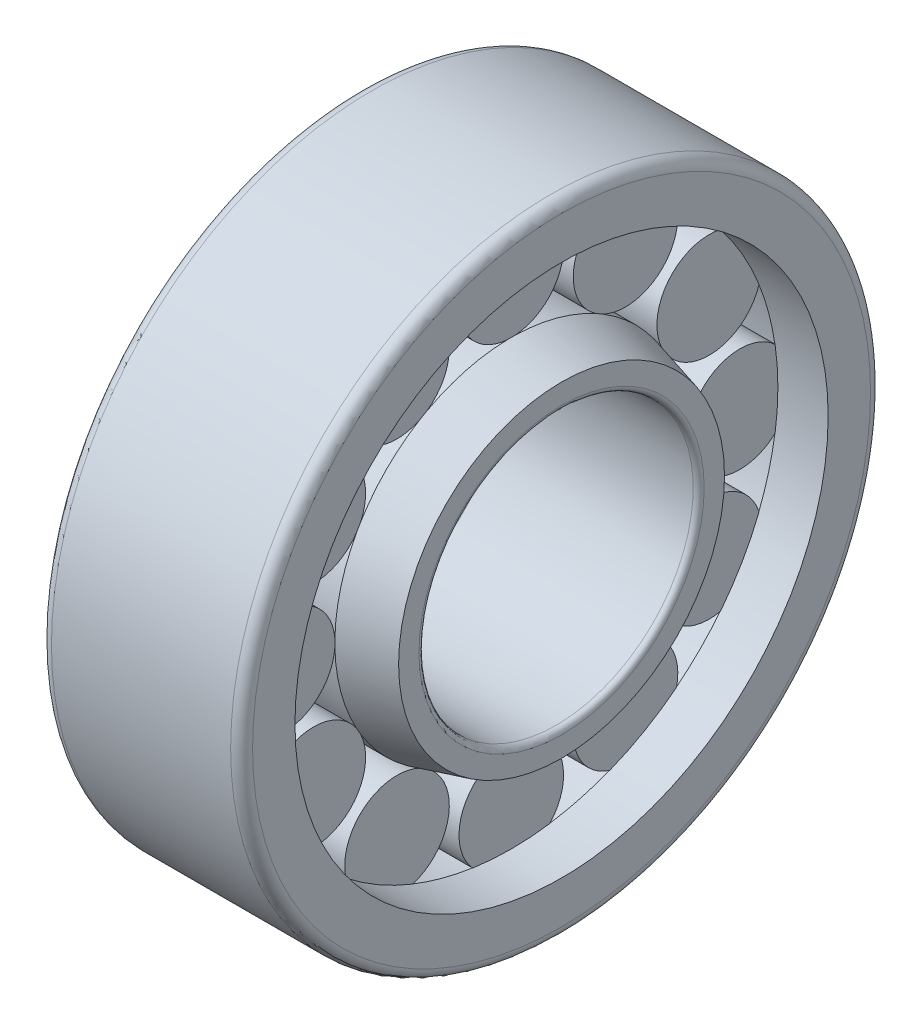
ISO-10303-21;
HEADER;
FILE_DESCRIPTION(('STEP AP214'),'2;1');
FILE_NAME('part.step','',(''),(''),'','','');
FILE_SCHEMA(('AUTOMOTIVE_DESIGN { 1 0 10303 214 1 1 1 1 }'));
ENDSEC;
DATA;
#1=APPLICATION_CONTEXT('core data for automotive mechanical design processes');
#2=APPLICATION_PROTOCOL_DEFINITION('international standard','automotive_design',2000,#1);
#3=PRODUCT_CONTEXT('',#1,'mechanical');
#4=PRODUCT('Part','Part','',(#3));
#5=PRODUCT_RELATED_PRODUCT_CATEGORY('part','',(#4));
#6=PRODUCT_DEFINITION_FORMATION('','',#4);
#7=PRODUCT_DEFINITION_CONTEXT('part definition',#1,'design');
#8=PRODUCT_DEFINITION('design','',#6,#7);
#9=PRODUCT_DEFINITION_SHAPE('','',#8);
#10=(LENGTH_UNIT() NAMED_UNIT(*) SI_UNIT(.MILLI.,.METRE.));
#11=(NAMED_UNIT(*) PLANE_ANGLE_UNIT() SI_UNIT($,.RADIAN.));
#12=(NAMED_UNIT(*) SI_UNIT($,.STERADIAN.) SOLID_ANGLE_UNIT());
#13=UNCERTAINTY_MEASURE_WITH_UNIT(LENGTH_MEASURE(1.E-05),#10,'distance_accuracy_value','');
#14=(GEOMETRIC_REPRESENTATION_CONTEXT(3) GLOBAL_UNCERTAINTY_ASSIGNED_CONTEXT((#13)) GLOBAL_UNIT_ASSIGNED_CONTEXT((#10,
#11,#12)) REPRESENTATION_CONTEXT('',''));
#15=CARTESIAN_POINT('',(0.,0.,0.));
#16=DIRECTION('',(0.,0.,1.));
#17=DIRECTION('',(1.,0.,0.));
#18=AXIS2_PLACEMENT_3D('',#15,#16,#17);
#19=CARTESIAN_POINT('',(-2.74,15.35,0.));
#20=DIRECTION('',(-1.,0.,0.));
#21=DIRECTION('',(0.,0.,1.));
#22=AXIS2_PLACEMENT_3D('',#19,#20,#21);
#23=PLANE('',#22);
#24=CARTESIAN_POINT('',(-2.74,0.,0.));
#25=DIRECTION('',(-1.,0.,0.));
#26=DIRECTION('',(0.,0.,1.));
#27=AXIS2_PLACEMENT_3D('',#24,#25,#26);
#28=CIRCLE('',#27,14.5825);
#29=CARTESIAN_POINT('',(-2.74,14.42878825,-2.1117234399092));
#30=VERTEX_POINT('',#29);
#31=CARTESIAN_POINT('',(-2.74,13.5515588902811,-5.3855879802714));
#32=VERTEX_POINT('',#31);
#33=EDGE_CURVE('E1080',#30,#32,#28,.T.);
#34=ORIENTED_EDGE('',*,*,#33,.T.);
#35=CARTESIAN_POINT('',(-2.74,10.8253175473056,-6.24999999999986));
#36=DIRECTION('',(-1.,0.,0.));
#37=DIRECTION('',(0.,0.,1.));
#38=AXIS2_PLACEMENT_3D('',#35,#36,#37);
#39=CIRCLE('',#38,2.86);
#40=CARTESIAN_POINT('',(-2.74,13.423906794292,-7.44454339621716));
#41=VERTEX_POINT('',#40);
#42=EDGE_CURVE('E56',#32,#41,#39,.T.);
#43=ORIENTED_EDGE('',*,*,#42,.T.);
#44=CARTESIAN_POINT('',(-2.74,0.,0.));
#45=DIRECTION('',(-1.,0.,0.));
#46=DIRECTION('',(0.,0.,1.));
#47=AXIS2_PLACEMENT_3D('',#44,#45,#46);
#48=CIRCLE('',#47,15.35);
#49=CARTESIAN_POINT('',(-2.74,15.347716,-0.264789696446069));
#50=VERTEX_POINT('',#49);
#51=EDGE_CURVE('E1085',#50,#41,#48,.T.);
#52=ORIENTED_EDGE('',*,*,#51,.F.);
#53=CARTESIAN_POINT('',(-2.74,12.5,0.));
#54=DIRECTION('',(-1.,0.,0.));
#55=DIRECTION('',(0.,0.,1.));
#56=AXIS2_PLACEMENT_3D('',#53,#54,#55);
#57=CIRCLE('',#56,2.86);
#58=EDGE_CURVE('E1141',#30,#50,#57,.F.);
#59=ORIENTED_EDGE('',*,*,#58,.F.);
#60=EDGE_LOOP('',(#34,#43,#52,#59));
#61=FACE_BOUND('',#60,.T.);
#62=ADVANCED_FACE('F33',(#61),#23,.F.);
#63=CARTESIAN_POINT('',(2.74,14.5825,0.));
#64=DIRECTION('',(1.,0.,0.));
#65=DIRECTION('',(0.,0.,-1.));
#66=AXIS2_PLACEMENT_3D('',#63,#64,#65);
#67=PLANE('',#66);
#68=CARTESIAN_POINT('',(2.74,0.,0.));
#69=DIRECTION('',(-1.,0.,0.));
#70=DIRECTION('',(0.,0.,1.));
#71=AXIS2_PLACEMENT_3D('',#68,#69,#70);
#72=CIRCLE('',#71,14.5825);
#73=CARTESIAN_POINT('',(2.74,11.4398354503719,-9.04320026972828));
#74=VERTEX_POINT('',#73);
#75=CARTESIAN_POINT('',(2.74,9.04320026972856,-11.4398354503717));
#76=VERTEX_POINT('',#75);
#77=EDGE_CURVE('E1097',#74,#76,#72,.T.);
#78=ORIENTED_EDGE('',*,*,#77,.F.);
#79=CARTESIAN_POINT('',(2.74,10.8253175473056,-6.24999999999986));
#80=DIRECTION('',(1.,0.,0.));
#81=DIRECTION('',(0.,0.,-1.));
#82=AXIS2_PLACEMENT_3D('',#79,#80,#81);
#83=CIRCLE('',#82,2.86);
#84=CARTESIAN_POINT('',(2.74,13.159117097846,-7.9031726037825));
#85=VERTEX_POINT('',#84);
#86=EDGE_CURVE('E660',#74,#85,#83,.T.);
#87=ORIENTED_EDGE('',*,*,#86,.T.);
#88=CARTESIAN_POINT('',(2.74,0.,0.));
#89=DIRECTION('',(-1.,0.,0.));
#90=DIRECTION('',(0.,0.,1.));
#91=AXIS2_PLACEMENT_3D('',#88,#89,#90);
#92=CIRCLE('',#91,15.35);
#93=CARTESIAN_POINT('',(2.74,7.90317260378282,-13.1591170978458));
#94=VERTEX_POINT('',#93);
#95=EDGE_CURVE('E1094',#85,#94,#92,.T.);
#96=ORIENTED_EDGE('',*,*,#95,.T.);
#97=CARTESIAN_POINT('',(2.74,6.25000000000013,-10.8253175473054));
#98=DIRECTION('',(1.,0.,0.));
#99=DIRECTION('',(0.,0.,-1.));
#100=AXIS2_PLACEMENT_3D('',#97,#98,#99);
#101=CIRCLE('',#100,2.86);
#102=EDGE_CURVE('E691',#94,#76,#101,.T.);
#103=ORIENTED_EDGE('',*,*,#102,.T.);
#104=EDGE_LOOP('',(#78,#87,#96,#103));
#105=FACE_BOUND('',#104,.T.);
#106=ADVANCED_FACE('F1340',(#105),#67,.F.);
#107=CARTESIAN_POINT('',(-10.1378712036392,0.,0.));
#108=DIRECTION('',(-1.,0.,0.));
#109=DIRECTION('',(0.,0.,1.));
#110=AXIS2_PLACEMENT_3D('',#107,#108,#109);
#111=CYLINDRICAL_SURFACE('',#110,9.65);
#112=CARTESIAN_POINT('',(-2.75,0.,0.));
#113=DIRECTION('',(-1.,0.,0.));
#114=DIRECTION('',(0.,0.,1.));
#115=AXIS2_PLACEMENT_3D('',#112,#113,#114);
#116=CIRCLE('',#115,9.65);
#117=CARTESIAN_POINT('',(-2.75,8.25019573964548,-5.00567380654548));
#118=VERTEX_POINT('',#117);
#119=CARTESIAN_POINT('',(-2.75,5.00567380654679,-8.25019573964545));
#120=VERTEX_POINT('',#119);
#121=EDGE_CURVE('E1129',#118,#120,#116,.T.);
#122=ORIENTED_EDGE('',*,*,#121,.F.);
#123=DIRECTION('',(-1.,0.,0.));
#124=VECTOR('',#123,1.);
#125=CARTESIAN_POINT('',(0.,8.25019573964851,-5.00567380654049));
#126=LINE('',#125,#124);
#127=CARTESIAN_POINT('',(2.75,8.25019573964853,-5.00567380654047));
#128=VERTEX_POINT('',#127);
#129=EDGE_CURVE('E668',#118,#128,#126,.F.);
#130=ORIENTED_EDGE('',*,*,#129,.T.);
#131=CARTESIAN_POINT('',(2.75,0.,0.));
#132=DIRECTION('',(-1.,0.,0.));
#133=DIRECTION('',(0.,0.,1.));
#134=AXIS2_PLACEMENT_3D('',#131,#132,#133);
#135=CIRCLE('',#134,9.65);
#136=CARTESIAN_POINT('',(2.75,5.00567380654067,-8.2501957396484));
#137=VERTEX_POINT('',#136);
#138=EDGE_CURVE('E1135',#128,#137,#135,.T.);
#139=ORIENTED_EDGE('',*,*,#138,.T.);
#140=DIRECTION('',(-1.,0.,0.));
#141=VECTOR('',#140,1.);
#142=CARTESIAN_POINT('',(0.,5.00567380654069,-8.25019573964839));
#143=LINE('',#142,#141);
#144=EDGE_CURVE('E704',#137,#120,#143,.T.);
#145=ORIENTED_EDGE('',*,*,#144,.T.);
#146=EDGE_LOOP('',(#122,#130,#139,#145));
#147=FACE_BOUND('',#146,.T.);
#148=ADVANCED_FACE('F1336',(#147),#111,.T.);
#149=CARTESIAN_POINT('',(-9.08221319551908,0.,0.));
#150=DIRECTION('',(-1.,0.,0.));
#151=DIRECTION('',(0.,0.,1.));
#152=AXIS2_PLACEMENT_3D('',#149,#150,#151);
#153=CYLINDRICAL_SURFACE('',#152,15.35);
#154=ORIENTED_EDGE('',*,*,#95,.F.);
#155=DIRECTION('',(-1.,0.,0.));
#156=VECTOR('',#155,1.);
#157=CARTESIAN_POINT('',(0.,13.159117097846,-7.9031726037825));
#158=LINE('',#157,#156);
#159=CARTESIAN_POINT('',(-2.74,13.159117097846,-7.9031726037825));
#160=VERTEX_POINT('',#159);
#161=EDGE_CURVE('E656',#85,#160,#158,.T.);
#162=ORIENTED_EDGE('',*,*,#161,.T.);
#163=CARTESIAN_POINT('',(-2.74,7.90317260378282,-13.1591170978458));
#164=VERTEX_POINT('',#163);
#165=EDGE_CURVE('E1089',#160,#164,#48,.T.);
#166=ORIENTED_EDGE('',*,*,#165,.T.);
#167=DIRECTION('',(-1.,0.,0.));
#168=VECTOR('',#167,1.);
#169=CARTESIAN_POINT('',(0.,7.90317260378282,-13.1591170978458));
#170=LINE('',#169,#168);
#171=EDGE_CURVE('E687',#164,#94,#170,.F.);
#172=ORIENTED_EDGE('',*,*,#171,.T.);
#173=EDGE_LOOP('',(#154,#162,#166,#172));
#174=FACE_BOUND('',#173,.T.);
#175=ADVANCED_FACE('F1355',(#174),#153,.F.);
#176=ORIENTED_EDGE('',*,*,#165,.F.);
#177=CARTESIAN_POINT('',(-2.74,11.4398354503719,-9.04320026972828));
#178=VERTEX_POINT('',#177);
#179=EDGE_CURVE('E652',#160,#178,#39,.T.);
#180=ORIENTED_EDGE('',*,*,#179,.T.);
#181=CARTESIAN_POINT('',(-2.74,9.04320026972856,-11.4398354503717));
#182=VERTEX_POINT('',#181);
#183=EDGE_CURVE('E1084',#178,#182,#28,.T.);
#184=ORIENTED_EDGE('',*,*,#183,.T.);
#185=CARTESIAN_POINT('',(-2.74,6.25000000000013,-10.8253175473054));
#186=DIRECTION('',(-1.,0.,0.));
#187=DIRECTION('',(0.,0.,1.));
#188=AXIS2_PLACEMENT_3D('',#185,#186,#187);
#189=CIRCLE('',#188,2.86);
#190=EDGE_CURVE('E684',#182,#164,#189,.T.);
#191=ORIENTED_EDGE('',*,*,#190,.T.);
#192=EDGE_LOOP('',(#176,#180,#184,#191));
#193=FACE_BOUND('',#192,.T.);
#194=ADVANCED_FACE('F1343',(#193),#23,.F.);
#195=CARTESIAN_POINT('',(2.74,15.347716,-0.264789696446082));
#196=VERTEX_POINT('',#195);
#197=CARTESIAN_POINT('',(2.74,13.423906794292,-7.44454339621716));
#198=VERTEX_POINT('',#197);
#199=EDGE_CURVE('E1090',#196,#198,#92,.T.);
#200=ORIENTED_EDGE('',*,*,#199,.T.);
#201=CARTESIAN_POINT('',(2.74,13.5515588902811,-5.3855879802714));
#202=VERTEX_POINT('',#201);
#203=EDGE_CURVE('E653',#198,#202,#83,.T.);
#204=ORIENTED_EDGE('',*,*,#203,.T.);
#205=CARTESIAN_POINT('',(2.74,14.42878825,-2.1117234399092));
#206=VERTEX_POINT('',#205);
#207=EDGE_CURVE('E651',#206,#202,#72,.T.);
#208=ORIENTED_EDGE('',*,*,#207,.F.);
#209=CARTESIAN_POINT('',(2.74,12.5,0.));
#210=DIRECTION('',(1.,0.,0.));
#211=DIRECTION('',(0.,0.,-1.));
#212=AXIS2_PLACEMENT_3D('',#209,#210,#211);
#213=CIRCLE('',#212,2.86);
#214=EDGE_CURVE('E1148',#196,#206,#213,.F.);
#215=ORIENTED_EDGE('',*,*,#214,.F.);
#216=EDGE_LOOP('',(#200,#204,#208,#215));
#217=FACE_BOUND('',#216,.T.);
#218=ADVANCED_FACE('F1350',(#217),#67,.F.);
#219=CARTESIAN_POINT('',(-2.75,4.64204219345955,-8.46013854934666));
#220=VERTEX_POINT('',#219);
#221=CARTESIAN_POINT('',(-2.75,0.209942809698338,-9.647716));
#222=VERTEX_POINT('',#221);
#223=EDGE_CURVE('E1598',#220,#222,#116,.T.);
#224=ORIENTED_EDGE('',*,*,#223,.F.);
#225=DIRECTION('',(-1.,0.,0.));
#226=VECTOR('',#225,1.);
#227=CARTESIAN_POINT('',(0.,4.64204219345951,-8.46013854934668));
#228=LINE('',#227,#226);
#229=CARTESIAN_POINT('',(2.75,4.64204219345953,-8.46013854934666));
#230=VERTEX_POINT('',#229);
#231=EDGE_CURVE('E707',#220,#230,#228,.F.);
#232=ORIENTED_EDGE('',*,*,#231,.T.);
#233=CARTESIAN_POINT('',(2.75,0.209942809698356,-9.647716));
#234=VERTEX_POINT('',#233);
#235=EDGE_CURVE('E1607',#230,#234,#135,.T.);
#236=ORIENTED_EDGE('',*,*,#235,.T.);
#237=DIRECTION('',(-1.,0.,0.));
#238=VECTOR('',#237,1.);
#239=CARTESIAN_POINT('',(0.,0.20994280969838,-9.647716));
#240=LINE('',#239,#238);
#241=EDGE_CURVE('E744',#234,#222,#240,.T.);
#242=ORIENTED_EDGE('',*,*,#241,.T.);
#243=EDGE_LOOP('',(#224,#232,#236,#242));
#244=FACE_BOUND('',#243,.T.);
#245=ADVANCED_FACE('F1487',(#244),#111,.T.);
#246=CARTESIAN_POINT('',(2.74,7.44454339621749,-13.4239067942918));
#247=VERTEX_POINT('',#246);
#248=CARTESIAN_POINT('',(2.74,0.264789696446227,-15.347716));
#249=VERTEX_POINT('',#248);
#250=EDGE_CURVE('E1562',#247,#249,#92,.T.);
#251=ORIENTED_EDGE('',*,*,#250,.F.);
#252=DIRECTION('',(-1.,0.,0.));
#253=VECTOR('',#252,1.);
#254=CARTESIAN_POINT('',(0.,7.44454339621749,-13.4239067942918));
#255=LINE('',#254,#253);
#256=CARTESIAN_POINT('',(-2.74,7.44454339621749,-13.4239067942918));
#257=VERTEX_POINT('',#256);
#258=EDGE_CURVE('E698',#247,#257,#255,.T.);
#259=ORIENTED_EDGE('',*,*,#258,.T.);
#260=CARTESIAN_POINT('',(-2.74,0.26478969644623,-15.347716));
#261=VERTEX_POINT('',#260);
#262=EDGE_CURVE('E1491',#257,#261,#48,.T.);
#263=ORIENTED_EDGE('',*,*,#262,.T.);
#264=DIRECTION('',(-1.,0.,0.));
#265=VECTOR('',#264,1.);
#266=CARTESIAN_POINT('',(0.,0.26478969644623,-15.347716));
#267=LINE('',#266,#265);
#268=EDGE_CURVE('E727',#261,#249,#267,.F.);
#269=ORIENTED_EDGE('',*,*,#268,.T.);
#270=EDGE_LOOP('',(#251,#259,#263,#269));
#271=FACE_BOUND('',#270,.T.);
#272=ADVANCED_FACE('F1478',(#271),#153,.F.);
#273=ORIENTED_EDGE('',*,*,#262,.F.);
#274=CARTESIAN_POINT('',(-2.74,5.38558798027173,-13.5515588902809));
#275=VERTEX_POINT('',#274);
#276=EDGE_CURVE('E688',#257,#275,#189,.T.);
#277=ORIENTED_EDGE('',*,*,#276,.T.);
#278=CARTESIAN_POINT('',(-2.74,2.11172343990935,-14.42878825));
#279=VERTEX_POINT('',#278);
#280=EDGE_CURVE('E1790',#275,#279,#28,.T.);
#281=ORIENTED_EDGE('',*,*,#280,.T.);
#282=CARTESIAN_POINT('',(-2.74,1.30930550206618E-13,-12.5));
#283=DIRECTION('',(-1.,0.,0.));
#284=DIRECTION('',(0.,0.,1.));
#285=AXIS2_PLACEMENT_3D('',#282,#283,#284);
#286=CIRCLE('',#285,2.86);
#287=EDGE_CURVE('E724',#279,#261,#286,.T.);
#288=ORIENTED_EDGE('',*,*,#287,.T.);
#289=EDGE_LOOP('',(#273,#277,#281,#288));
#290=FACE_BOUND('',#289,.T.);
#291=ADVANCED_FACE('F1357',(#290),#23,.F.);
#292=CARTESIAN_POINT('',(-2.75,-0.209942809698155,-9.647716));
#293=VERTEX_POINT('',#292);
#294=CARTESIAN_POINT('',(-2.75,-4.64204219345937,-8.46013854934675));
#295=VERTEX_POINT('',#294);
#296=EDGE_CURVE('E1602',#293,#295,#116,.T.);
#297=ORIENTED_EDGE('',*,*,#296,.F.);
#298=DIRECTION('',(-1.,0.,0.));
#299=VECTOR('',#298,1.);
#300=CARTESIAN_POINT('',(0.,-0.209942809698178,-9.647716));
#301=LINE('',#300,#299);
#302=CARTESIAN_POINT('',(2.75,-0.209942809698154,-9.647716));
#303=VERTEX_POINT('',#302);
#304=EDGE_CURVE('E747',#293,#303,#301,.F.);
#305=ORIENTED_EDGE('',*,*,#304,.T.);
#306=CARTESIAN_POINT('',(2.75,-4.64204219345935,-8.46013854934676));
#307=VERTEX_POINT('',#306);
#308=EDGE_CURVE('E1609',#303,#307,#135,.T.);
#309=ORIENTED_EDGE('',*,*,#308,.T.);
#310=DIRECTION('',(-1.,0.,0.));
#311=VECTOR('',#310,1.);
#312=CARTESIAN_POINT('',(0.,-4.64204219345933,-8.46013854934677));
#313=LINE('',#312,#311);
#314=EDGE_CURVE('E784',#307,#295,#313,.T.);
#315=ORIENTED_EDGE('',*,*,#314,.T.);
#316=EDGE_LOOP('',(#297,#305,#309,#315));
#317=FACE_BOUND('',#316,.T.);
#318=ADVANCED_FACE('F1475',(#317),#111,.T.);
#319=CARTESIAN_POINT('',(2.74,5.38558798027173,-13.551558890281));
#320=VERTEX_POINT('',#319);
#321=CARTESIAN_POINT('',(2.74,2.11172343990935,-14.42878825));
#322=VERTEX_POINT('',#321);
#323=EDGE_CURVE('E1657',#320,#322,#72,.T.);
#324=ORIENTED_EDGE('',*,*,#323,.F.);
#325=EDGE_CURVE('E695',#320,#247,#101,.T.);
#326=ORIENTED_EDGE('',*,*,#325,.T.);
#327=ORIENTED_EDGE('',*,*,#250,.T.);
#328=CARTESIAN_POINT('',(2.74,1.30930550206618E-13,-12.5));
#329=DIRECTION('',(1.,0.,0.));
#330=DIRECTION('',(0.,0.,-1.));
#331=AXIS2_PLACEMENT_3D('',#328,#329,#330);
#332=CIRCLE('',#331,2.86);
#333=EDGE_CURVE('E731',#249,#322,#332,.T.);
#334=ORIENTED_EDGE('',*,*,#333,.T.);
#335=EDGE_LOOP('',(#324,#326,#327,#334));
#336=FACE_BOUND('',#335,.T.);
#337=ADVANCED_FACE('F1476',(#336),#67,.F.);
#338=CARTESIAN_POINT('',(2.74,-0.264789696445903,-15.347716));
#339=VERTEX_POINT('',#338);
#340=CARTESIAN_POINT('',(2.74,-7.44454339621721,-13.423906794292));
#341=VERTEX_POINT('',#340);
#342=EDGE_CURVE('E1557',#339,#341,#92,.T.);
#343=ORIENTED_EDGE('',*,*,#342,.F.);
#344=DIRECTION('',(-1.,0.,0.));
#345=VECTOR('',#344,1.);
#346=CARTESIAN_POINT('',(0.,-0.264789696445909,-15.347716));
#347=LINE('',#346,#345);
#348=CARTESIAN_POINT('',(-2.74,-0.264789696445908,-15.347716));
#349=VERTEX_POINT('',#348);
#350=EDGE_CURVE('E738',#339,#349,#347,.T.);
#351=ORIENTED_EDGE('',*,*,#350,.T.);
#352=CARTESIAN_POINT('',(-2.74,-7.44454339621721,-13.423906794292));
#353=VERTEX_POINT('',#352);
#354=EDGE_CURVE('E1495',#349,#353,#48,.T.);
#355=ORIENTED_EDGE('',*,*,#354,.T.);
#356=DIRECTION('',(-1.,0.,0.));
#357=VECTOR('',#356,1.);
#358=CARTESIAN_POINT('',(0.,-7.44454339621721,-13.423906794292));
#359=LINE('',#358,#357);
#360=EDGE_CURVE('E767',#353,#341,#359,.F.);
#361=ORIENTED_EDGE('',*,*,#360,.T.);
#362=EDGE_LOOP('',(#343,#351,#355,#361));
#363=FACE_BOUND('',#362,.T.);
#364=ADVANCED_FACE('F1466',(#363),#153,.F.);
#365=ORIENTED_EDGE('',*,*,#354,.F.);
#366=CARTESIAN_POINT('',(-2.74,-2.11172343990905,-14.42878825));
#367=VERTEX_POINT('',#366);
#368=EDGE_CURVE('E728',#349,#367,#286,.T.);
#369=ORIENTED_EDGE('',*,*,#368,.T.);
#370=CARTESIAN_POINT('',(-2.74,-5.38558798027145,-13.5515588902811));
#371=VERTEX_POINT('',#370);
#372=EDGE_CURVE('E1859',#367,#371,#28,.T.);
#373=ORIENTED_EDGE('',*,*,#372,.T.);
#374=CARTESIAN_POINT('',(-2.74,-6.2499999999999,-10.8253175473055));
#375=DIRECTION('',(-1.,0.,0.));
#376=DIRECTION('',(0.,0.,1.));
#377=AXIS2_PLACEMENT_3D('',#374,#375,#376);
#378=CIRCLE('',#377,2.86);
#379=EDGE_CURVE('E764',#371,#353,#378,.T.);
#380=ORIENTED_EDGE('',*,*,#379,.T.);
#381=EDGE_LOOP('',(#365,#369,#373,#380));
#382=FACE_BOUND('',#381,.T.);
#383=ADVANCED_FACE('F1457',(#382),#23,.F.);
#384=CARTESIAN_POINT('',(-2.75,-5.00567380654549,-8.25019573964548));
#385=VERTEX_POINT('',#384);
#386=CARTESIAN_POINT('',(-2.75,-8.25019573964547,-5.00567380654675));
#387=VERTEX_POINT('',#386);
#388=EDGE_CURVE('E1760',#385,#387,#116,.T.);
#389=ORIENTED_EDGE('',*,*,#388,.F.);
#390=DIRECTION('',(-1.,0.,0.));
#391=VECTOR('',#390,1.);
#392=CARTESIAN_POINT('',(0.,-5.00567380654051,-8.2501957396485));
#393=LINE('',#392,#391);
#394=CARTESIAN_POINT('',(2.75,-5.00567380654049,-8.25019573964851));
#395=VERTEX_POINT('',#394);
#396=EDGE_CURVE('E787',#385,#395,#393,.F.);
#397=ORIENTED_EDGE('',*,*,#396,.T.);
#398=CARTESIAN_POINT('',(2.75,-8.25019573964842,-5.00567380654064));
#399=VERTEX_POINT('',#398);
#400=EDGE_CURVE('E1610',#395,#399,#135,.T.);
#401=ORIENTED_EDGE('',*,*,#400,.T.);
#402=DIRECTION('',(-1.,0.,0.));
#403=VECTOR('',#402,1.);
#404=CARTESIAN_POINT('',(0.,-8.25019573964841,-5.00567380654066));
#405=LINE('',#404,#403);
#406=EDGE_CURVE('E824',#399,#387,#405,.T.);
#407=ORIENTED_EDGE('',*,*,#406,.T.);
#408=EDGE_LOOP('',(#389,#397,#401,#407));
#409=FACE_BOUND('',#408,.T.);
#410=ADVANCED_FACE('F1463',(#409),#111,.T.);
#411=CARTESIAN_POINT('',(2.74,-9.04320026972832,-11.4398354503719));
#412=VERTEX_POINT('',#411);
#413=CARTESIAN_POINT('',(2.74,-11.4398354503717,-9.04320026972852));
#414=VERTEX_POINT('',#413);
#415=EDGE_CURVE('E1661',#412,#414,#72,.T.);
#416=ORIENTED_EDGE('',*,*,#415,.F.);
#417=CARTESIAN_POINT('',(2.74,-6.2499999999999,-10.8253175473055));
#418=DIRECTION('',(1.,0.,0.));
#419=DIRECTION('',(0.,0.,-1.));
#420=AXIS2_PLACEMENT_3D('',#417,#418,#419);
#421=CIRCLE('',#420,2.86);
#422=CARTESIAN_POINT('',(2.74,-7.90317260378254,-13.1591170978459));
#423=VERTEX_POINT('',#422);
#424=EDGE_CURVE('E775',#412,#423,#421,.T.);
#425=ORIENTED_EDGE('',*,*,#424,.T.);
#426=CARTESIAN_POINT('',(2.74,-13.1591170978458,-7.90317260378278));
#427=VERTEX_POINT('',#426);
#428=EDGE_CURVE('E1552',#423,#427,#92,.T.);
#429=ORIENTED_EDGE('',*,*,#428,.T.);
#430=CARTESIAN_POINT('',(2.74,-10.8253175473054,-6.25000000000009));
#431=DIRECTION('',(1.,0.,0.));
#432=DIRECTION('',(0.,0.,-1.));
#433=AXIS2_PLACEMENT_3D('',#430,#431,#432);
#434=CIRCLE('',#433,2.86);
#435=EDGE_CURVE('E811',#427,#414,#434,.T.);
#436=ORIENTED_EDGE('',*,*,#435,.T.);
#437=EDGE_LOOP('',(#416,#425,#429,#436));
#438=FACE_BOUND('',#437,.T.);
#439=ADVANCED_FACE('F1464',(#438),#67,.F.);
#440=ORIENTED_EDGE('',*,*,#428,.F.);
#441=DIRECTION('',(-1.,0.,0.));
#442=VECTOR('',#441,1.);
#443=CARTESIAN_POINT('',(0.,-7.90317260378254,-13.1591170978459));
#444=LINE('',#443,#442);
#445=CARTESIAN_POINT('',(-2.74,-7.90317260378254,-13.1591170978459));
#446=VERTEX_POINT('',#445);
#447=EDGE_CURVE('E778',#423,#446,#444,.T.);
#448=ORIENTED_EDGE('',*,*,#447,.T.);
#449=CARTESIAN_POINT('',(-2.74,-13.1591170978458,-7.90317260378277));
#450=VERTEX_POINT('',#449);
#451=EDGE_CURVE('E1496',#446,#450,#48,.T.);
#452=ORIENTED_EDGE('',*,*,#451,.T.);
#453=DIRECTION('',(-1.,0.,0.));
#454=VECTOR('',#453,1.);
#455=CARTESIAN_POINT('',(0.,-13.1591170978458,-7.90317260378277));
#456=LINE('',#455,#454);
#457=EDGE_CURVE('E807',#450,#427,#456,.F.);
#458=ORIENTED_EDGE('',*,*,#457,.T.);
#459=EDGE_LOOP('',(#440,#448,#452,#458));
#460=FACE_BOUND('',#459,.T.);
#461=ADVANCED_FACE('F1453',(#460),#153,.F.);
#462=ORIENTED_EDGE('',*,*,#451,.F.);
#463=CARTESIAN_POINT('',(-2.74,-9.04320026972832,-11.4398354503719));
#464=VERTEX_POINT('',#463);
#465=EDGE_CURVE('E768',#446,#464,#378,.T.);
#466=ORIENTED_EDGE('',*,*,#465,.T.);
#467=CARTESIAN_POINT('',(-2.74,-11.4398354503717,-9.04320026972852));
#468=VERTEX_POINT('',#467);
#469=EDGE_CURVE('E1809',#464,#468,#28,.T.);
#470=ORIENTED_EDGE('',*,*,#469,.T.);
#471=CARTESIAN_POINT('',(-2.74,-10.8253175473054,-6.25000000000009));
#472=DIRECTION('',(-1.,0.,0.));
#473=DIRECTION('',(0.,0.,1.));
#474=AXIS2_PLACEMENT_3D('',#471,#472,#473);
#475=CIRCLE('',#474,2.86);
#476=EDGE_CURVE('E804',#468,#450,#475,.T.);
#477=ORIENTED_EDGE('',*,*,#476,.T.);
#478=EDGE_LOOP('',(#462,#466,#470,#477));
#479=FACE_BOUND('',#478,.T.);
#480=ADVANCED_FACE('F1444',(#479),#23,.F.);
#481=CARTESIAN_POINT('',(-2.75,-8.46013854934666,-4.64204219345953));
#482=VERTEX_POINT('',#481);
#483=CARTESIAN_POINT('',(-2.75,-9.647716,-0.209942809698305));
#484=VERTEX_POINT('',#483);
#485=EDGE_CURVE('E1748',#482,#484,#116,.T.);
#486=ORIENTED_EDGE('',*,*,#485,.F.);
#487=DIRECTION('',(-1.,0.,0.));
#488=VECTOR('',#487,1.);
#489=CARTESIAN_POINT('',(0.,-8.46013854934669,-4.64204219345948));
#490=LINE('',#489,#488);
#491=CARTESIAN_POINT('',(2.75,-8.46013854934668,-4.6420421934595));
#492=VERTEX_POINT('',#491);
#493=EDGE_CURVE('E827',#482,#492,#490,.F.);
#494=ORIENTED_EDGE('',*,*,#493,.T.);
#495=CARTESIAN_POINT('',(2.75,-9.647716,-0.209942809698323));
#496=VERTEX_POINT('',#495);
#497=EDGE_CURVE('E1613',#492,#496,#135,.T.);
#498=ORIENTED_EDGE('',*,*,#497,.T.);
#499=DIRECTION('',(-1.,0.,0.));
#500=VECTOR('',#499,1.);
#501=CARTESIAN_POINT('',(0.,-9.647716,-0.209942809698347));
#502=LINE('',#501,#500);
#503=EDGE_CURVE('E864',#496,#484,#502,.T.);
#504=ORIENTED_EDGE('',*,*,#503,.T.);
#505=EDGE_LOOP('',(#486,#494,#498,#504));
#506=FACE_BOUND('',#505,.T.);
#507=ADVANCED_FACE('F1450',(#506),#111,.T.);
#508=CARTESIAN_POINT('',(2.74,-13.551558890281,-5.38558798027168));
#509=VERTEX_POINT('',#508);
#510=CARTESIAN_POINT('',(2.74,-14.42878825,-2.1117234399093));
#511=VERTEX_POINT('',#510);
#512=EDGE_CURVE('E1664',#509,#511,#72,.T.);
#513=ORIENTED_EDGE('',*,*,#512,.F.);
#514=CARTESIAN_POINT('',(2.74,-13.4239067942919,-7.44454339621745));
#515=VERTEX_POINT('',#514);
#516=EDGE_CURVE('E815',#509,#515,#434,.T.);
#517=ORIENTED_EDGE('',*,*,#516,.T.);
#518=CARTESIAN_POINT('',(2.74,-15.347716,-0.264789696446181));
#519=VERTEX_POINT('',#518);
#520=EDGE_CURVE('E1547',#515,#519,#92,.T.);
#521=ORIENTED_EDGE('',*,*,#520,.T.);
#522=CARTESIAN_POINT('',(2.74,-12.5,0.));
#523=DIRECTION('',(1.,0.,0.));
#524=DIRECTION('',(0.,0.,-1.));
#525=AXIS2_PLACEMENT_3D('',#522,#523,#524);
#526=CIRCLE('',#525,2.86);
#527=EDGE_CURVE('E851',#519,#511,#526,.T.);
#528=ORIENTED_EDGE('',*,*,#527,.T.);
#529=EDGE_LOOP('',(#513,#517,#521,#528));
#530=FACE_BOUND('',#529,.T.);
#531=ADVANCED_FACE('F1451',(#530),#67,.F.);
#532=ORIENTED_EDGE('',*,*,#520,.F.);
#533=DIRECTION('',(-1.,0.,0.));
#534=VECTOR('',#533,1.);
#535=CARTESIAN_POINT('',(0.,-13.4239067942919,-7.44454339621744));
#536=LINE('',#535,#534);
#537=CARTESIAN_POINT('',(-2.74,-13.4239067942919,-7.44454339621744));
#538=VERTEX_POINT('',#537);
#539=EDGE_CURVE('E818',#515,#538,#536,.T.);
#540=ORIENTED_EDGE('',*,*,#539,.T.);
#541=CARTESIAN_POINT('',(-2.74,-15.347716,-0.264789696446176));
#542=VERTEX_POINT('',#541);
#543=EDGE_CURVE('E1498',#538,#542,#48,.T.);
#544=ORIENTED_EDGE('',*,*,#543,.T.);
#545=DIRECTION('',(-1.,0.,0.));
#546=VECTOR('',#545,1.);
#547=CARTESIAN_POINT('',(0.,-15.347716,-0.264789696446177));
#548=LINE('',#547,#546);
#549=EDGE_CURVE('E847',#542,#519,#548,.F.);
#550=ORIENTED_EDGE('',*,*,#549,.T.);
#551=EDGE_LOOP('',(#532,#540,#544,#550));
#552=FACE_BOUND('',#551,.T.);
#553=ADVANCED_FACE('F1440',(#552),#153,.F.);
#554=ORIENTED_EDGE('',*,*,#543,.F.);
#555=CARTESIAN_POINT('',(-2.74,-13.551558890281,-5.38558798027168));
#556=VERTEX_POINT('',#555);
#557=EDGE_CURVE('E808',#538,#556,#475,.T.);
#558=ORIENTED_EDGE('',*,*,#557,.T.);
#559=CARTESIAN_POINT('',(-2.74,-14.42878825,-2.1117234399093));
#560=VERTEX_POINT('',#559);
#561=EDGE_CURVE('E1818',#556,#560,#28,.T.);
#562=ORIENTED_EDGE('',*,*,#561,.T.);
#563=CARTESIAN_POINT('',(-2.74,-12.5,0.));
#564=DIRECTION('',(-1.,0.,0.));
#565=DIRECTION('',(0.,0.,1.));
#566=AXIS2_PLACEMENT_3D('',#563,#564,#565);
#567=CIRCLE('',#566,2.86);
#568=EDGE_CURVE('E844',#560,#542,#567,.T.);
#569=ORIENTED_EDGE('',*,*,#568,.T.);
#570=EDGE_LOOP('',(#554,#558,#562,#569));
#571=FACE_BOUND('',#570,.T.);
#572=ADVANCED_FACE('F1431',(#571),#23,.F.);
#573=CARTESIAN_POINT('',(-2.75,-9.647716,0.209942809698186));
#574=VERTEX_POINT('',#573);
#575=CARTESIAN_POINT('',(-2.75,-8.46013854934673,4.6420421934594));
#576=VERTEX_POINT('',#575);
#577=EDGE_CURVE('E1736',#574,#576,#116,.T.);
#578=ORIENTED_EDGE('',*,*,#577,.F.);
#579=DIRECTION('',(-1.,0.,0.));
#580=VECTOR('',#579,1.);
#581=CARTESIAN_POINT('',(0.,-9.647716,0.209942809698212));
#582=LINE('',#581,#580);
#583=CARTESIAN_POINT('',(2.75,-9.647716,0.209942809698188));
#584=VERTEX_POINT('',#583);
#585=EDGE_CURVE('E867',#574,#584,#582,.F.);
#586=ORIENTED_EDGE('',*,*,#585,.T.);
#587=CARTESIAN_POINT('',(2.75,-8.46013854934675,4.64204219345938));
#588=VERTEX_POINT('',#587);
#589=EDGE_CURVE('E1616',#584,#588,#135,.T.);
#590=ORIENTED_EDGE('',*,*,#589,.T.);
#591=DIRECTION('',(-1.,0.,0.));
#592=VECTOR('',#591,1.);
#593=CARTESIAN_POINT('',(0.,-8.46013854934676,4.64204219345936));
#594=LINE('',#593,#592);
#595=EDGE_CURVE('E904',#588,#576,#594,.T.);
#596=ORIENTED_EDGE('',*,*,#595,.T.);
#597=EDGE_LOOP('',(#578,#586,#590,#596));
#598=FACE_BOUND('',#597,.T.);
#599=ADVANCED_FACE('F1437',(#598),#111,.T.);
#600=CARTESIAN_POINT('',(2.74,-14.42878825,2.1117234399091));
#601=VERTEX_POINT('',#600);
#602=CARTESIAN_POINT('',(2.74,-13.551558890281,5.38558798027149));
#603=VERTEX_POINT('',#602);
#604=EDGE_CURVE('E1667',#601,#603,#72,.T.);
#605=ORIENTED_EDGE('',*,*,#604,.F.);
#606=CARTESIAN_POINT('',(2.74,-15.347716,0.264789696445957));
#607=VERTEX_POINT('',#606);
#608=EDGE_CURVE('E855',#601,#607,#526,.T.);
#609=ORIENTED_EDGE('',*,*,#608,.T.);
#610=CARTESIAN_POINT('',(2.74,-13.423906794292,7.44454339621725));
#611=VERTEX_POINT('',#610);
#612=EDGE_CURVE('E1542',#607,#611,#92,.T.);
#613=ORIENTED_EDGE('',*,*,#612,.T.);
#614=CARTESIAN_POINT('',(2.74,-10.8253175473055,6.24999999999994));
#615=DIRECTION('',(1.,0.,0.));
#616=DIRECTION('',(0.,0.,-1.));
#617=AXIS2_PLACEMENT_3D('',#614,#615,#616);
#618=CIRCLE('',#617,2.86);
#619=EDGE_CURVE('E891',#611,#603,#618,.T.);
#620=ORIENTED_EDGE('',*,*,#619,.T.);
#621=EDGE_LOOP('',(#605,#609,#613,#620));
#622=FACE_BOUND('',#621,.T.);
#623=ADVANCED_FACE('F1438',(#622),#67,.F.);
#624=ORIENTED_EDGE('',*,*,#612,.F.);
#625=DIRECTION('',(-1.,0.,0.));
#626=VECTOR('',#625,1.);
#627=CARTESIAN_POINT('',(0.,-15.347716,0.264789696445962));
#628=LINE('',#627,#626);
#629=CARTESIAN_POINT('',(-2.74,-15.347716,0.264789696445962));
#630=VERTEX_POINT('',#629);
#631=EDGE_CURVE('E858',#607,#630,#628,.T.);
#632=ORIENTED_EDGE('',*,*,#631,.T.);
#633=CARTESIAN_POINT('',(-2.74,-13.423906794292,7.44454339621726));
#634=VERTEX_POINT('',#633);
#635=EDGE_CURVE('E1500',#630,#634,#48,.T.);
#636=ORIENTED_EDGE('',*,*,#635,.T.);
#637=DIRECTION('',(-1.,0.,0.));
#638=VECTOR('',#637,1.);
#639=CARTESIAN_POINT('',(0.,-13.423906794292,7.44454339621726));
#640=LINE('',#639,#638);
#641=EDGE_CURVE('E887',#634,#611,#640,.F.);
#642=ORIENTED_EDGE('',*,*,#641,.T.);
#643=EDGE_LOOP('',(#624,#632,#636,#642));
#644=FACE_BOUND('',#643,.T.);
#645=ADVANCED_FACE('F1427',(#644),#153,.F.);
#646=ORIENTED_EDGE('',*,*,#635,.F.);
#647=CARTESIAN_POINT('',(-2.74,-14.42878825,2.1117234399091));
#648=VERTEX_POINT('',#647);
#649=EDGE_CURVE('E848',#630,#648,#567,.T.);
#650=ORIENTED_EDGE('',*,*,#649,.T.);
#651=CARTESIAN_POINT('',(-2.74,-13.551558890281,5.38558798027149));
#652=VERTEX_POINT('',#651);
#653=EDGE_CURVE('E1827',#648,#652,#28,.T.);
#654=ORIENTED_EDGE('',*,*,#653,.T.);
#655=CARTESIAN_POINT('',(-2.74,-10.8253175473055,6.24999999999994));
#656=DIRECTION('',(-1.,0.,0.));
#657=DIRECTION('',(0.,0.,1.));
#658=AXIS2_PLACEMENT_3D('',#655,#656,#657);
#659=CIRCLE('',#658,2.86);
#660=EDGE_CURVE('E884',#652,#634,#659,.T.);
#661=ORIENTED_EDGE('',*,*,#660,.T.);
#662=EDGE_LOOP('',(#646,#650,#654,#661));
#663=FACE_BOUND('',#662,.T.);
#664=ADVANCED_FACE('F1418',(#663),#23,.F.);
#665=CARTESIAN_POINT('',(-2.75,-8.25019573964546,5.00567380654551));
#666=VERTEX_POINT('',#665);
#667=CARTESIAN_POINT('',(-2.75,-5.0056738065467,8.2501957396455));
#668=VERTEX_POINT('',#667);
#669=EDGE_CURVE('E1724',#666,#668,#116,.T.);
#670=ORIENTED_EDGE('',*,*,#669,.F.);
#671=DIRECTION('',(-1.,0.,0.));
#672=VECTOR('',#671,1.);
#673=CARTESIAN_POINT('',(0.,-8.25019573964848,5.00567380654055));
#674=LINE('',#673,#672);
#675=CARTESIAN_POINT('',(2.75,-8.25019573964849,5.00567380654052));
#676=VERTEX_POINT('',#675);
#677=EDGE_CURVE('E907',#666,#676,#674,.F.);
#678=ORIENTED_EDGE('',*,*,#677,.T.);
#679=CARTESIAN_POINT('',(2.75,-5.00567380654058,8.25019573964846));
#680=VERTEX_POINT('',#679);
#681=EDGE_CURVE('E1619',#676,#680,#135,.T.);
#682=ORIENTED_EDGE('',*,*,#681,.T.);
#683=DIRECTION('',(-1.,0.,0.));
#684=VECTOR('',#683,1.);
#685=CARTESIAN_POINT('',(0.,-5.00567380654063,8.25019573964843));
#686=LINE('',#685,#684);
#687=EDGE_CURVE('E944',#680,#668,#686,.T.);
#688=ORIENTED_EDGE('',*,*,#687,.T.);
#689=EDGE_LOOP('',(#670,#678,#682,#688));
#690=FACE_BOUND('',#689,.T.);
#691=ADVANCED_FACE('F1424',(#690),#111,.T.);
#692=CARTESIAN_POINT('',(2.74,-11.4398354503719,9.04320026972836));
#693=VERTEX_POINT('',#692);
#694=CARTESIAN_POINT('',(2.74,-9.04320026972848,11.4398354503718));
#695=VERTEX_POINT('',#694);
#696=EDGE_CURVE('E1670',#693,#695,#72,.T.);
#697=ORIENTED_EDGE('',*,*,#696,.F.);
#698=CARTESIAN_POINT('',(2.74,-13.1591170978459,7.90317260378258));
#699=VERTEX_POINT('',#698);
#700=EDGE_CURVE('E895',#693,#699,#618,.T.);
#701=ORIENTED_EDGE('',*,*,#700,.T.);
#702=CARTESIAN_POINT('',(2.74,-7.90317260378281,13.1591170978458));
#703=VERTEX_POINT('',#702);
#704=EDGE_CURVE('E1537',#699,#703,#92,.T.);
#705=ORIENTED_EDGE('',*,*,#704,.T.);
#706=CARTESIAN_POINT('',(2.74,-6.25000000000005,10.8253175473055));
#707=DIRECTION('',(1.,0.,0.));
#708=DIRECTION('',(0.,0.,-1.));
#709=AXIS2_PLACEMENT_3D('',#706,#707,#708);
#710=CIRCLE('',#709,2.86);
#711=EDGE_CURVE('E931',#703,#695,#710,.T.);
#712=ORIENTED_EDGE('',*,*,#711,.T.);
#713=EDGE_LOOP('',(#697,#701,#705,#712));
#714=FACE_BOUND('',#713,.T.);
#715=ADVANCED_FACE('F1425',(#714),#67,.F.);
#716=ORIENTED_EDGE('',*,*,#704,.F.);
#717=DIRECTION('',(-1.,0.,0.));
#718=VECTOR('',#717,1.);
#719=CARTESIAN_POINT('',(0.,-13.1591170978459,7.90317260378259));
#720=LINE('',#719,#718);
#721=CARTESIAN_POINT('',(-2.74,-13.1591170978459,7.90317260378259));
#722=VERTEX_POINT('',#721);
#723=EDGE_CURVE('E898',#699,#722,#720,.T.);
#724=ORIENTED_EDGE('',*,*,#723,.T.);
#725=CARTESIAN_POINT('',(-2.74,-7.90317260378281,13.1591170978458));
#726=VERTEX_POINT('',#725);
#727=EDGE_CURVE('E1502',#722,#726,#48,.T.);
#728=ORIENTED_EDGE('',*,*,#727,.T.);
#729=DIRECTION('',(-1.,0.,0.));
#730=VECTOR('',#729,1.);
#731=CARTESIAN_POINT('',(0.,-7.90317260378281,13.1591170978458));
#732=LINE('',#731,#730);
#733=EDGE_CURVE('E927',#726,#703,#732,.F.);
#734=ORIENTED_EDGE('',*,*,#733,.T.);
#735=EDGE_LOOP('',(#716,#724,#728,#734));
#736=FACE_BOUND('',#735,.T.);
#737=ADVANCED_FACE('F1414',(#736),#153,.F.);
#738=ORIENTED_EDGE('',*,*,#727,.F.);
#739=CARTESIAN_POINT('',(-2.74,-11.4398354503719,9.04320026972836));
#740=VERTEX_POINT('',#739);
#741=EDGE_CURVE('E888',#722,#740,#659,.T.);
#742=ORIENTED_EDGE('',*,*,#741,.T.);
#743=CARTESIAN_POINT('',(-2.74,-9.04320026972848,11.4398354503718));
#744=VERTEX_POINT('',#743);
#745=EDGE_CURVE('E1836',#740,#744,#28,.T.);
#746=ORIENTED_EDGE('',*,*,#745,.T.);
#747=CARTESIAN_POINT('',(-2.74,-6.25000000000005,10.8253175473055));
#748=DIRECTION('',(-1.,0.,0.));
#749=DIRECTION('',(0.,0.,1.));
#750=AXIS2_PLACEMENT_3D('',#747,#748,#749);
#751=CIRCLE('',#750,2.86);
#752=EDGE_CURVE('E924',#744,#726,#751,.T.);
#753=ORIENTED_EDGE('',*,*,#752,.T.);
#754=EDGE_LOOP('',(#738,#742,#746,#753));
#755=FACE_BOUND('',#754,.T.);
#756=ADVANCED_FACE('F1405',(#755),#23,.F.);
#757=CARTESIAN_POINT('',(-2.75,-4.64204219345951,8.46013854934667));
#758=VERTEX_POINT('',#757);
#759=CARTESIAN_POINT('',(-2.75,-0.209942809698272,9.647716));
#760=VERTEX_POINT('',#759);
#761=EDGE_CURVE('E1712',#758,#760,#116,.T.);
#762=ORIENTED_EDGE('',*,*,#761,.F.);
#763=DIRECTION('',(-1.,0.,0.));
#764=VECTOR('',#763,1.);
#765=CARTESIAN_POINT('',(0.,-4.64204219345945,8.46013854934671));
#766=LINE('',#765,#764);
#767=CARTESIAN_POINT('',(2.75,-4.6420421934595,8.46013854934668));
#768=VERTEX_POINT('',#767);
#769=EDGE_CURVE('E947',#758,#768,#766,.F.);
#770=ORIENTED_EDGE('',*,*,#769,.T.);
#771=CARTESIAN_POINT('',(2.75,-0.209942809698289,9.647716));
#772=VERTEX_POINT('',#771);
#773=EDGE_CURVE('E1622',#768,#772,#135,.T.);
#774=ORIENTED_EDGE('',*,*,#773,.T.);
#775=DIRECTION('',(-1.,0.,0.));
#776=VECTOR('',#775,1.);
#777=CARTESIAN_POINT('',(0.,-0.209942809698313,9.647716));
#778=LINE('',#777,#776);
#779=EDGE_CURVE('E984',#772,#760,#778,.T.);
#780=ORIENTED_EDGE('',*,*,#779,.T.);
#781=EDGE_LOOP('',(#762,#770,#774,#780));
#782=FACE_BOUND('',#781,.T.);
#783=ADVANCED_FACE('F1411',(#782),#111,.T.);
#784=CARTESIAN_POINT('',(2.74,-5.38558798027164,13.551558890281));
#785=VERTEX_POINT('',#784);
#786=CARTESIAN_POINT('',(2.74,-2.11172343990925,14.42878825));
#787=VERTEX_POINT('',#786);
#788=EDGE_CURVE('E1673',#785,#787,#72,.T.);
#789=ORIENTED_EDGE('',*,*,#788,.F.);
#790=CARTESIAN_POINT('',(2.74,-7.44454339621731,13.4239067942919));
#791=VERTEX_POINT('',#790);
#792=EDGE_CURVE('E935',#785,#791,#710,.T.);
#793=ORIENTED_EDGE('',*,*,#792,.T.);
#794=CARTESIAN_POINT('',(2.74,-0.264789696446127,15.347716));
#795=VERTEX_POINT('',#794);
#796=EDGE_CURVE('E1532',#791,#795,#92,.T.);
#797=ORIENTED_EDGE('',*,*,#796,.T.);
#798=CARTESIAN_POINT('',(2.74,0.,12.5));
#799=DIRECTION('',(1.,0.,0.));
#800=DIRECTION('',(0.,0.,-1.));
#801=AXIS2_PLACEMENT_3D('',#798,#799,#800);
#802=CIRCLE('',#801,2.86);
#803=EDGE_CURVE('E971',#795,#787,#802,.T.);
#804=ORIENTED_EDGE('',*,*,#803,.T.);
#805=EDGE_LOOP('',(#789,#793,#797,#804));
#806=FACE_BOUND('',#805,.T.);
#807=ADVANCED_FACE('F1412',(#806),#67,.F.);
#808=ORIENTED_EDGE('',*,*,#796,.F.);
#809=DIRECTION('',(-1.,0.,0.));
#810=VECTOR('',#809,1.);
#811=CARTESIAN_POINT('',(0.,-7.4445433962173,13.4239067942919));
#812=LINE('',#811,#810);
#813=CARTESIAN_POINT('',(-2.74,-7.44454339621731,13.4239067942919));
#814=VERTEX_POINT('',#813);
#815=EDGE_CURVE('E938',#791,#814,#812,.T.);
#816=ORIENTED_EDGE('',*,*,#815,.T.);
#817=CARTESIAN_POINT('',(-2.74,-0.264789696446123,15.347716));
#818=VERTEX_POINT('',#817);
#819=EDGE_CURVE('E1504',#814,#818,#48,.T.);
#820=ORIENTED_EDGE('',*,*,#819,.T.);
#821=DIRECTION('',(-1.,0.,0.));
#822=VECTOR('',#821,1.);
#823=CARTESIAN_POINT('',(0.,-0.264789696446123,15.347716));
#824=LINE('',#823,#822);
#825=EDGE_CURVE('E967',#818,#795,#824,.F.);
#826=ORIENTED_EDGE('',*,*,#825,.T.);
#827=EDGE_LOOP('',(#808,#816,#820,#826));
#828=FACE_BOUND('',#827,.T.);
#829=ADVANCED_FACE('F1401',(#828),#153,.F.);
#830=CARTESIAN_POINT('',(-2.74,0.264789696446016,15.347716));
#831=VERTEX_POINT('',#830);
#832=CARTESIAN_POINT('',(-2.74,7.4445433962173,13.4239067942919));
#833=VERTEX_POINT('',#832);
#834=EDGE_CURVE('E1506',#831,#833,#48,.T.);
#835=ORIENTED_EDGE('',*,*,#834,.F.);
#836=CARTESIAN_POINT('',(-2.74,0.,12.5));
#837=DIRECTION('',(-1.,0.,0.));
#838=DIRECTION('',(0.,0.,1.));
#839=AXIS2_PLACEMENT_3D('',#836,#837,#838);
#840=CIRCLE('',#839,2.86);
#841=CARTESIAN_POINT('',(-2.74,2.11172343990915,14.42878825));
#842=VERTEX_POINT('',#841);
#843=EDGE_CURVE('E968',#831,#842,#840,.T.);
#844=ORIENTED_EDGE('',*,*,#843,.T.);
#845=CARTESIAN_POINT('',(-2.74,5.38558798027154,13.551558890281));
#846=VERTEX_POINT('',#845);
#847=EDGE_CURVE('E1854',#842,#846,#28,.T.);
#848=ORIENTED_EDGE('',*,*,#847,.T.);
#849=CARTESIAN_POINT('',(-2.74,6.24999999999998,10.8253175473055));
#850=DIRECTION('',(-1.,0.,0.));
#851=DIRECTION('',(0.,0.,1.));
#852=AXIS2_PLACEMENT_3D('',#849,#850,#851);
#853=CIRCLE('',#852,2.86);
#854=EDGE_CURVE('E1004',#846,#833,#853,.T.);
#855=ORIENTED_EDGE('',*,*,#854,.T.);
#856=EDGE_LOOP('',(#835,#844,#848,#855));
#857=FACE_BOUND('',#856,.T.);
#858=ADVANCED_FACE('F1391',(#857),#23,.F.);
#859=CARTESIAN_POINT('',(-2.75,0.209942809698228,9.647716));
#860=VERTEX_POINT('',#859);
#861=CARTESIAN_POINT('',(-2.75,4.64204219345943,8.46013854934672));
#862=VERTEX_POINT('',#861);
#863=EDGE_CURVE('E1702',#860,#862,#116,.T.);
#864=ORIENTED_EDGE('',*,*,#863,.F.);
#865=DIRECTION('',(-1.,0.,0.));
#866=VECTOR('',#865,1.);
#867=CARTESIAN_POINT('',(0.,0.209942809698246,9.647716));
#868=LINE('',#867,#866);
#869=CARTESIAN_POINT('',(2.75,0.209942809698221,9.647716));
#870=VERTEX_POINT('',#869);
#871=EDGE_CURVE('E987',#860,#870,#868,.F.);
#872=ORIENTED_EDGE('',*,*,#871,.T.);
#873=CARTESIAN_POINT('',(2.75,4.64204219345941,8.46013854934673));
#874=VERTEX_POINT('',#873);
#875=EDGE_CURVE('E1625',#870,#874,#135,.T.);
#876=ORIENTED_EDGE('',*,*,#875,.T.);
#877=DIRECTION('',(-1.,0.,0.));
#878=VECTOR('',#877,1.);
#879=CARTESIAN_POINT('',(0.,4.64204219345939,8.46013854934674));
#880=LINE('',#879,#878);
#881=EDGE_CURVE('E1024',#874,#862,#880,.T.);
#882=ORIENTED_EDGE('',*,*,#881,.T.);
#883=EDGE_LOOP('',(#864,#872,#876,#882));
#884=FACE_BOUND('',#883,.T.);
#885=ADVANCED_FACE('F1398',(#884),#111,.T.);
#886=CARTESIAN_POINT('',(2.74,2.11172343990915,14.42878825));
#887=VERTEX_POINT('',#886);
#888=CARTESIAN_POINT('',(2.74,5.38558798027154,13.551558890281));
#889=VERTEX_POINT('',#888);
#890=EDGE_CURVE('E1676',#887,#889,#72,.T.);
#891=ORIENTED_EDGE('',*,*,#890,.F.);
#892=CARTESIAN_POINT('',(2.74,0.264789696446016,15.347716));
#893=VERTEX_POINT('',#892);
#894=EDGE_CURVE('E975',#887,#893,#802,.T.);
#895=ORIENTED_EDGE('',*,*,#894,.T.);
#896=CARTESIAN_POINT('',(2.74,7.4445433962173,13.4239067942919));
#897=VERTEX_POINT('',#896);
#898=EDGE_CURVE('E1527',#893,#897,#92,.T.);
#899=ORIENTED_EDGE('',*,*,#898,.T.);
#900=CARTESIAN_POINT('',(2.74,6.24999999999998,10.8253175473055));
#901=DIRECTION('',(1.,0.,0.));
#902=DIRECTION('',(0.,0.,-1.));
#903=AXIS2_PLACEMENT_3D('',#900,#901,#902);
#904=CIRCLE('',#903,2.86);
#905=EDGE_CURVE('E1011',#897,#889,#904,.T.);
#906=ORIENTED_EDGE('',*,*,#905,.T.);
#907=EDGE_LOOP('',(#891,#895,#899,#906));
#908=FACE_BOUND('',#907,.T.);
#909=ADVANCED_FACE('F1399',(#908),#67,.F.);
#910=ORIENTED_EDGE('',*,*,#898,.F.);
#911=DIRECTION('',(-1.,0.,0.));
#912=VECTOR('',#911,1.);
#913=CARTESIAN_POINT('',(0.,0.264789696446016,15.347716));
#914=LINE('',#913,#912);
#915=EDGE_CURVE('E978',#893,#831,#914,.T.);
#916=ORIENTED_EDGE('',*,*,#915,.T.);
#917=ORIENTED_EDGE('',*,*,#834,.T.);
#918=DIRECTION('',(-1.,0.,0.));
#919=VECTOR('',#918,1.);
#920=CARTESIAN_POINT('',(0.,7.4445433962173,13.4239067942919));
#921=LINE('',#920,#919);
#922=EDGE_CURVE('E1007',#833,#897,#921,.F.);
#923=ORIENTED_EDGE('',*,*,#922,.T.);
#924=EDGE_LOOP('',(#910,#916,#917,#923));
#925=FACE_BOUND('',#924,.T.);
#926=ADVANCED_FACE('F1389',(#925),#153,.F.);
#927=CARTESIAN_POINT('',(-2.74,7.90317260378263,13.1591170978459));
#928=VERTEX_POINT('',#927);
#929=CARTESIAN_POINT('',(-2.74,13.1591170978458,7.90317260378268));
#930=VERTEX_POINT('',#929);
#931=EDGE_CURVE('E1508',#928,#930,#48,.T.);
#932=ORIENTED_EDGE('',*,*,#931,.F.);
#933=CARTESIAN_POINT('',(-2.74,9.0432002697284,11.4398354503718));
#934=VERTEX_POINT('',#933);
#935=EDGE_CURVE('E1008',#928,#934,#853,.T.);
#936=ORIENTED_EDGE('',*,*,#935,.T.);
#937=CARTESIAN_POINT('',(-2.74,11.4398354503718,9.04320026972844));
#938=VERTEX_POINT('',#937);
#939=EDGE_CURVE('E1857',#934,#938,#28,.T.);
#940=ORIENTED_EDGE('',*,*,#939,.T.);
#941=CARTESIAN_POINT('',(-2.74,10.8253175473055,6.25000000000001));
#942=DIRECTION('',(-1.,0.,0.));
#943=DIRECTION('',(0.,0.,1.));
#944=AXIS2_PLACEMENT_3D('',#941,#942,#943);
#945=CIRCLE('',#944,2.86);
#946=EDGE_CURVE('E1044',#938,#930,#945,.T.);
#947=ORIENTED_EDGE('',*,*,#946,.T.);
#948=EDGE_LOOP('',(#932,#936,#940,#947));
#949=FACE_BOUND('',#948,.T.);
#950=ADVANCED_FACE('F1375',(#949),#23,.F.);
#951=CARTESIAN_POINT('',(-2.75,5.00567380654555,8.25019573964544));
#952=VERTEX_POINT('',#951);
#953=CARTESIAN_POINT('',(-2.75,8.25019573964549,5.00567380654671));
#954=VERTEX_POINT('',#953);
#955=EDGE_CURVE('E1700',#952,#954,#116,.T.);
#956=ORIENTED_EDGE('',*,*,#955,.F.);
#957=DIRECTION('',(-1.,0.,0.));
#958=VECTOR('',#957,1.);
#959=CARTESIAN_POINT('',(0.,5.00567380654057,8.25019573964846));
#960=LINE('',#959,#958);
#961=CARTESIAN_POINT('',(2.75,5.00567380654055,8.25019573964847));
#962=VERTEX_POINT('',#961);
#963=EDGE_CURVE('E1027',#952,#962,#960,.F.);
#964=ORIENTED_EDGE('',*,*,#963,.T.);
#965=CARTESIAN_POINT('',(2.75,8.25019573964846,5.00567380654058));
#966=VERTEX_POINT('',#965);
#967=EDGE_CURVE('E1628',#962,#966,#135,.T.);
#968=ORIENTED_EDGE('',*,*,#967,.T.);
#969=DIRECTION('',(-1.,0.,0.));
#970=VECTOR('',#969,1.);
#971=CARTESIAN_POINT('',(0.,8.25019573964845,5.0056738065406));
#972=LINE('',#971,#970);
#973=EDGE_CURVE('E1064',#966,#954,#972,.T.);
#974=ORIENTED_EDGE('',*,*,#973,.T.);
#975=EDGE_LOOP('',(#956,#964,#968,#974));
#976=FACE_BOUND('',#975,.T.);
#977=ADVANCED_FACE('F1388',(#976),#111,.T.);
#978=CARTESIAN_POINT('',(2.74,9.04320026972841,11.4398354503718));
#979=VERTEX_POINT('',#978);
#980=CARTESIAN_POINT('',(2.74,11.4398354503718,9.04320026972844));
#981=VERTEX_POINT('',#980);
#982=EDGE_CURVE('E1679',#979,#981,#72,.T.);
#983=ORIENTED_EDGE('',*,*,#982,.F.);
#984=CARTESIAN_POINT('',(2.74,7.90317260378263,13.1591170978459));
#985=VERTEX_POINT('',#984);
#986=EDGE_CURVE('E1015',#979,#985,#904,.T.);
#987=ORIENTED_EDGE('',*,*,#986,.T.);
#988=CARTESIAN_POINT('',(2.74,13.1591170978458,7.90317260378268));
#989=VERTEX_POINT('',#988);
#990=EDGE_CURVE('E1526',#985,#989,#92,.T.);
#991=ORIENTED_EDGE('',*,*,#990,.T.);
#992=CARTESIAN_POINT('',(2.74,10.8253175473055,6.25000000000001));
#993=DIRECTION('',(1.,0.,0.));
#994=DIRECTION('',(0.,0.,-1.));
#995=AXIS2_PLACEMENT_3D('',#992,#993,#994);
#996=CIRCLE('',#995,2.86);
#997=EDGE_CURVE('E1051',#989,#981,#996,.T.);
#998=ORIENTED_EDGE('',*,*,#997,.T.);
#999=EDGE_LOOP('',(#983,#987,#991,#998));
#1000=FACE_BOUND('',#999,.T.);
#1001=ADVANCED_FACE('F1396',(#1000),#67,.F.);
#1002=ORIENTED_EDGE('',*,*,#990,.F.);
#1003=DIRECTION('',(-1.,0.,0.));
#1004=VECTOR('',#1003,1.);
#1005=CARTESIAN_POINT('',(0.,7.90317260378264,13.1591170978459));
#1006=LINE('',#1005,#1004);
#1007=EDGE_CURVE('E1018',#985,#928,#1006,.T.);
#1008=ORIENTED_EDGE('',*,*,#1007,.T.);
#1009=ORIENTED_EDGE('',*,*,#931,.T.);
#1010=DIRECTION('',(-1.,0.,0.));
#1011=VECTOR('',#1010,1.);
#1012=CARTESIAN_POINT('',(0.,13.1591170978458,7.90317260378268));
#1013=LINE('',#1012,#1011);
#1014=EDGE_CURVE('E1047',#930,#989,#1013,.F.);
#1015=ORIENTED_EDGE('',*,*,#1014,.T.);
#1016=EDGE_LOOP('',(#1002,#1008,#1009,#1015));
#1017=FACE_BOUND('',#1016,.T.);
#1018=ADVANCED_FACE('F1385',(#1017),#153,.F.);
#1019=CARTESIAN_POINT('',(-2.75,8.4601385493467,4.64204219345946));
#1020=VERTEX_POINT('',#1019);
#1021=CARTESIAN_POINT('',(-2.75,9.647716,0.209942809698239));
#1022=VERTEX_POINT('',#1021);
#1023=EDGE_CURVE('E1123',#1020,#1022,#116,.T.);
#1024=ORIENTED_EDGE('',*,*,#1023,.F.);
#1025=DIRECTION('',(-1.,0.,0.));
#1026=VECTOR('',#1025,1.);
#1027=CARTESIAN_POINT('',(0.,8.46013854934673,4.64204219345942));
#1028=LINE('',#1027,#1026);
#1029=CARTESIAN_POINT('',(2.75,8.46013854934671,4.64204219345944));
#1030=VERTEX_POINT('',#1029);
#1031=EDGE_CURVE('E1067',#1020,#1030,#1028,.F.);
#1032=ORIENTED_EDGE('',*,*,#1031,.T.);
#1033=CARTESIAN_POINT('',(2.75,9.647716,0.209942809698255));
#1034=VERTEX_POINT('',#1033);
#1035=EDGE_CURVE('E1127',#1030,#1034,#135,.T.);
#1036=ORIENTED_EDGE('',*,*,#1035,.T.);
#1037=DIRECTION('',(-1.,0.,0.));
#1038=VECTOR('',#1037,1.);
#1039=CARTESIAN_POINT('',(0.,9.647716,0.209942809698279));
#1040=LINE('',#1039,#1038);
#1041=EDGE_CURVE('E1114',#1034,#1022,#1040,.T.);
#1042=ORIENTED_EDGE('',*,*,#1041,.T.);
#1043=EDGE_LOOP('',(#1024,#1032,#1036,#1042));
#1044=FACE_BOUND('',#1043,.T.);
#1045=ADVANCED_FACE('F1337',(#1044),#111,.T.);
#1046=CARTESIAN_POINT('',(2.74,13.551558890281,5.38558798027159));
#1047=VERTEX_POINT('',#1046);
#1048=CARTESIAN_POINT('',(2.74,14.42878825,2.1117234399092));
#1049=VERTEX_POINT('',#1048);
#1050=EDGE_CURVE('E1093',#1047,#1049,#72,.T.);
#1051=ORIENTED_EDGE('',*,*,#1050,.F.);
#1052=CARTESIAN_POINT('',(2.74,13.4239067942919,7.44454339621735));
#1053=VERTEX_POINT('',#1052);
#1054=EDGE_CURVE('E1055',#1047,#1053,#996,.T.);
#1055=ORIENTED_EDGE('',*,*,#1054,.T.);
#1056=CARTESIAN_POINT('',(2.74,15.347716,0.264789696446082));
#1057=VERTEX_POINT('',#1056);
#1058=EDGE_CURVE('E1088',#1053,#1057,#92,.T.);
#1059=ORIENTED_EDGE('',*,*,#1058,.T.);
#1060=EDGE_CURVE('E1152',#1049,#1057,#213,.F.);
#1061=ORIENTED_EDGE('',*,*,#1060,.F.);
#1062=EDGE_LOOP('',(#1051,#1055,#1059,#1061));
#1063=FACE_BOUND('',#1062,.T.);
#1064=ADVANCED_FACE('F1383',(#1063),#67,.F.);
#1065=ORIENTED_EDGE('',*,*,#1058,.F.);
#1066=DIRECTION('',(-1.,0.,0.));
#1067=VECTOR('',#1066,1.);
#1068=CARTESIAN_POINT('',(0.,13.4239067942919,7.44454339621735));
#1069=LINE('',#1068,#1067);
#1070=CARTESIAN_POINT('',(-2.74,13.4239067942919,7.44454339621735));
#1071=VERTEX_POINT('',#1070);
#1072=EDGE_CURVE('E1058',#1053,#1071,#1069,.T.);
#1073=ORIENTED_EDGE('',*,*,#1072,.T.);
#1074=CARTESIAN_POINT('',(-2.74,15.347716,0.264789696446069));
#1075=VERTEX_POINT('',#1074);
#1076=EDGE_CURVE('E1083',#1071,#1075,#48,.T.);
#1077=ORIENTED_EDGE('',*,*,#1076,.T.);
#1078=DIRECTION('',(-1.,0.,0.));
#1079=VECTOR('',#1078,1.);
#1080=CARTESIAN_POINT('',(0.,15.347716,0.264789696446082));
#1081=LINE('',#1080,#1079);
#1082=EDGE_CURVE('E1158',#1057,#1075,#1081,.T.);
#1083=ORIENTED_EDGE('',*,*,#1082,.F.);
#1084=EDGE_LOOP('',(#1065,#1073,#1077,#1083));
#1085=FACE_BOUND('',#1084,.T.);
#1086=ADVANCED_FACE('F1370',(#1085),#153,.F.);
#1087=ORIENTED_EDGE('',*,*,#819,.F.);
#1088=CARTESIAN_POINT('',(-2.74,-5.38558798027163,13.551558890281));
#1089=VERTEX_POINT('',#1088);
#1090=EDGE_CURVE('E928',#814,#1089,#751,.T.);
#1091=ORIENTED_EDGE('',*,*,#1090,.T.);
#1092=CARTESIAN_POINT('',(-2.74,-2.11172343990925,14.42878825));
#1093=VERTEX_POINT('',#1092);
#1094=EDGE_CURVE('E1845',#1089,#1093,#28,.T.);
#1095=ORIENTED_EDGE('',*,*,#1094,.T.);
#1096=EDGE_CURVE('E964',#1093,#818,#840,.T.);
#1097=ORIENTED_EDGE('',*,*,#1096,.T.);
#1098=EDGE_LOOP('',(#1087,#1091,#1095,#1097));
#1099=FACE_BOUND('',#1098,.T.);
#1100=ADVANCED_FACE('F1362',(#1099),#23,.F.);
#1101=CARTESIAN_POINT('',(2.75,9.64,0.));
#1102=DIRECTION('',(1.,0.,0.));
#1103=DIRECTION('',(0.,0.,-1.));
#1104=AXIS2_PLACEMENT_3D('',#1101,#1102,#1103);
#1105=PLANE('',#1104);
#1106=CARTESIAN_POINT('',(2.75,12.5,0.));
#1107=DIRECTION('',(-1.,0.,0.));
#1108=DIRECTION('',(0.,0.,1.));
#1109=AXIS2_PLACEMENT_3D('',#1106,#1107,#1108);
#1110=CIRCLE('',#1109,2.86);
#1111=CARTESIAN_POINT('',(2.75,14.42878825,-2.1117234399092));
#1112=VERTEX_POINT('',#1111);
#1113=CARTESIAN_POINT('',(2.75,9.647716,-0.209942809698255));
#1114=VERTEX_POINT('',#1113);
#1115=EDGE_CURVE('E1106',#1112,#1114,#1110,.T.);
#1116=ORIENTED_EDGE('',*,*,#1115,.F.);
#1117=CARTESIAN_POINT('',(2.75,0.,0.));
#1118=DIRECTION('',(1.,0.,0.));
#1119=DIRECTION('',(0.,0.,-1.));
#1120=AXIS2_PLACEMENT_3D('',#1117,#1118,#1119);
#1121=CIRCLE('',#1120,14.5825);
#1122=CARTESIAN_POINT('',(2.75,14.42878825,2.1117234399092));
#1123=VERTEX_POINT('',#1122);
#1124=EDGE_CURVE('E1103',#1112,#1123,#1121,.T.);
#1125=ORIENTED_EDGE('',*,*,#1124,.T.);
#1126=EDGE_CURVE('E1107',#1034,#1123,#1110,.T.);
#1127=ORIENTED_EDGE('',*,*,#1126,.F.);
#1128=EDGE_CURVE('E1130',#1034,#1114,#135,.T.);
#1129=ORIENTED_EDGE('',*,*,#1128,.T.);
#1130=EDGE_LOOP('',(#1116,#1125,#1127,#1129));
#1131=FACE_BOUND('',#1130,.T.);
#1132=ADVANCED_FACE('F1373',(#1131),#1105,.T.);
#1133=CARTESIAN_POINT('',(-2.75,12.5,0.));
#1134=DIRECTION('',(-1.,0.,0.));
#1135=DIRECTION('',(0.,0.,1.));
#1136=AXIS2_PLACEMENT_3D('',#1133,#1134,#1135);
#1137=PLANE('',#1136);
#1138=CARTESIAN_POINT('',(-2.75,12.5,0.));
#1139=DIRECTION('',(-1.,0.,0.));
#1140=DIRECTION('',(0.,0.,1.));
#1141=AXIS2_PLACEMENT_3D('',#1138,#1139,#1140);
#1142=CIRCLE('',#1141,2.86);
#1143=CARTESIAN_POINT('',(-2.75,14.42878825,2.1117234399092));
#1144=VERTEX_POINT('',#1143);
#1145=EDGE_CURVE('E1111',#1022,#1144,#1142,.T.);
#1146=ORIENTED_EDGE('',*,*,#1145,.T.);
#1147=CARTESIAN_POINT('',(-2.75,0.,0.));
#1148=DIRECTION('',(-1.,0.,0.));
#1149=DIRECTION('',(0.,0.,1.));
#1150=AXIS2_PLACEMENT_3D('',#1147,#1148,#1149);
#1151=CIRCLE('',#1150,14.5825);
#1152=CARTESIAN_POINT('',(-2.75,14.42878825,-2.1117234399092));
#1153=VERTEX_POINT('',#1152);
#1154=EDGE_CURVE('E1100',#1144,#1153,#1151,.T.);
#1155=ORIENTED_EDGE('',*,*,#1154,.T.);
#1156=CARTESIAN_POINT('',(-2.75,9.647716,-0.209942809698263));
#1157=VERTEX_POINT('',#1156);
#1158=EDGE_CURVE('E1110',#1153,#1157,#1142,.T.);
#1159=ORIENTED_EDGE('',*,*,#1158,.T.);
#1160=EDGE_CURVE('E1124',#1022,#1157,#116,.T.);
#1161=ORIENTED_EDGE('',*,*,#1160,.F.);
#1162=EDGE_LOOP('',(#1146,#1155,#1159,#1161));
#1163=FACE_BOUND('',#1162,.T.);
#1164=ADVANCED_FACE('F1380',(#1163),#1137,.T.);
#1165=CARTESIAN_POINT('',(-7.42278325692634,12.5,0.));
#1166=DIRECTION('',(-1.,0.,0.));
#1167=DIRECTION('',(0.,0.,1.));
#1168=AXIS2_PLACEMENT_3D('',#1165,#1166,#1167);
#1169=CYLINDRICAL_SURFACE('',#1168,2.86);
#1170=ORIENTED_EDGE('',*,*,#1126,.T.);
#1171=DIRECTION('',(-1.,0.,0.));
#1172=VECTOR('',#1171,1.);
#1173=CARTESIAN_POINT('',(2.745,14.42878825,2.1117234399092));
#1174=LINE('',#1173,#1172);
#1175=EDGE_CURVE('E1161',#1123,#1049,#1174,.T.);
#1176=ORIENTED_EDGE('',*,*,#1175,.T.);
#1177=ORIENTED_EDGE('',*,*,#1060,.T.);
#1178=ORIENTED_EDGE('',*,*,#1082,.T.);
#1179=CARTESIAN_POINT('',(-2.74,14.42878825,2.1117234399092));
#1180=VERTEX_POINT('',#1179);
#1181=EDGE_CURVE('E1145',#1075,#1180,#57,.F.);
#1182=ORIENTED_EDGE('',*,*,#1181,.T.);
#1183=DIRECTION('',(-1.,0.,0.));
#1184=VECTOR('',#1183,1.);
#1185=CARTESIAN_POINT('',(-4.12,14.42878825,2.1117234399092));
#1186=LINE('',#1185,#1184);
#1187=EDGE_CURVE('E1155',#1180,#1144,#1186,.T.);
#1188=ORIENTED_EDGE('',*,*,#1187,.T.);
#1189=ORIENTED_EDGE('',*,*,#1145,.F.);
#1190=ORIENTED_EDGE('',*,*,#1041,.F.);
#1191=EDGE_LOOP('',(#1170,#1176,#1177,#1178,#1182,#1188,#1189,#1190));
#1192=FACE_BOUND('',#1191,.T.);
#1193=ADVANCED_FACE('F1521',(#1192),#1169,.T.);
#1194=ORIENTED_EDGE('',*,*,#214,.T.);
#1195=DIRECTION('',(-1.,0.,0.));
#1196=VECTOR('',#1195,1.);
#1197=CARTESIAN_POINT('',(2.745,14.42878825,-2.1117234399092));
#1198=LINE('',#1197,#1196);
#1199=EDGE_CURVE('E1151',#206,#1112,#1198,.F.);
#1200=ORIENTED_EDGE('',*,*,#1199,.T.);
#1201=ORIENTED_EDGE('',*,*,#1115,.T.);
#1202=DIRECTION('',(-1.,0.,0.));
#1203=VECTOR('',#1202,1.);
#1204=CARTESIAN_POINT('',(0.,9.647716,-0.209942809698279));
#1205=LINE('',#1204,#1203);
#1206=EDGE_CURVE('E1117',#1157,#1114,#1205,.F.);
#1207=ORIENTED_EDGE('',*,*,#1206,.F.);
#1208=ORIENTED_EDGE('',*,*,#1158,.F.);
#1209=DIRECTION('',(-1.,0.,0.));
#1210=VECTOR('',#1209,1.);
#1211=CARTESIAN_POINT('',(-4.12,14.42878825,-2.1117234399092));
#1212=LINE('',#1211,#1210);
#1213=EDGE_CURVE('E1138',#1153,#30,#1212,.F.);
#1214=ORIENTED_EDGE('',*,*,#1213,.T.);
#1215=ORIENTED_EDGE('',*,*,#58,.T.);
#1216=DIRECTION('',(-1.,0.,0.));
#1217=VECTOR('',#1216,1.);
#1218=CARTESIAN_POINT('',(0.,15.347716,-0.264789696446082));
#1219=LINE('',#1218,#1217);
#1220=EDGE_CURVE('E1144',#50,#196,#1219,.F.);
#1221=ORIENTED_EDGE('',*,*,#1220,.T.);
#1222=EDGE_LOOP('',(#1194,#1200,#1201,#1207,#1208,#1214,#1215,#1221));
#1223=FACE_BOUND('',#1222,.T.);
#1224=ADVANCED_FACE('F1647',(#1223),#1169,.T.);
#1225=CARTESIAN_POINT('',(-5.5,8.91313972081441,0.));
#1226=DIRECTION('',(1.,0.,0.));
#1227=DIRECTION('',(0.,0.,-1.));
#1228=AXIS2_PLACEMENT_3D('',#1225,#1226,#1227);
#1229=PLANE('',#1228);
#1230=CARTESIAN_POINT('',(-5.5,0.,0.));
#1231=DIRECTION('',(1.,0.,0.));
#1232=DIRECTION('',(0.,0.,-1.));
#1233=AXIS2_PLACEMENT_3D('',#1230,#1231,#1232);
#1234=CIRCLE('',#1233,7.8);
#1235=CARTESIAN_POINT('',(-5.5,0.,-7.8));
#1236=VERTEX_POINT('',#1235);
#1237=EDGE_CURVE('E11',#1236,#1236,#1234,.T.);
#1238=ORIENTED_EDGE('',*,*,#1237,.T.);
#1239=EDGE_LOOP('',(#1238));
#1240=FACE_BOUND('',#1239,.T.);
#1241=CARTESIAN_POINT('',(-5.5,0.,0.));
#1242=DIRECTION('',(-1.,0.,0.));
#1243=DIRECTION('',(0.,0.,1.));
#1244=AXIS2_PLACEMENT_3D('',#1241,#1242,#1243);
#1245=CIRCLE('',#1244,8.91313972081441);
#1246=CARTESIAN_POINT('',(-5.5,0.,8.91313972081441));
#1247=VERTEX_POINT('',#1246);
#1248=EDGE_CURVE('E1120',#1247,#1247,#1245,.T.);
#1249=ORIENTED_EDGE('',*,*,#1248,.T.);
#1250=EDGE_LOOP('',(#1249));
#1251=FACE_BOUND('',#1250,.T.);
#1252=ADVANCED_FACE('F2548',(#1240,#1251),#1229,.F.);
#1253=CARTESIAN_POINT('',(-10.1378712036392,0.,0.));
#1254=DIRECTION('',(-1.,0.,0.));
#1255=DIRECTION('',(0.,0.,1.));
#1256=AXIS2_PLACEMENT_3D('',#1253,#1254,#1255);
#1257=CYLINDRICAL_SURFACE('',#1256,7.5);
#1258=CARTESIAN_POINT('',(5.2,0.,0.));
#1259=DIRECTION('',(-1.,0.,0.));
#1260=DIRECTION('',(0.,0.,1.));
#1261=AXIS2_PLACEMENT_3D('',#1258,#1259,#1260);
#1262=CIRCLE('',#1261,7.5);
#1263=CARTESIAN_POINT('',(5.2,0.,7.5));
#1264=VERTEX_POINT('',#1263);
#1265=EDGE_CURVE('E41',#1264,#1264,#1262,.F.);
#1266=ORIENTED_EDGE('',*,*,#1265,.T.);
#1267=EDGE_LOOP('',(#1266));
#1268=FACE_BOUND('',#1267,.T.);
#1269=CARTESIAN_POINT('',(-5.2,0.,0.));
#1270=DIRECTION('',(1.,0.,0.));
#1271=DIRECTION('',(0.,0.,-1.));
#1272=AXIS2_PLACEMENT_3D('',#1269,#1270,#1271);
#1273=CIRCLE('',#1272,7.5);
#1274=CARTESIAN_POINT('',(-5.2,0.,-7.5));
#1275=VERTEX_POINT('',#1274);
#1276=EDGE_CURVE('E1305',#1275,#1275,#1273,.F.);
#1277=ORIENTED_EDGE('',*,*,#1276,.T.);
#1278=EDGE_LOOP('',(#1277));
#1279=FACE_BOUND('',#1278,.T.);
#1280=ADVANCED_FACE('F1310',(#1268,#1279),#1257,.F.);
#1281=CARTESIAN_POINT('',(5.5,7.5,0.));
#1282=DIRECTION('',(-1.,0.,0.));
#1283=DIRECTION('',(0.,0.,1.));
#1284=AXIS2_PLACEMENT_3D('',#1281,#1282,#1283);
#1285=PLANE('',#1284);
#1286=CARTESIAN_POINT('',(5.5,0.,0.));
#1287=DIRECTION('',(-1.,0.,0.));
#1288=DIRECTION('',(0.,0.,1.));
#1289=AXIS2_PLACEMENT_3D('',#1286,#1287,#1288);
#1290=CIRCLE('',#1289,7.8);
#1291=CARTESIAN_POINT('',(5.5,0.,7.8));
#1292=VERTEX_POINT('',#1291);
#1293=EDGE_CURVE('E1302',#1292,#1292,#1290,.T.);
#1294=ORIENTED_EDGE('',*,*,#1293,.T.);
#1295=EDGE_LOOP('',(#1294));
#1296=FACE_BOUND('',#1295,.T.);
#1297=CARTESIAN_POINT('',(5.5,0.,0.));
#1298=DIRECTION('',(-1.,0.,0.));
#1299=DIRECTION('',(0.,0.,1.));
#1300=AXIS2_PLACEMENT_3D('',#1297,#1298,#1299);
#1301=CIRCLE('',#1300,8.91313972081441);
#1302=CARTESIAN_POINT('',(5.5,0.,8.91313972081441));
#1303=VERTEX_POINT('',#1302);
#1304=EDGE_CURVE('E1133',#1303,#1303,#1301,.T.);
#1305=ORIENTED_EDGE('',*,*,#1304,.F.);
#1306=EDGE_LOOP('',(#1305));
#1307=FACE_BOUND('',#1306,.T.);
#1308=ADVANCED_FACE('F1319',(#1296,#1307),#1285,.F.);
#1309=CARTESIAN_POINT('',(5.5,0.,0.));
#1310=DIRECTION('',(-1.,0.,0.));
#1311=DIRECTION('',(0.,0.,1.));
#1312=AXIS2_PLACEMENT_3D('',#1309,#1310,#1311);
#1313=CONICAL_SURFACE('',#1312,8.91313972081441,0.261799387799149);
#1314=ORIENTED_EDGE('',*,*,#1128,.F.);
#1315=ORIENTED_EDGE('',*,*,#1035,.F.);
#1316=CARTESIAN_POINT('',(2.75,0.,0.));
#1317=DIRECTION('',(1.,0.,0.));
#1318=DIRECTION('',(0.,0.,-1.));
#1319=AXIS2_PLACEMENT_3D('',#1316,#1317,#1318);
#1320=CIRCLE('',#1319,9.65);
#1321=EDGE_CURVE('E1073',#1030,#966,#1320,.T.);
#1322=ORIENTED_EDGE('',*,*,#1321,.T.);
#1323=ORIENTED_EDGE('',*,*,#967,.F.);
#1324=CARTESIAN_POINT('',(2.75,0.,0.));
#1325=DIRECTION('',(1.,0.,0.));
#1326=DIRECTION('',(0.,0.,-1.));
#1327=AXIS2_PLACEMENT_3D('',#1324,#1325,#1326);
#1328=CIRCLE('',#1327,9.65);
#1329=EDGE_CURVE('E1033',#962,#874,#1328,.T.);
#1330=ORIENTED_EDGE('',*,*,#1329,.T.);
#1331=ORIENTED_EDGE('',*,*,#875,.F.);
#1332=CARTESIAN_POINT('',(2.75,0.,0.));
#1333=DIRECTION('',(1.,0.,0.));
#1334=DIRECTION('',(0.,0.,-1.));
#1335=AXIS2_PLACEMENT_3D('',#1332,#1333,#1334);
#1336=CIRCLE('',#1335,9.65);
#1337=EDGE_CURVE('E993',#870,#772,#1336,.T.);
#1338=ORIENTED_EDGE('',*,*,#1337,.T.);
#1339=ORIENTED_EDGE('',*,*,#773,.F.);
#1340=CARTESIAN_POINT('',(2.75,0.,0.));
#1341=DIRECTION('',(1.,0.,0.));
#1342=DIRECTION('',(0.,0.,-1.));
#1343=AXIS2_PLACEMENT_3D('',#1340,#1341,#1342);
#1344=CIRCLE('',#1343,9.65);
#1345=EDGE_CURVE('E953',#768,#680,#1344,.T.);
#1346=ORIENTED_EDGE('',*,*,#1345,.T.);
#1347=ORIENTED_EDGE('',*,*,#681,.F.);
#1348=CARTESIAN_POINT('',(2.75,0.,0.));
#1349=DIRECTION('',(1.,0.,0.));
#1350=DIRECTION('',(0.,0.,-1.));
#1351=AXIS2_PLACEMENT_3D('',#1348,#1349,#1350);
#1352=CIRCLE('',#1351,9.65);
#1353=EDGE_CURVE('E913',#676,#588,#1352,.T.);
#1354=ORIENTED_EDGE('',*,*,#1353,.T.);
#1355=ORIENTED_EDGE('',*,*,#589,.F.);
#1356=CARTESIAN_POINT('',(2.75,0.,0.));
#1357=DIRECTION('',(1.,0.,0.));
#1358=DIRECTION('',(0.,0.,-1.));
#1359=AXIS2_PLACEMENT_3D('',#1356,#1357,#1358);
#1360=CIRCLE('',#1359,9.65);
#1361=EDGE_CURVE('E873',#584,#496,#1360,.T.);
#1362=ORIENTED_EDGE('',*,*,#1361,.T.);
#1363=ORIENTED_EDGE('',*,*,#497,.F.);
#1364=CARTESIAN_POINT('',(2.75,0.,0.));
#1365=DIRECTION('',(1.,0.,0.));
#1366=DIRECTION('',(0.,0.,-1.));
#1367=AXIS2_PLACEMENT_3D('',#1364,#1365,#1366);
#1368=CIRCLE('',#1367,9.65);
#1369=EDGE_CURVE('E833',#492,#399,#1368,.T.);
#1370=ORIENTED_EDGE('',*,*,#1369,.T.);
#1371=ORIENTED_EDGE('',*,*,#400,.F.);
#1372=CARTESIAN_POINT('',(2.75,0.,0.));
#1373=DIRECTION('',(1.,0.,0.));
#1374=DIRECTION('',(0.,0.,-1.));
#1375=AXIS2_PLACEMENT_3D('',#1372,#1373,#1374);
#1376=CIRCLE('',#1375,9.65);
#1377=EDGE_CURVE('E793',#395,#307,#1376,.T.);
#1378=ORIENTED_EDGE('',*,*,#1377,.T.);
#1379=ORIENTED_EDGE('',*,*,#308,.F.);
#1380=CARTESIAN_POINT('',(2.75,0.,0.));
#1381=DIRECTION('',(1.,0.,0.));
#1382=DIRECTION('',(0.,0.,-1.));
#1383=AXIS2_PLACEMENT_3D('',#1380,#1381,#1382);
#1384=CIRCLE('',#1383,9.65);
#1385=EDGE_CURVE('E753',#303,#234,#1384,.T.);
#1386=ORIENTED_EDGE('',*,*,#1385,.T.);
#1387=ORIENTED_EDGE('',*,*,#235,.F.);
#1388=CARTESIAN_POINT('',(2.75,0.,0.));
#1389=DIRECTION('',(1.,0.,0.));
#1390=DIRECTION('',(0.,0.,-1.));
#1391=AXIS2_PLACEMENT_3D('',#1388,#1389,#1390);
#1392=CIRCLE('',#1391,9.65);
#1393=EDGE_CURVE('E713',#230,#137,#1392,.T.);
#1394=ORIENTED_EDGE('',*,*,#1393,.T.);
#1395=ORIENTED_EDGE('',*,*,#138,.F.);
#1396=CARTESIAN_POINT('',(2.75,0.,0.));
#1397=DIRECTION('',(1.,0.,0.));
#1398=DIRECTION('',(0.,0.,-1.));
#1399=AXIS2_PLACEMENT_3D('',#1396,#1397,#1398);
#1400=CIRCLE('',#1399,9.65);
#1401=CARTESIAN_POINT('',(2.75,8.46013854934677,-4.64204219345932));
#1402=VERTEX_POINT('',#1401);
#1403=EDGE_CURVE('E674',#128,#1402,#1400,.T.);
#1404=ORIENTED_EDGE('',*,*,#1403,.T.);
#1405=EDGE_CURVE('E1134',#1114,#1402,#135,.T.);
#1406=ORIENTED_EDGE('',*,*,#1405,.F.);
#1407=EDGE_LOOP('',(#1314,#1315,#1322,#1323,#1330,#1331,#1338,#1339,#1346,#1347,#1354,#1355,
#1362,#1363,#1370,#1371,#1378,#1379,#1386,#1387,#1394,#1395,#1404,#1406));
#1408=FACE_BOUND('',#1407,.T.);
#1409=ORIENTED_EDGE('',*,*,#1304,.T.);
#1410=EDGE_LOOP('',(#1409));
#1411=FACE_BOUND('',#1410,.T.);
#1412=ADVANCED_FACE('F1322',(#1408,#1411),#1313,.T.);
#1413=ORIENTED_EDGE('',*,*,#1405,.T.);
#1414=DIRECTION('',(-1.,0.,0.));
#1415=VECTOR('',#1414,1.);
#1416=CARTESIAN_POINT('',(0.,8.46013854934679,-4.6420421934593));
#1417=LINE('',#1416,#1415);
#1418=CARTESIAN_POINT('',(-2.75,8.46013854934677,-4.64204219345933));
#1419=VERTEX_POINT('',#1418);
#1420=EDGE_CURVE('E645',#1402,#1419,#1417,.T.);
#1421=ORIENTED_EDGE('',*,*,#1420,.T.);
#1422=EDGE_CURVE('E1128',#1157,#1419,#116,.T.);
#1423=ORIENTED_EDGE('',*,*,#1422,.F.);
#1424=ORIENTED_EDGE('',*,*,#1206,.T.);
#1425=EDGE_LOOP('',(#1413,#1421,#1423,#1424));
#1426=FACE_BOUND('',#1425,.T.);
#1427=ADVANCED_FACE('F1327',(#1426),#111,.T.);
#1428=CARTESIAN_POINT('',(-2.75,0.,0.));
#1429=DIRECTION('',(1.,0.,0.));
#1430=DIRECTION('',(0.,0.,-1.));
#1431=AXIS2_PLACEMENT_3D('',#1428,#1429,#1430);
#1432=CONICAL_SURFACE('',#1431,9.65,0.26179938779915);
#1433=ORIENTED_EDGE('',*,*,#1248,.F.);
#1434=EDGE_LOOP('',(#1433));
#1435=FACE_BOUND('',#1434,.T.);
#1436=ORIENTED_EDGE('',*,*,#1160,.T.);
#1437=ORIENTED_EDGE('',*,*,#1422,.T.);
#1438=CARTESIAN_POINT('',(-2.75,0.,0.));
#1439=DIRECTION('',(-1.,0.,0.));
#1440=DIRECTION('',(0.,0.,1.));
#1441=AXIS2_PLACEMENT_3D('',#1438,#1439,#1440);
#1442=CIRCLE('',#1441,9.65);
#1443=EDGE_CURVE('E671',#1419,#118,#1442,.T.);
#1444=ORIENTED_EDGE('',*,*,#1443,.T.);
#1445=ORIENTED_EDGE('',*,*,#121,.T.);
#1446=CARTESIAN_POINT('',(-2.75,0.,0.));
#1447=DIRECTION('',(-1.,0.,0.));
#1448=DIRECTION('',(0.,0.,1.));
#1449=AXIS2_PLACEMENT_3D('',#1446,#1447,#1448);
#1450=CIRCLE('',#1449,9.65);
#1451=EDGE_CURVE('E710',#120,#220,#1450,.T.);
#1452=ORIENTED_EDGE('',*,*,#1451,.T.);
#1453=ORIENTED_EDGE('',*,*,#223,.T.);
#1454=CARTESIAN_POINT('',(-2.75,0.,0.));
#1455=DIRECTION('',(-1.,0.,0.));
#1456=DIRECTION('',(0.,0.,1.));
#1457=AXIS2_PLACEMENT_3D('',#1454,#1455,#1456);
#1458=CIRCLE('',#1457,9.65);
#1459=EDGE_CURVE('E750',#222,#293,#1458,.T.);
#1460=ORIENTED_EDGE('',*,*,#1459,.T.);
#1461=ORIENTED_EDGE('',*,*,#296,.T.);
#1462=CARTESIAN_POINT('',(-2.75,0.,0.));
#1463=DIRECTION('',(-1.,0.,0.));
#1464=DIRECTION('',(0.,0.,1.));
#1465=AXIS2_PLACEMENT_3D('',#1462,#1463,#1464);
#1466=CIRCLE('',#1465,9.65);
#1467=EDGE_CURVE('E790',#295,#385,#1466,.T.);
#1468=ORIENTED_EDGE('',*,*,#1467,.T.);
#1469=ORIENTED_EDGE('',*,*,#388,.T.);
#1470=CARTESIAN_POINT('',(-2.75,0.,0.));
#1471=DIRECTION('',(-1.,0.,0.));
#1472=DIRECTION('',(0.,0.,1.));
#1473=AXIS2_PLACEMENT_3D('',#1470,#1471,#1472);
#1474=CIRCLE('',#1473,9.65);
#1475=EDGE_CURVE('E830',#387,#482,#1474,.T.);
#1476=ORIENTED_EDGE('',*,*,#1475,.T.);
#1477=ORIENTED_EDGE('',*,*,#485,.T.);
#1478=CARTESIAN_POINT('',(-2.75,0.,0.));
#1479=DIRECTION('',(-1.,0.,0.));
#1480=DIRECTION('',(0.,0.,1.));
#1481=AXIS2_PLACEMENT_3D('',#1478,#1479,#1480);
#1482=CIRCLE('',#1481,9.65);
#1483=EDGE_CURVE('E870',#484,#574,#1482,.T.);
#1484=ORIENTED_EDGE('',*,*,#1483,.T.);
#1485=ORIENTED_EDGE('',*,*,#577,.T.);
#1486=CARTESIAN_POINT('',(-2.75,0.,0.));
#1487=DIRECTION('',(-1.,0.,0.));
#1488=DIRECTION('',(0.,0.,1.));
#1489=AXIS2_PLACEMENT_3D('',#1486,#1487,#1488);
#1490=CIRCLE('',#1489,9.65);
#1491=EDGE_CURVE('E910',#576,#666,#1490,.T.);
#1492=ORIENTED_EDGE('',*,*,#1491,.T.);
#1493=ORIENTED_EDGE('',*,*,#669,.T.);
#1494=CARTESIAN_POINT('',(-2.75,0.,0.));
#1495=DIRECTION('',(-1.,0.,0.));
#1496=DIRECTION('',(0.,0.,1.));
#1497=AXIS2_PLACEMENT_3D('',#1494,#1495,#1496);
#1498=CIRCLE('',#1497,9.65);
#1499=EDGE_CURVE('E950',#668,#758,#1498,.T.);
#1500=ORIENTED_EDGE('',*,*,#1499,.T.);
#1501=ORIENTED_EDGE('',*,*,#761,.T.);
#1502=CARTESIAN_POINT('',(-2.75,0.,0.));
#1503=DIRECTION('',(-1.,0.,0.));
#1504=DIRECTION('',(0.,0.,1.));
#1505=AXIS2_PLACEMENT_3D('',#1502,#1503,#1504);
#1506=CIRCLE('',#1505,9.65);
#1507=EDGE_CURVE('E990',#760,#860,#1506,.T.);
#1508=ORIENTED_EDGE('',*,*,#1507,.T.);
#1509=ORIENTED_EDGE('',*,*,#863,.T.);
#1510=CARTESIAN_POINT('',(-2.75,0.,0.));
#1511=DIRECTION('',(-1.,0.,0.));
#1512=DIRECTION('',(0.,0.,1.));
#1513=AXIS2_PLACEMENT_3D('',#1510,#1511,#1512);
#1514=CIRCLE('',#1513,9.65);
#1515=EDGE_CURVE('E1030',#862,#952,#1514,.T.);
#1516=ORIENTED_EDGE('',*,*,#1515,.T.);
#1517=ORIENTED_EDGE('',*,*,#955,.T.);
#1518=CARTESIAN_POINT('',(-2.75,0.,0.));
#1519=DIRECTION('',(-1.,0.,0.));
#1520=DIRECTION('',(0.,0.,1.));
#1521=AXIS2_PLACEMENT_3D('',#1518,#1519,#1520);
#1522=CIRCLE('',#1521,9.65);
#1523=EDGE_CURVE('E1070',#954,#1020,#1522,.T.);
#1524=ORIENTED_EDGE('',*,*,#1523,.T.);
#1525=ORIENTED_EDGE('',*,*,#1023,.T.);
#1526=EDGE_LOOP('',(#1436,#1437,#1444,#1445,#1452,#1453,#1460,#1461,#1468,#1469,#1476,#1477,
#1484,#1485,#1492,#1493,#1500,#1501,#1508,#1509,#1516,#1517,#1524,#1525));
#1527=FACE_BOUND('',#1526,.T.);
#1528=ADVANCED_FACE('F1333',(#1435,#1527),#1432,.T.);
#1529=CARTESIAN_POINT('',(-5.5,14.5825,0.));
#1530=DIRECTION('',(1.,0.,0.));
#1531=DIRECTION('',(0.,0.,-1.));
#1532=AXIS2_PLACEMENT_3D('',#1529,#1530,#1531);
#1533=PLANE('',#1532);
#1534=CARTESIAN_POINT('',(-5.5,0.,0.));
#1535=DIRECTION('',(1.,0.,0.));
#1536=DIRECTION('',(0.,0.,-1.));
#1537=AXIS2_PLACEMENT_3D('',#1534,#1535,#1536);
#1538=CIRCLE('',#1537,16.9);
#1539=CARTESIAN_POINT('',(-5.5,0.,-16.9));
#1540=VERTEX_POINT('',#1539);
#1541=EDGE_CURVE('E637',#1540,#1540,#1538,.F.);
#1542=ORIENTED_EDGE('',*,*,#1541,.T.);
#1543=EDGE_LOOP('',(#1542));
#1544=FACE_BOUND('',#1543,.T.);
#1545=CARTESIAN_POINT('',(-5.5,0.,0.));
#1546=DIRECTION('',(-1.,0.,0.));
#1547=DIRECTION('',(0.,0.,1.));
#1548=AXIS2_PLACEMENT_3D('',#1545,#1546,#1547);
#1549=CIRCLE('',#1548,14.5825);
#1550=CARTESIAN_POINT('',(-5.5,0.,14.5825));
#1551=VERTEX_POINT('',#1550);
#1552=EDGE_CURVE('E1076',#1551,#1551,#1549,.T.);
#1553=ORIENTED_EDGE('',*,*,#1552,.F.);
#1554=EDGE_LOOP('',(#1553));
#1555=FACE_BOUND('',#1554,.T.);
#1556=ADVANCED_FACE('F2127',(#1544,#1555),#1533,.F.);
#1557=CARTESIAN_POINT('',(-9.08221319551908,0.,0.));
#1558=DIRECTION('',(-1.,0.,0.));
#1559=DIRECTION('',(0.,0.,1.));
#1560=AXIS2_PLACEMENT_3D('',#1557,#1558,#1559);
#1561=CYLINDRICAL_SURFACE('',#1560,17.5);
#1562=CARTESIAN_POINT('',(-4.9,0.,0.));
#1563=DIRECTION('',(1.,0.,0.));
#1564=DIRECTION('',(0.,0.,-1.));
#1565=AXIS2_PLACEMENT_3D('',#1562,#1563,#1564);
#1566=CIRCLE('',#1565,17.5);
#1567=CARTESIAN_POINT('',(-4.9,0.,-17.5));
#1568=VERTEX_POINT('',#1567);
#1569=EDGE_CURVE('E1296',#1568,#1568,#1566,.T.);
#1570=ORIENTED_EDGE('',*,*,#1569,.T.);
#1571=EDGE_LOOP('',(#1570));
#1572=FACE_BOUND('',#1571,.T.);
#1573=CARTESIAN_POINT('',(4.9,0.,0.));
#1574=DIRECTION('',(-1.,0.,0.));
#1575=DIRECTION('',(0.,0.,1.));
#1576=AXIS2_PLACEMENT_3D('',#1573,#1574,#1575);
#1577=CIRCLE('',#1576,17.5);
#1578=CARTESIAN_POINT('',(4.9,0.,17.5));
#1579=VERTEX_POINT('',#1578);
#1580=EDGE_CURVE('E1293',#1579,#1579,#1577,.T.);
#1581=ORIENTED_EDGE('',*,*,#1580,.T.);
#1582=EDGE_LOOP('',(#1581));
#1583=FACE_BOUND('',#1582,.T.);
#1584=ADVANCED_FACE('F2611',(#1572,#1583),#1561,.T.);
#1585=CARTESIAN_POINT('',(5.5,17.5,0.));
#1586=DIRECTION('',(-1.,0.,0.));
#1587=DIRECTION('',(0.,0.,1.));
#1588=AXIS2_PLACEMENT_3D('',#1585,#1586,#1587);
#1589=PLANE('',#1588);
#1590=CARTESIAN_POINT('',(5.5,0.,0.));
#1591=DIRECTION('',(-1.,0.,0.));
#1592=DIRECTION('',(0.,0.,1.));
#1593=AXIS2_PLACEMENT_3D('',#1590,#1591,#1592);
#1594=CIRCLE('',#1593,16.9);
#1595=CARTESIAN_POINT('',(5.5,0.,16.9));
#1596=VERTEX_POINT('',#1595);
#1597=EDGE_CURVE('E1299',#1596,#1596,#1594,.F.);
#1598=ORIENTED_EDGE('',*,*,#1597,.T.);
#1599=EDGE_LOOP('',(#1598));
#1600=FACE_BOUND('',#1599,.T.);
#1601=CARTESIAN_POINT('',(5.5,0.,0.));
#1602=DIRECTION('',(-1.,0.,0.));
#1603=DIRECTION('',(0.,0.,1.));
#1604=AXIS2_PLACEMENT_3D('',#1601,#1602,#1603);
#1605=CIRCLE('',#1604,14.5825);
#1606=CARTESIAN_POINT('',(5.5,0.,14.5825));
#1607=VERTEX_POINT('',#1606);
#1608=EDGE_CURVE('E1096',#1607,#1607,#1605,.T.);
#1609=ORIENTED_EDGE('',*,*,#1608,.T.);
#1610=EDGE_LOOP('',(#1609));
#1611=FACE_BOUND('',#1610,.T.);
#1612=ADVANCED_FACE('F1864',(#1600,#1611),#1589,.F.);
#1613=CARTESIAN_POINT('',(-9.08221319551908,0.,0.));
#1614=DIRECTION('',(-1.,0.,0.));
#1615=DIRECTION('',(0.,0.,1.));
#1616=AXIS2_PLACEMENT_3D('',#1613,#1614,#1615);
#1617=CYLINDRICAL_SURFACE('',#1616,14.5825);
#1618=CARTESIAN_POINT('',(2.75,0.,0.));
#1619=DIRECTION('',(1.,0.,0.));
#1620=DIRECTION('',(0.,0.,-1.));
#1621=AXIS2_PLACEMENT_3D('',#1618,#1619,#1620);
#1622=CIRCLE('',#1621,14.5825);
#1623=CARTESIAN_POINT('',(2.75,13.5515588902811,-5.3855879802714));
#1624=VERTEX_POINT('',#1623);
#1625=CARTESIAN_POINT('',(2.75,11.4398354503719,-9.04320026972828));
#1626=VERTEX_POINT('',#1625);
#1627=EDGE_CURVE('E627',#1624,#1626,#1622,.F.);
#1628=ORIENTED_EDGE('',*,*,#1627,.T.);
#1629=DIRECTION('',(-1.,0.,0.));
#1630=VECTOR('',#1629,1.);
#1631=CARTESIAN_POINT('',(0.,11.4398354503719,-9.04320026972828));
#1632=LINE('',#1631,#1630);
#1633=EDGE_CURVE('E665',#1626,#74,#1632,.T.);
#1634=ORIENTED_EDGE('',*,*,#1633,.T.);
#1635=ORIENTED_EDGE('',*,*,#77,.T.);
#1636=DIRECTION('',(-1.,0.,0.));
#1637=VECTOR('',#1636,1.);
#1638=CARTESIAN_POINT('',(0.,9.04320026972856,-11.4398354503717));
#1639=LINE('',#1638,#1637);
#1640=CARTESIAN_POINT('',(2.75,9.04320026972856,-11.4398354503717));
#1641=VERTEX_POINT('',#1640);
#1642=EDGE_CURVE('E694',#76,#1641,#1639,.F.);
#1643=ORIENTED_EDGE('',*,*,#1642,.T.);
#1644=CARTESIAN_POINT('',(2.75,0.,0.));
#1645=DIRECTION('',(1.,0.,0.));
#1646=DIRECTION('',(0.,0.,-1.));
#1647=AXIS2_PLACEMENT_3D('',#1644,#1645,#1646);
#1648=CIRCLE('',#1647,14.5825);
#1649=CARTESIAN_POINT('',(2.75,5.38558798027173,-13.551558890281));
#1650=VERTEX_POINT('',#1649);
#1651=EDGE_CURVE('E1281',#1641,#1650,#1648,.F.);
#1652=ORIENTED_EDGE('',*,*,#1651,.T.);
#1653=DIRECTION('',(-1.,0.,0.));
#1654=VECTOR('',#1653,1.);
#1655=CARTESIAN_POINT('',(0.,5.38558798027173,-13.5515588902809));
#1656=LINE('',#1655,#1654);
#1657=EDGE_CURVE('E701',#1650,#320,#1656,.T.);
#1658=ORIENTED_EDGE('',*,*,#1657,.T.);
#1659=ORIENTED_EDGE('',*,*,#323,.T.);
#1660=DIRECTION('',(-1.,0.,0.));
#1661=VECTOR('',#1660,1.);
#1662=CARTESIAN_POINT('',(0.,2.11172343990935,-14.42878825));
#1663=LINE('',#1662,#1661);
#1664=CARTESIAN_POINT('',(2.75,2.11172343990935,-14.42878825));
#1665=VERTEX_POINT('',#1664);
#1666=EDGE_CURVE('E734',#322,#1665,#1663,.F.);
#1667=ORIENTED_EDGE('',*,*,#1666,.T.);
#1668=CARTESIAN_POINT('',(2.75,0.,0.));
#1669=DIRECTION('',(1.,0.,0.));
#1670=DIRECTION('',(0.,0.,-1.));
#1671=AXIS2_PLACEMENT_3D('',#1668,#1669,#1670);
#1672=CIRCLE('',#1671,14.5825);
#1673=CARTESIAN_POINT('',(2.75,-2.11172343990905,-14.42878825));
#1674=VERTEX_POINT('',#1673);
#1675=EDGE_CURVE('E1269',#1665,#1674,#1672,.F.);
#1676=ORIENTED_EDGE('',*,*,#1675,.T.);
#1677=DIRECTION('',(-1.,0.,0.));
#1678=VECTOR('',#1677,1.);
#1679=CARTESIAN_POINT('',(0.,-2.11172343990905,-14.42878825));
#1680=LINE('',#1679,#1678);
#1681=CARTESIAN_POINT('',(2.74,-2.11172343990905,-14.42878825));
#1682=VERTEX_POINT('',#1681);
#1683=EDGE_CURVE('E741',#1674,#1682,#1680,.T.);
#1684=ORIENTED_EDGE('',*,*,#1683,.T.);
#1685=CARTESIAN_POINT('',(2.74,-5.38558798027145,-13.5515588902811));
#1686=VERTEX_POINT('',#1685);
#1687=EDGE_CURVE('E1658',#1682,#1686,#72,.T.);
#1688=ORIENTED_EDGE('',*,*,#1687,.T.);
#1689=DIRECTION('',(-1.,0.,0.));
#1690=VECTOR('',#1689,1.);
#1691=CARTESIAN_POINT('',(0.,-5.38558798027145,-13.5515588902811));
#1692=LINE('',#1691,#1690);
#1693=CARTESIAN_POINT('',(2.75,-5.38558798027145,-13.5515588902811));
#1694=VERTEX_POINT('',#1693);
#1695=EDGE_CURVE('E774',#1686,#1694,#1692,.F.);
#1696=ORIENTED_EDGE('',*,*,#1695,.T.);
#1697=CARTESIAN_POINT('',(2.75,0.,0.));
#1698=DIRECTION('',(1.,0.,0.));
#1699=DIRECTION('',(0.,0.,-1.));
#1700=AXIS2_PLACEMENT_3D('',#1697,#1698,#1699);
#1701=CIRCLE('',#1700,14.5825);
#1702=CARTESIAN_POINT('',(2.75,-9.04320026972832,-11.4398354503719));
#1703=VERTEX_POINT('',#1702);
#1704=EDGE_CURVE('E1257',#1694,#1703,#1701,.F.);
#1705=ORIENTED_EDGE('',*,*,#1704,.T.);
#1706=DIRECTION('',(-1.,0.,0.));
#1707=VECTOR('',#1706,1.);
#1708=CARTESIAN_POINT('',(0.,-9.04320026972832,-11.4398354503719));
#1709=LINE('',#1708,#1707);
#1710=EDGE_CURVE('E781',#1703,#412,#1709,.T.);
#1711=ORIENTED_EDGE('',*,*,#1710,.T.);
#1712=ORIENTED_EDGE('',*,*,#415,.T.);
#1713=DIRECTION('',(-1.,0.,0.));
#1714=VECTOR('',#1713,1.);
#1715=CARTESIAN_POINT('',(0.,-11.4398354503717,-9.04320026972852));
#1716=LINE('',#1715,#1714);
#1717=CARTESIAN_POINT('',(2.75,-11.4398354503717,-9.04320026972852));
#1718=VERTEX_POINT('',#1717);
#1719=EDGE_CURVE('E814',#414,#1718,#1716,.F.);
#1720=ORIENTED_EDGE('',*,*,#1719,.T.);
#1721=CARTESIAN_POINT('',(2.75,0.,0.));
#1722=DIRECTION('',(1.,0.,0.));
#1723=DIRECTION('',(0.,0.,-1.));
#1724=AXIS2_PLACEMENT_3D('',#1721,#1722,#1723);
#1725=CIRCLE('',#1724,14.5825);
#1726=CARTESIAN_POINT('',(2.75,-13.551558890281,-5.38558798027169));
#1727=VERTEX_POINT('',#1726);
#1728=EDGE_CURVE('E1245',#1718,#1727,#1725,.F.);
#1729=ORIENTED_EDGE('',*,*,#1728,.T.);
#1730=DIRECTION('',(-1.,0.,0.));
#1731=VECTOR('',#1730,1.);
#1732=CARTESIAN_POINT('',(0.,-13.551558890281,-5.38558798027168));
#1733=LINE('',#1732,#1731);
#1734=EDGE_CURVE('E821',#1727,#509,#1733,.T.);
#1735=ORIENTED_EDGE('',*,*,#1734,.T.);
#1736=ORIENTED_EDGE('',*,*,#512,.T.);
#1737=DIRECTION('',(-1.,0.,0.));
#1738=VECTOR('',#1737,1.);
#1739=CARTESIAN_POINT('',(0.,-14.42878825,-2.1117234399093));
#1740=LINE('',#1739,#1738);
#1741=CARTESIAN_POINT('',(2.75,-14.42878825,-2.1117234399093));
#1742=VERTEX_POINT('',#1741);
#1743=EDGE_CURVE('E854',#511,#1742,#1740,.F.);
#1744=ORIENTED_EDGE('',*,*,#1743,.T.);
#1745=CARTESIAN_POINT('',(2.75,0.,0.));
#1746=DIRECTION('',(1.,0.,0.));
#1747=DIRECTION('',(0.,0.,-1.));
#1748=AXIS2_PLACEMENT_3D('',#1745,#1746,#1747);
#1749=CIRCLE('',#1748,14.5825);
#1750=CARTESIAN_POINT('',(2.75,-14.42878825,2.1117234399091));
#1751=VERTEX_POINT('',#1750);
#1752=EDGE_CURVE('E1233',#1742,#1751,#1749,.F.);
#1753=ORIENTED_EDGE('',*,*,#1752,.T.);
#1754=DIRECTION('',(-1.,0.,0.));
#1755=VECTOR('',#1754,1.);
#1756=CARTESIAN_POINT('',(0.,-14.42878825,2.1117234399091));
#1757=LINE('',#1756,#1755);
#1758=EDGE_CURVE('E861',#1751,#601,#1757,.T.);
#1759=ORIENTED_EDGE('',*,*,#1758,.T.);
#1760=ORIENTED_EDGE('',*,*,#604,.T.);
#1761=DIRECTION('',(-1.,0.,0.));
#1762=VECTOR('',#1761,1.);
#1763=CARTESIAN_POINT('',(0.,-13.551558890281,5.38558798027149));
#1764=LINE('',#1763,#1762);
#1765=CARTESIAN_POINT('',(2.75,-13.551558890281,5.3855879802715));
#1766=VERTEX_POINT('',#1765);
#1767=EDGE_CURVE('E894',#603,#1766,#1764,.F.);
#1768=ORIENTED_EDGE('',*,*,#1767,.T.);
#1769=CARTESIAN_POINT('',(2.75,0.,0.));
#1770=DIRECTION('',(1.,0.,0.));
#1771=DIRECTION('',(0.,0.,-1.));
#1772=AXIS2_PLACEMENT_3D('',#1769,#1770,#1771);
#1773=CIRCLE('',#1772,14.5825);
#1774=CARTESIAN_POINT('',(2.75,-11.4398354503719,9.04320026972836));
#1775=VERTEX_POINT('',#1774);
#1776=EDGE_CURVE('E1221',#1766,#1775,#1773,.F.);
#1777=ORIENTED_EDGE('',*,*,#1776,.T.);
#1778=DIRECTION('',(-1.,0.,0.));
#1779=VECTOR('',#1778,1.);
#1780=CARTESIAN_POINT('',(0.,-11.4398354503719,9.04320026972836));
#1781=LINE('',#1780,#1779);
#1782=EDGE_CURVE('E901',#1775,#693,#1781,.T.);
#1783=ORIENTED_EDGE('',*,*,#1782,.T.);
#1784=ORIENTED_EDGE('',*,*,#696,.T.);
#1785=DIRECTION('',(-1.,0.,0.));
#1786=VECTOR('',#1785,1.);
#1787=CARTESIAN_POINT('',(0.,-9.04320026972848,11.4398354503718));
#1788=LINE('',#1787,#1786);
#1789=CARTESIAN_POINT('',(2.75,-9.04320026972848,11.4398354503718));
#1790=VERTEX_POINT('',#1789);
#1791=EDGE_CURVE('E934',#695,#1790,#1788,.F.);
#1792=ORIENTED_EDGE('',*,*,#1791,.T.);
#1793=CARTESIAN_POINT('',(2.75,0.,0.));
#1794=DIRECTION('',(1.,0.,0.));
#1795=DIRECTION('',(0.,0.,-1.));
#1796=AXIS2_PLACEMENT_3D('',#1793,#1794,#1795);
#1797=CIRCLE('',#1796,14.5825);
#1798=CARTESIAN_POINT('',(2.75,-5.38558798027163,13.551558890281));
#1799=VERTEX_POINT('',#1798);
#1800=EDGE_CURVE('E1209',#1790,#1799,#1797,.F.);
#1801=ORIENTED_EDGE('',*,*,#1800,.T.);
#1802=DIRECTION('',(-1.,0.,0.));
#1803=VECTOR('',#1802,1.);
#1804=CARTESIAN_POINT('',(0.,-5.38558798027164,13.551558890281));
#1805=LINE('',#1804,#1803);
#1806=EDGE_CURVE('E941',#1799,#785,#1805,.T.);
#1807=ORIENTED_EDGE('',*,*,#1806,.T.);
#1808=ORIENTED_EDGE('',*,*,#788,.T.);
#1809=DIRECTION('',(-1.,0.,0.));
#1810=VECTOR('',#1809,1.);
#1811=CARTESIAN_POINT('',(0.,-2.11172343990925,14.42878825));
#1812=LINE('',#1811,#1810);
#1813=CARTESIAN_POINT('',(2.75,-2.11172343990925,14.42878825));
#1814=VERTEX_POINT('',#1813);
#1815=EDGE_CURVE('E974',#787,#1814,#1812,.F.);
#1816=ORIENTED_EDGE('',*,*,#1815,.T.);
#1817=CARTESIAN_POINT('',(2.75,0.,0.));
#1818=DIRECTION('',(1.,0.,0.));
#1819=DIRECTION('',(0.,0.,-1.));
#1820=AXIS2_PLACEMENT_3D('',#1817,#1818,#1819);
#1821=CIRCLE('',#1820,14.5825);
#1822=CARTESIAN_POINT('',(2.75,2.11172343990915,14.42878825));
#1823=VERTEX_POINT('',#1822);
#1824=EDGE_CURVE('E1197',#1814,#1823,#1821,.F.);
#1825=ORIENTED_EDGE('',*,*,#1824,.T.);
#1826=DIRECTION('',(-1.,0.,0.));
#1827=VECTOR('',#1826,1.);
#1828=CARTESIAN_POINT('',(0.,2.11172343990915,14.42878825));
#1829=LINE('',#1828,#1827);
#1830=EDGE_CURVE('E981',#1823,#887,#1829,.T.);
#1831=ORIENTED_EDGE('',*,*,#1830,.T.);
#1832=ORIENTED_EDGE('',*,*,#890,.T.);
#1833=DIRECTION('',(-1.,0.,0.));
#1834=VECTOR('',#1833,1.);
#1835=CARTESIAN_POINT('',(0.,5.38558798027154,13.551558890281));
#1836=LINE('',#1835,#1834);
#1837=CARTESIAN_POINT('',(2.75,5.38558798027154,13.551558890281));
#1838=VERTEX_POINT('',#1837);
#1839=EDGE_CURVE('E1014',#889,#1838,#1836,.F.);
#1840=ORIENTED_EDGE('',*,*,#1839,.T.);
#1841=CARTESIAN_POINT('',(2.75,0.,0.));
#1842=DIRECTION('',(1.,0.,0.));
#1843=DIRECTION('',(0.,0.,-1.));
#1844=AXIS2_PLACEMENT_3D('',#1841,#1842,#1843);
#1845=CIRCLE('',#1844,14.5825);
#1846=CARTESIAN_POINT('',(2.75,9.0432002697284,11.4398354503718));
#1847=VERTEX_POINT('',#1846);
#1848=EDGE_CURVE('E1185',#1838,#1847,#1845,.F.);
#1849=ORIENTED_EDGE('',*,*,#1848,.T.);
#1850=DIRECTION('',(-1.,0.,0.));
#1851=VECTOR('',#1850,1.);
#1852=CARTESIAN_POINT('',(0.,9.0432002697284,11.4398354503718));
#1853=LINE('',#1852,#1851);
#1854=EDGE_CURVE('E1021',#1847,#979,#1853,.T.);
#1855=ORIENTED_EDGE('',*,*,#1854,.T.);
#1856=ORIENTED_EDGE('',*,*,#982,.T.);
#1857=DIRECTION('',(-1.,0.,0.));
#1858=VECTOR('',#1857,1.);
#1859=CARTESIAN_POINT('',(2.745,11.4398354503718,9.04320026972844));
#1860=LINE('',#1859,#1858);
#1861=CARTESIAN_POINT('',(2.75,11.4398354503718,9.04320026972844));
#1862=VERTEX_POINT('',#1861);
#1863=EDGE_CURVE('E1054',#981,#1862,#1860,.F.);
#1864=ORIENTED_EDGE('',*,*,#1863,.T.);
#1865=CARTESIAN_POINT('',(2.75,0.,0.));
#1866=DIRECTION('',(1.,0.,0.));
#1867=DIRECTION('',(0.,0.,-1.));
#1868=AXIS2_PLACEMENT_3D('',#1865,#1866,#1867);
#1869=CIRCLE('',#1868,14.5825);
#1870=CARTESIAN_POINT('',(2.75,13.551558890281,5.38558798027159));
#1871=VERTEX_POINT('',#1870);
#1872=EDGE_CURVE('E1173',#1862,#1871,#1869,.F.);
#1873=ORIENTED_EDGE('',*,*,#1872,.T.);
#1874=DIRECTION('',(-1.,0.,0.));
#1875=VECTOR('',#1874,1.);
#1876=CARTESIAN_POINT('',(2.745,13.551558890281,5.38558798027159));
#1877=LINE('',#1876,#1875);
#1878=EDGE_CURVE('E1061',#1871,#1047,#1877,.T.);
#1879=ORIENTED_EDGE('',*,*,#1878,.T.);
#1880=ORIENTED_EDGE('',*,*,#1050,.T.);
#1881=ORIENTED_EDGE('',*,*,#1175,.F.);
#1882=ORIENTED_EDGE('',*,*,#1124,.F.);
#1883=ORIENTED_EDGE('',*,*,#1199,.F.);
#1884=ORIENTED_EDGE('',*,*,#207,.T.);
#1885=DIRECTION('',(-1.,0.,0.));
#1886=VECTOR('',#1885,1.);
#1887=CARTESIAN_POINT('',(0.,13.5515588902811,-5.3855879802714));
#1888=LINE('',#1887,#1886);
#1889=EDGE_CURVE('E641',#202,#1624,#1888,.F.);
#1890=ORIENTED_EDGE('',*,*,#1889,.T.);
#1891=EDGE_LOOP('',(#1628,#1634,#1635,#1643,#1652,#1658,#1659,#1667,#1676,#1684,#1688,#1696,
#1705,#1711,#1712,#1720,#1729,#1735,#1736,#1744,#1753,#1759,#1760,#1768,#1777,#1783,#1784,#1792,
#1801,#1807,#1808,#1816,#1825,#1831,#1832,#1840,#1849,#1855,#1856,#1864,#1873,#1879,#1880,#1881,
#1882,#1883,#1884,#1890));
#1892=FACE_BOUND('',#1891,.T.);
#1893=ORIENTED_EDGE('',*,*,#1608,.F.);
#1894=EDGE_LOOP('',(#1893));
#1895=FACE_BOUND('',#1894,.T.);
#1896=ADVANCED_FACE('F648',(#1892,#1895),#1617,.F.);
#1897=ORIENTED_EDGE('',*,*,#1687,.F.);
#1898=EDGE_CURVE('E735',#1682,#339,#332,.T.);
#1899=ORIENTED_EDGE('',*,*,#1898,.T.);
#1900=ORIENTED_EDGE('',*,*,#342,.T.);
#1901=EDGE_CURVE('E771',#341,#1686,#421,.T.);
#1902=ORIENTED_EDGE('',*,*,#1901,.T.);
#1903=EDGE_LOOP('',(#1897,#1899,#1900,#1902));
#1904=FACE_BOUND('',#1903,.T.);
#1905=ADVANCED_FACE('F1351',(#1904),#67,.F.);
#1906=ORIENTED_EDGE('',*,*,#51,.T.);
#1907=DIRECTION('',(-1.,0.,0.));
#1908=VECTOR('',#1907,1.);
#1909=CARTESIAN_POINT('',(0.,13.423906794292,-7.44454339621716));
#1910=LINE('',#1909,#1908);
#1911=EDGE_CURVE('E658',#41,#198,#1910,.F.);
#1912=ORIENTED_EDGE('',*,*,#1911,.T.);
#1913=ORIENTED_EDGE('',*,*,#199,.F.);
#1914=ORIENTED_EDGE('',*,*,#1220,.F.);
#1915=EDGE_LOOP('',(#1906,#1912,#1913,#1914));
#1916=FACE_BOUND('',#1915,.T.);
#1917=ADVANCED_FACE('F1360',(#1916),#153,.F.);
#1918=ORIENTED_EDGE('',*,*,#1076,.F.);
#1919=CARTESIAN_POINT('',(-2.74,13.551558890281,5.38558798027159));
#1920=VERTEX_POINT('',#1919);
#1921=EDGE_CURVE('E1048',#1071,#1920,#945,.T.);
#1922=ORIENTED_EDGE('',*,*,#1921,.T.);
#1923=EDGE_CURVE('E1079',#1920,#1180,#28,.T.);
#1924=ORIENTED_EDGE('',*,*,#1923,.T.);
#1925=ORIENTED_EDGE('',*,*,#1181,.F.);
#1926=EDGE_LOOP('',(#1918,#1922,#1924,#1925));
#1927=FACE_BOUND('',#1926,.T.);
#1928=ADVANCED_FACE('F1344',(#1927),#23,.F.);
#1929=CARTESIAN_POINT('',(-9.08221319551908,0.,0.));
#1930=DIRECTION('',(-1.,0.,0.));
#1931=DIRECTION('',(0.,0.,1.));
#1932=AXIS2_PLACEMENT_3D('',#1929,#1930,#1931);
#1933=CYLINDRICAL_SURFACE('',#1932,14.5825);
#1934=ORIENTED_EDGE('',*,*,#183,.F.);
#1935=DIRECTION('',(-1.,0.,0.));
#1936=VECTOR('',#1935,1.);
#1937=CARTESIAN_POINT('',(0.,11.4398354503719,-9.04320026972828));
#1938=LINE('',#1937,#1936);
#1939=CARTESIAN_POINT('',(-2.75,11.4398354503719,-9.04320026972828));
#1940=VERTEX_POINT('',#1939);
#1941=EDGE_CURVE('E638',#178,#1940,#1938,.T.);
#1942=ORIENTED_EDGE('',*,*,#1941,.T.);
#1943=CARTESIAN_POINT('',(-2.75,0.,0.));
#1944=DIRECTION('',(-1.,0.,0.));
#1945=DIRECTION('',(0.,0.,1.));
#1946=AXIS2_PLACEMENT_3D('',#1943,#1944,#1945);
#1947=CIRCLE('',#1946,14.5825);
#1948=CARTESIAN_POINT('',(-2.75,13.5515588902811,-5.3855879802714));
#1949=VERTEX_POINT('',#1948);
#1950=EDGE_CURVE('E1286',#1940,#1949,#1947,.F.);
#1951=ORIENTED_EDGE('',*,*,#1950,.T.);
#1952=DIRECTION('',(-1.,0.,0.));
#1953=VECTOR('',#1952,1.);
#1954=CARTESIAN_POINT('',(0.,13.5515588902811,-5.3855879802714));
#1955=LINE('',#1954,#1953);
#1956=EDGE_CURVE('E1284',#1949,#32,#1955,.F.);
#1957=ORIENTED_EDGE('',*,*,#1956,.T.);
#1958=ORIENTED_EDGE('',*,*,#33,.F.);
#1959=ORIENTED_EDGE('',*,*,#1213,.F.);
#1960=ORIENTED_EDGE('',*,*,#1154,.F.);
#1961=ORIENTED_EDGE('',*,*,#1187,.F.);
#1962=ORIENTED_EDGE('',*,*,#1923,.F.);
#1963=DIRECTION('',(-1.,0.,0.));
#1964=VECTOR('',#1963,1.);
#1965=CARTESIAN_POINT('',(0.,13.551558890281,5.38558798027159));
#1966=LINE('',#1965,#1964);
#1967=CARTESIAN_POINT('',(-2.75,13.551558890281,5.38558798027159));
#1968=VERTEX_POINT('',#1967);
#1969=EDGE_CURVE('E1170',#1920,#1968,#1966,.T.);
#1970=ORIENTED_EDGE('',*,*,#1969,.T.);
#1971=CARTESIAN_POINT('',(-2.75,0.,0.));
#1972=DIRECTION('',(-1.,0.,0.));
#1973=DIRECTION('',(0.,0.,1.));
#1974=AXIS2_PLACEMENT_3D('',#1971,#1972,#1973);
#1975=CIRCLE('',#1974,14.5825);
#1976=CARTESIAN_POINT('',(-2.75,11.4398354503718,9.04320026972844));
#1977=VERTEX_POINT('',#1976);
#1978=EDGE_CURVE('E1167',#1968,#1977,#1975,.F.);
#1979=ORIENTED_EDGE('',*,*,#1978,.T.);
#1980=DIRECTION('',(-1.,0.,0.));
#1981=VECTOR('',#1980,1.);
#1982=CARTESIAN_POINT('',(0.,11.4398354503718,9.04320026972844));
#1983=LINE('',#1982,#1981);
#1984=EDGE_CURVE('E1164',#1977,#938,#1983,.F.);
#1985=ORIENTED_EDGE('',*,*,#1984,.T.);
#1986=ORIENTED_EDGE('',*,*,#939,.F.);
#1987=DIRECTION('',(-1.,0.,0.));
#1988=VECTOR('',#1987,1.);
#1989=CARTESIAN_POINT('',(0.,9.0432002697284,11.4398354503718));
#1990=LINE('',#1989,#1988);
#1991=CARTESIAN_POINT('',(-2.75,9.0432002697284,11.4398354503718));
#1992=VERTEX_POINT('',#1991);
#1993=EDGE_CURVE('E1182',#934,#1992,#1990,.T.);
#1994=ORIENTED_EDGE('',*,*,#1993,.T.);
#1995=CARTESIAN_POINT('',(-2.75,0.,0.));
#1996=DIRECTION('',(-1.,0.,0.));
#1997=DIRECTION('',(0.,0.,1.));
#1998=AXIS2_PLACEMENT_3D('',#1995,#1996,#1997);
#1999=CIRCLE('',#1998,14.5825);
#2000=CARTESIAN_POINT('',(-2.75,5.38558798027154,13.551558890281));
#2001=VERTEX_POINT('',#2000);
#2002=EDGE_CURVE('E1179',#1992,#2001,#1999,.F.);
#2003=ORIENTED_EDGE('',*,*,#2002,.T.);
#2004=DIRECTION('',(-1.,0.,0.));
#2005=VECTOR('',#2004,1.);
#2006=CARTESIAN_POINT('',(0.,5.38558798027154,13.551558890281));
#2007=LINE('',#2006,#2005);
#2008=EDGE_CURVE('E1176',#2001,#846,#2007,.F.);
#2009=ORIENTED_EDGE('',*,*,#2008,.T.);
#2010=ORIENTED_EDGE('',*,*,#847,.F.);
#2011=DIRECTION('',(-1.,0.,0.));
#2012=VECTOR('',#2011,1.);
#2013=CARTESIAN_POINT('',(0.,2.11172343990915,14.42878825));
#2014=LINE('',#2013,#2012);
#2015=CARTESIAN_POINT('',(-2.75,2.11172343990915,14.42878825));
#2016=VERTEX_POINT('',#2015);
#2017=EDGE_CURVE('E1194',#842,#2016,#2014,.T.);
#2018=ORIENTED_EDGE('',*,*,#2017,.T.);
#2019=CARTESIAN_POINT('',(-2.75,0.,0.));
#2020=DIRECTION('',(-1.,0.,0.));
#2021=DIRECTION('',(0.,0.,1.));
#2022=AXIS2_PLACEMENT_3D('',#2019,#2020,#2021);
#2023=CIRCLE('',#2022,14.5825);
#2024=CARTESIAN_POINT('',(-2.75,-2.11172343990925,14.42878825));
#2025=VERTEX_POINT('',#2024);
#2026=EDGE_CURVE('E1191',#2016,#2025,#2023,.F.);
#2027=ORIENTED_EDGE('',*,*,#2026,.T.);
#2028=DIRECTION('',(-1.,0.,0.));
#2029=VECTOR('',#2028,1.);
#2030=CARTESIAN_POINT('',(0.,-2.11172343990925,14.42878825));
#2031=LINE('',#2030,#2029);
#2032=EDGE_CURVE('E1188',#2025,#1093,#2031,.F.);
#2033=ORIENTED_EDGE('',*,*,#2032,.T.);
#2034=ORIENTED_EDGE('',*,*,#1094,.F.);
#2035=DIRECTION('',(-1.,0.,0.));
#2036=VECTOR('',#2035,1.);
#2037=CARTESIAN_POINT('',(0.,-5.38558798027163,13.551558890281));
#2038=LINE('',#2037,#2036);
#2039=CARTESIAN_POINT('',(-2.75,-5.38558798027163,13.551558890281));
#2040=VERTEX_POINT('',#2039);
#2041=EDGE_CURVE('E1206',#1089,#2040,#2038,.T.);
#2042=ORIENTED_EDGE('',*,*,#2041,.T.);
#2043=CARTESIAN_POINT('',(-2.75,0.,0.));
#2044=DIRECTION('',(-1.,0.,0.));
#2045=DIRECTION('',(0.,0.,1.));
#2046=AXIS2_PLACEMENT_3D('',#2043,#2044,#2045);
#2047=CIRCLE('',#2046,14.5825);
#2048=CARTESIAN_POINT('',(-2.75,-9.04320026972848,11.4398354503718));
#2049=VERTEX_POINT('',#2048);
#2050=EDGE_CURVE('E1203',#2040,#2049,#2047,.F.);
#2051=ORIENTED_EDGE('',*,*,#2050,.T.);
#2052=DIRECTION('',(-1.,0.,0.));
#2053=VECTOR('',#2052,1.);
#2054=CARTESIAN_POINT('',(0.,-9.04320026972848,11.4398354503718));
#2055=LINE('',#2054,#2053);
#2056=EDGE_CURVE('E1200',#2049,#744,#2055,.F.);
#2057=ORIENTED_EDGE('',*,*,#2056,.T.);
#2058=ORIENTED_EDGE('',*,*,#745,.F.);
#2059=DIRECTION('',(-1.,0.,0.));
#2060=VECTOR('',#2059,1.);
#2061=CARTESIAN_POINT('',(0.,-11.4398354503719,9.04320026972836));
#2062=LINE('',#2061,#2060);
#2063=CARTESIAN_POINT('',(-2.75,-11.4398354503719,9.04320026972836));
#2064=VERTEX_POINT('',#2063);
#2065=EDGE_CURVE('E1218',#740,#2064,#2062,.T.);
#2066=ORIENTED_EDGE('',*,*,#2065,.T.);
#2067=CARTESIAN_POINT('',(-2.75,0.,0.));
#2068=DIRECTION('',(-1.,0.,0.));
#2069=DIRECTION('',(0.,0.,1.));
#2070=AXIS2_PLACEMENT_3D('',#2067,#2068,#2069);
#2071=CIRCLE('',#2070,14.5825);
#2072=CARTESIAN_POINT('',(-2.75,-13.551558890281,5.38558798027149));
#2073=VERTEX_POINT('',#2072);
#2074=EDGE_CURVE('E1215',#2064,#2073,#2071,.F.);
#2075=ORIENTED_EDGE('',*,*,#2074,.T.);
#2076=DIRECTION('',(-1.,0.,0.));
#2077=VECTOR('',#2076,1.);
#2078=CARTESIAN_POINT('',(0.,-13.551558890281,5.38558798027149));
#2079=LINE('',#2078,#2077);
#2080=EDGE_CURVE('E1212',#2073,#652,#2079,.F.);
#2081=ORIENTED_EDGE('',*,*,#2080,.T.);
#2082=ORIENTED_EDGE('',*,*,#653,.F.);
#2083=DIRECTION('',(-1.,0.,0.));
#2084=VECTOR('',#2083,1.);
#2085=CARTESIAN_POINT('',(0.,-14.42878825,2.1117234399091));
#2086=LINE('',#2085,#2084);
#2087=CARTESIAN_POINT('',(-2.75,-14.42878825,2.1117234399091));
#2088=VERTEX_POINT('',#2087);
#2089=EDGE_CURVE('E1230',#648,#2088,#2086,.T.);
#2090=ORIENTED_EDGE('',*,*,#2089,.T.);
#2091=CARTESIAN_POINT('',(-2.75,0.,0.));
#2092=DIRECTION('',(-1.,0.,0.));
#2093=DIRECTION('',(0.,0.,1.));
#2094=AXIS2_PLACEMENT_3D('',#2091,#2092,#2093);
#2095=CIRCLE('',#2094,14.5825);
#2096=CARTESIAN_POINT('',(-2.75,-14.42878825,-2.1117234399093));
#2097=VERTEX_POINT('',#2096);
#2098=EDGE_CURVE('E1227',#2088,#2097,#2095,.F.);
#2099=ORIENTED_EDGE('',*,*,#2098,.T.);
#2100=DIRECTION('',(-1.,0.,0.));
#2101=VECTOR('',#2100,1.);
#2102=CARTESIAN_POINT('',(0.,-14.42878825,-2.1117234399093));
#2103=LINE('',#2102,#2101);
#2104=EDGE_CURVE('E1224',#2097,#560,#2103,.F.);
#2105=ORIENTED_EDGE('',*,*,#2104,.T.);
#2106=ORIENTED_EDGE('',*,*,#561,.F.);
#2107=DIRECTION('',(-1.,0.,0.));
#2108=VECTOR('',#2107,1.);
#2109=CARTESIAN_POINT('',(0.,-13.551558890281,-5.38558798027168));
#2110=LINE('',#2109,#2108);
#2111=CARTESIAN_POINT('',(-2.75,-13.551558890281,-5.38558798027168));
#2112=VERTEX_POINT('',#2111);
#2113=EDGE_CURVE('E1242',#556,#2112,#2110,.T.);
#2114=ORIENTED_EDGE('',*,*,#2113,.T.);
#2115=CARTESIAN_POINT('',(-2.75,0.,0.));
#2116=DIRECTION('',(-1.,0.,0.));
#2117=DIRECTION('',(0.,0.,1.));
#2118=AXIS2_PLACEMENT_3D('',#2115,#2116,#2117);
#2119=CIRCLE('',#2118,14.5825);
#2120=CARTESIAN_POINT('',(-2.75,-11.4398354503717,-9.04320026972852));
#2121=VERTEX_POINT('',#2120);
#2122=EDGE_CURVE('E1239',#2112,#2121,#2119,.F.);
#2123=ORIENTED_EDGE('',*,*,#2122,.T.);
#2124=DIRECTION('',(-1.,0.,0.));
#2125=VECTOR('',#2124,1.);
#2126=CARTESIAN_POINT('',(0.,-11.4398354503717,-9.04320026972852));
#2127=LINE('',#2126,#2125);
#2128=EDGE_CURVE('E1236',#2121,#468,#2127,.F.);
#2129=ORIENTED_EDGE('',*,*,#2128,.T.);
#2130=ORIENTED_EDGE('',*,*,#469,.F.);
#2131=DIRECTION('',(-1.,0.,0.));
#2132=VECTOR('',#2131,1.);
#2133=CARTESIAN_POINT('',(0.,-9.04320026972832,-11.4398354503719));
#2134=LINE('',#2133,#2132);
#2135=CARTESIAN_POINT('',(-2.75,-9.04320026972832,-11.4398354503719));
#2136=VERTEX_POINT('',#2135);
#2137=EDGE_CURVE('E1254',#464,#2136,#2134,.T.);
#2138=ORIENTED_EDGE('',*,*,#2137,.T.);
#2139=CARTESIAN_POINT('',(-2.75,0.,0.));
#2140=DIRECTION('',(-1.,0.,0.));
#2141=DIRECTION('',(0.,0.,1.));
#2142=AXIS2_PLACEMENT_3D('',#2139,#2140,#2141);
#2143=CIRCLE('',#2142,14.5825);
#2144=CARTESIAN_POINT('',(-2.75,-5.38558798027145,-13.5515588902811));
#2145=VERTEX_POINT('',#2144);
#2146=EDGE_CURVE('E1251',#2136,#2145,#2143,.F.);
#2147=ORIENTED_EDGE('',*,*,#2146,.T.);
#2148=DIRECTION('',(-1.,0.,0.));
#2149=VECTOR('',#2148,1.);
#2150=CARTESIAN_POINT('',(0.,-5.38558798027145,-13.5515588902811));
#2151=LINE('',#2150,#2149);
#2152=EDGE_CURVE('E1248',#2145,#371,#2151,.F.);
#2153=ORIENTED_EDGE('',*,*,#2152,.T.);
#2154=ORIENTED_EDGE('',*,*,#372,.F.);
#2155=DIRECTION('',(-1.,0.,0.));
#2156=VECTOR('',#2155,1.);
#2157=CARTESIAN_POINT('',(0.,-2.11172343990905,-14.42878825));
#2158=LINE('',#2157,#2156);
#2159=CARTESIAN_POINT('',(-2.75,-2.11172343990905,-14.42878825));
#2160=VERTEX_POINT('',#2159);
#2161=EDGE_CURVE('E1266',#367,#2160,#2158,.T.);
#2162=ORIENTED_EDGE('',*,*,#2161,.T.);
#2163=CARTESIAN_POINT('',(-2.75,0.,0.));
#2164=DIRECTION('',(-1.,0.,0.));
#2165=DIRECTION('',(0.,0.,1.));
#2166=AXIS2_PLACEMENT_3D('',#2163,#2164,#2165);
#2167=CIRCLE('',#2166,14.5825);
#2168=CARTESIAN_POINT('',(-2.75,2.11172343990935,-14.42878825));
#2169=VERTEX_POINT('',#2168);
#2170=EDGE_CURVE('E1263',#2160,#2169,#2167,.F.);
#2171=ORIENTED_EDGE('',*,*,#2170,.T.);
#2172=DIRECTION('',(-1.,0.,0.));
#2173=VECTOR('',#2172,1.);
#2174=CARTESIAN_POINT('',(0.,2.11172343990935,-14.42878825));
#2175=LINE('',#2174,#2173);
#2176=EDGE_CURVE('E1260',#2169,#279,#2175,.F.);
#2177=ORIENTED_EDGE('',*,*,#2176,.T.);
#2178=ORIENTED_EDGE('',*,*,#280,.F.);
#2179=DIRECTION('',(-1.,0.,0.));
#2180=VECTOR('',#2179,1.);
#2181=CARTESIAN_POINT('',(0.,5.38558798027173,-13.5515588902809));
#2182=LINE('',#2181,#2180);
#2183=CARTESIAN_POINT('',(-2.75,5.38558798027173,-13.5515588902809));
#2184=VERTEX_POINT('',#2183);
#2185=EDGE_CURVE('E1278',#275,#2184,#2182,.T.);
#2186=ORIENTED_EDGE('',*,*,#2185,.T.);
#2187=CARTESIAN_POINT('',(-2.75,0.,0.));
#2188=DIRECTION('',(-1.,0.,0.));
#2189=DIRECTION('',(0.,0.,1.));
#2190=AXIS2_PLACEMENT_3D('',#2187,#2188,#2189);
#2191=CIRCLE('',#2190,14.5825);
#2192=CARTESIAN_POINT('',(-2.75,9.04320026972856,-11.4398354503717));
#2193=VERTEX_POINT('',#2192);
#2194=EDGE_CURVE('E1275',#2184,#2193,#2191,.F.);
#2195=ORIENTED_EDGE('',*,*,#2194,.T.);
#2196=DIRECTION('',(-1.,0.,0.));
#2197=VECTOR('',#2196,1.);
#2198=CARTESIAN_POINT('',(0.,9.04320026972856,-11.4398354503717));
#2199=LINE('',#2198,#2197);
#2200=EDGE_CURVE('E1272',#2193,#182,#2199,.F.);
#2201=ORIENTED_EDGE('',*,*,#2200,.T.);
#2202=EDGE_LOOP('',(#1934,#1942,#1951,#1957,#1958,#1959,#1960,#1961,#1962,#1970,#1979,#1985,
#1986,#1994,#2003,#2009,#2010,#2018,#2027,#2033,#2034,#2042,#2051,#2057,#2058,#2066,#2075,#2081,
#2082,#2090,#2099,#2105,#2106,#2114,#2123,#2129,#2130,#2138,#2147,#2153,#2154,#2162,#2171,#2177,
#2178,#2186,#2195,#2201));
#2203=FACE_BOUND('',#2202,.T.);
#2204=ORIENTED_EDGE('',*,*,#1552,.T.);
#2205=EDGE_LOOP('',(#2204));
#2206=FACE_BOUND('',#2205,.T.);
#2207=ADVANCED_FACE('F1359',(#2203,#2206),#1933,.F.);
#2208=CARTESIAN_POINT('',(2.75,8.34848489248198,4.82000000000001));
#2209=DIRECTION('',(1.,0.,0.));
#2210=DIRECTION('',(0.,0.500000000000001,-0.866025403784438));
#2211=AXIS2_PLACEMENT_3D('',#2208,#2209,#2210);
#2212=PLANE('',#2211);
#2213=ORIENTED_EDGE('',*,*,#1321,.F.);
#2214=CARTESIAN_POINT('',(2.75,10.8253175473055,6.25000000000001));
#2215=DIRECTION('',(-1.,0.,0.));
#2216=DIRECTION('',(0.,-0.500000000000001,0.866025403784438));
#2217=AXIS2_PLACEMENT_3D('',#2214,#2215,#2216);
#2218=CIRCLE('',#2217,2.86);
#2219=EDGE_CURVE('E1039',#1871,#1030,#2218,.T.);
#2220=ORIENTED_EDGE('',*,*,#2219,.F.);
#2221=ORIENTED_EDGE('',*,*,#1872,.F.);
#2222=EDGE_CURVE('E1036',#966,#1862,#2218,.T.);
#2223=ORIENTED_EDGE('',*,*,#2222,.F.);
#2224=EDGE_LOOP('',(#2213,#2220,#2221,#2223));
#2225=FACE_BOUND('',#2224,.T.);
#2226=ADVANCED_FACE('F1367',(#2225),#2212,.T.);
#2227=CARTESIAN_POINT('',(-2.75,10.8253175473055,6.25000000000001));
#2228=DIRECTION('',(-1.,0.,0.));
#2229=DIRECTION('',(0.,-0.500000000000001,0.866025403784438));
#2230=AXIS2_PLACEMENT_3D('',#2227,#2228,#2229);
#2231=PLANE('',#2230);
#2232=ORIENTED_EDGE('',*,*,#1523,.F.);
#2233=CARTESIAN_POINT('',(-2.75,10.8253175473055,6.25000000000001));
#2234=DIRECTION('',(-1.,0.,0.));
#2235=DIRECTION('',(0.,-0.500000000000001,0.866025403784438));
#2236=AXIS2_PLACEMENT_3D('',#2233,#2234,#2235);
#2237=CIRCLE('',#2236,2.86);
#2238=EDGE_CURVE('E1040',#954,#1977,#2237,.T.);
#2239=ORIENTED_EDGE('',*,*,#2238,.T.);
#2240=ORIENTED_EDGE('',*,*,#1978,.F.);
#2241=EDGE_CURVE('E1043',#1968,#1020,#2237,.T.);
#2242=ORIENTED_EDGE('',*,*,#2241,.T.);
#2243=EDGE_LOOP('',(#2232,#2239,#2240,#2242));
#2244=FACE_BOUND('',#2243,.T.);
#2245=ADVANCED_FACE('F2165',(#2244),#2231,.T.);
#2246=CARTESIAN_POINT('',(-7.42278325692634,10.8253175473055,6.25000000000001));
#2247=DIRECTION('',(-1.,0.,0.));
#2248=DIRECTION('',(0.,-0.500000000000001,0.866025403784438));
#2249=AXIS2_PLACEMENT_3D('',#2246,#2247,#2248);
#2250=CYLINDRICAL_SURFACE('',#2249,2.86);
#2251=ORIENTED_EDGE('',*,*,#1031,.F.);
#2252=ORIENTED_EDGE('',*,*,#2241,.F.);
#2253=ORIENTED_EDGE('',*,*,#1969,.F.);
#2254=ORIENTED_EDGE('',*,*,#1921,.F.);
#2255=ORIENTED_EDGE('',*,*,#1072,.F.);
#2256=ORIENTED_EDGE('',*,*,#1054,.F.);
#2257=ORIENTED_EDGE('',*,*,#1878,.F.);
#2258=ORIENTED_EDGE('',*,*,#2219,.T.);
#2259=EDGE_LOOP('',(#2251,#2252,#2253,#2254,#2255,#2256,#2257,#2258));
#2260=FACE_BOUND('',#2259,.T.);
#2261=ADVANCED_FACE('F1687',(#2260),#2250,.T.);
#2262=ORIENTED_EDGE('',*,*,#973,.F.);
#2263=ORIENTED_EDGE('',*,*,#2222,.T.);
#2264=ORIENTED_EDGE('',*,*,#1863,.F.);
#2265=ORIENTED_EDGE('',*,*,#997,.F.);
#2266=ORIENTED_EDGE('',*,*,#1014,.F.);
#2267=ORIENTED_EDGE('',*,*,#946,.F.);
#2268=ORIENTED_EDGE('',*,*,#1984,.F.);
#2269=ORIENTED_EDGE('',*,*,#2238,.F.);
#2270=EDGE_LOOP('',(#2262,#2263,#2264,#2265,#2266,#2267,#2268,#2269));
#2271=FACE_BOUND('',#2270,.T.);
#2272=ADVANCED_FACE('F2184',(#2271),#2250,.T.);
#2273=CARTESIAN_POINT('',(2.75,4.81999999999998,8.348484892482));
#2274=DIRECTION('',(1.,0.,0.));
#2275=DIRECTION('',(0.,0.86602540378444,-0.499999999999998));
#2276=AXIS2_PLACEMENT_3D('',#2273,#2274,#2275);
#2277=PLANE('',#2276);
#2278=ORIENTED_EDGE('',*,*,#1329,.F.);
#2279=CARTESIAN_POINT('',(2.75,6.24999999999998,10.8253175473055));
#2280=DIRECTION('',(-1.,0.,0.));
#2281=DIRECTION('',(0.,-0.86602540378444,0.499999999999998));
#2282=AXIS2_PLACEMENT_3D('',#2279,#2280,#2281);
#2283=CIRCLE('',#2282,2.86);
#2284=EDGE_CURVE('E999',#1847,#962,#2283,.T.);
#2285=ORIENTED_EDGE('',*,*,#2284,.F.);
#2286=ORIENTED_EDGE('',*,*,#1848,.F.);
#2287=EDGE_CURVE('E996',#874,#1838,#2283,.T.);
#2288=ORIENTED_EDGE('',*,*,#2287,.F.);
#2289=EDGE_LOOP('',(#2278,#2285,#2286,#2288));
#2290=FACE_BOUND('',#2289,.T.);
#2291=ADVANCED_FACE('F1694',(#2290),#2277,.T.);
#2292=CARTESIAN_POINT('',(-2.75,6.24999999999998,10.8253175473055));
#2293=DIRECTION('',(-1.,0.,0.));
#2294=DIRECTION('',(0.,-0.86602540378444,0.499999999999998));
#2295=AXIS2_PLACEMENT_3D('',#2292,#2293,#2294);
#2296=PLANE('',#2295);
#2297=ORIENTED_EDGE('',*,*,#1515,.F.);
#2298=CARTESIAN_POINT('',(-2.75,6.24999999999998,10.8253175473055));
#2299=DIRECTION('',(-1.,0.,0.));
#2300=DIRECTION('',(0.,-0.86602540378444,0.499999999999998));
#2301=AXIS2_PLACEMENT_3D('',#2298,#2299,#2300);
#2302=CIRCLE('',#2301,2.86);
#2303=EDGE_CURVE('E1000',#862,#2001,#2302,.T.);
#2304=ORIENTED_EDGE('',*,*,#2303,.T.);
#2305=ORIENTED_EDGE('',*,*,#2002,.F.);
#2306=EDGE_CURVE('E1003',#1992,#952,#2302,.T.);
#2307=ORIENTED_EDGE('',*,*,#2306,.T.);
#2308=EDGE_LOOP('',(#2297,#2304,#2305,#2307));
#2309=FACE_BOUND('',#2308,.T.);
#2310=ADVANCED_FACE('F1707',(#2309),#2296,.T.);
#2311=CARTESIAN_POINT('',(-7.42278325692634,6.24999999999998,10.8253175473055));
#2312=DIRECTION('',(-1.,0.,0.));
#2313=DIRECTION('',(0.,-0.86602540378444,0.499999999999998));
#2314=AXIS2_PLACEMENT_3D('',#2311,#2312,#2313);
#2315=CYLINDRICAL_SURFACE('',#2314,2.86);
#2316=ORIENTED_EDGE('',*,*,#963,.F.);
#2317=ORIENTED_EDGE('',*,*,#2306,.F.);
#2318=ORIENTED_EDGE('',*,*,#1993,.F.);
#2319=ORIENTED_EDGE('',*,*,#935,.F.);
#2320=ORIENTED_EDGE('',*,*,#1007,.F.);
#2321=ORIENTED_EDGE('',*,*,#986,.F.);
#2322=ORIENTED_EDGE('',*,*,#1854,.F.);
#2323=ORIENTED_EDGE('',*,*,#2284,.T.);
#2324=EDGE_LOOP('',(#2316,#2317,#2318,#2319,#2320,#2321,#2322,#2323));
#2325=FACE_BOUND('',#2324,.T.);
#2326=ADVANCED_FACE('F1697',(#2325),#2315,.T.);
#2327=ORIENTED_EDGE('',*,*,#881,.F.);
#2328=ORIENTED_EDGE('',*,*,#2287,.T.);
#2329=ORIENTED_EDGE('',*,*,#1839,.F.);
#2330=ORIENTED_EDGE('',*,*,#905,.F.);
#2331=ORIENTED_EDGE('',*,*,#922,.F.);
#2332=ORIENTED_EDGE('',*,*,#854,.F.);
#2333=ORIENTED_EDGE('',*,*,#2008,.F.);
#2334=ORIENTED_EDGE('',*,*,#2303,.F.);
#2335=EDGE_LOOP('',(#2327,#2328,#2329,#2330,#2331,#2332,#2333,#2334));
#2336=FACE_BOUND('',#2335,.T.);
#2337=ADVANCED_FACE('F1709',(#2336),#2315,.T.);
#2338=CARTESIAN_POINT('',(2.75,0.,9.64));
#2339=DIRECTION('',(1.,0.,0.));
#2340=DIRECTION('',(0.,1.,0.));
#2341=AXIS2_PLACEMENT_3D('',#2338,#2339,#2340);
#2342=PLANE('',#2341);
#2343=ORIENTED_EDGE('',*,*,#1337,.F.);
#2344=CARTESIAN_POINT('',(2.75,0.,12.5));
#2345=DIRECTION('',(-1.,0.,0.));
#2346=DIRECTION('',(0.,-1.,0.));
#2347=AXIS2_PLACEMENT_3D('',#2344,#2345,#2346);
#2348=CIRCLE('',#2347,2.86);
#2349=EDGE_CURVE('E959',#1823,#870,#2348,.T.);
#2350=ORIENTED_EDGE('',*,*,#2349,.F.);
#2351=ORIENTED_EDGE('',*,*,#1824,.F.);
#2352=EDGE_CURVE('E956',#772,#1814,#2348,.T.);
#2353=ORIENTED_EDGE('',*,*,#2352,.F.);
#2354=EDGE_LOOP('',(#2343,#2350,#2351,#2353));
#2355=FACE_BOUND('',#2354,.T.);
#2356=ADVANCED_FACE('F1853',(#2355),#2342,.T.);
#2357=CARTESIAN_POINT('',(-2.75,0.,12.5));
#2358=DIRECTION('',(-1.,0.,0.));
#2359=DIRECTION('',(0.,-1.,0.));
#2360=AXIS2_PLACEMENT_3D('',#2357,#2358,#2359);
#2361=PLANE('',#2360);
#2362=ORIENTED_EDGE('',*,*,#1507,.F.);
#2363=CARTESIAN_POINT('',(-2.75,0.,12.5));
#2364=DIRECTION('',(-1.,0.,0.));
#2365=DIRECTION('',(0.,-1.,0.));
#2366=AXIS2_PLACEMENT_3D('',#2363,#2364,#2365);
#2367=CIRCLE('',#2366,2.86);
#2368=EDGE_CURVE('E960',#760,#2025,#2367,.T.);
#2369=ORIENTED_EDGE('',*,*,#2368,.T.);
#2370=ORIENTED_EDGE('',*,*,#2026,.F.);
#2371=EDGE_CURVE('E963',#2016,#860,#2367,.T.);
#2372=ORIENTED_EDGE('',*,*,#2371,.T.);
#2373=EDGE_LOOP('',(#2362,#2369,#2370,#2372));
#2374=FACE_BOUND('',#2373,.T.);
#2375=ADVANCED_FACE('F1717',(#2374),#2361,.T.);
#2376=CARTESIAN_POINT('',(-7.42278325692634,0.,12.5));
#2377=DIRECTION('',(-1.,0.,0.));
#2378=DIRECTION('',(0.,-1.,0.));
#2379=AXIS2_PLACEMENT_3D('',#2376,#2377,#2378);
#2380=CYLINDRICAL_SURFACE('',#2379,2.86);
#2381=ORIENTED_EDGE('',*,*,#871,.F.);
#2382=ORIENTED_EDGE('',*,*,#2371,.F.);
#2383=ORIENTED_EDGE('',*,*,#2017,.F.);
#2384=ORIENTED_EDGE('',*,*,#843,.F.);
#2385=ORIENTED_EDGE('',*,*,#915,.F.);
#2386=ORIENTED_EDGE('',*,*,#894,.F.);
#2387=ORIENTED_EDGE('',*,*,#1830,.F.);
#2388=ORIENTED_EDGE('',*,*,#2349,.T.);
#2389=EDGE_LOOP('',(#2381,#2382,#2383,#2384,#2385,#2386,#2387,#2388));
#2390=FACE_BOUND('',#2389,.T.);
#2391=ADVANCED_FACE('F1848',(#2390),#2380,.T.);
#2392=ORIENTED_EDGE('',*,*,#779,.F.);
#2393=ORIENTED_EDGE('',*,*,#2352,.T.);
#2394=ORIENTED_EDGE('',*,*,#1815,.F.);
#2395=ORIENTED_EDGE('',*,*,#803,.F.);
#2396=ORIENTED_EDGE('',*,*,#825,.F.);
#2397=ORIENTED_EDGE('',*,*,#1096,.F.);
#2398=ORIENTED_EDGE('',*,*,#2032,.F.);
#2399=ORIENTED_EDGE('',*,*,#2368,.F.);
#2400=EDGE_LOOP('',(#2392,#2393,#2394,#2395,#2396,#2397,#2398,#2399));
#2401=FACE_BOUND('',#2400,.T.);
#2402=ADVANCED_FACE('F1720',(#2401),#2380,.T.);
#2403=CARTESIAN_POINT('',(2.75,-4.82000000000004,8.34848489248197));
#2404=DIRECTION('',(1.,0.,0.));
#2405=DIRECTION('',(0.,0.866025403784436,0.500000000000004));
#2406=AXIS2_PLACEMENT_3D('',#2403,#2404,#2405);
#2407=PLANE('',#2406);
#2408=ORIENTED_EDGE('',*,*,#1345,.F.);
#2409=CARTESIAN_POINT('',(2.75,-6.25000000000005,10.8253175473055));
#2410=DIRECTION('',(-1.,0.,0.));
#2411=DIRECTION('',(0.,-0.866025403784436,-0.500000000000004));
#2412=AXIS2_PLACEMENT_3D('',#2409,#2410,#2411);
#2413=CIRCLE('',#2412,2.86);
#2414=EDGE_CURVE('E919',#1799,#768,#2413,.T.);
#2415=ORIENTED_EDGE('',*,*,#2414,.F.);
#2416=ORIENTED_EDGE('',*,*,#1800,.F.);
#2417=EDGE_CURVE('E916',#680,#1790,#2413,.T.);
#2418=ORIENTED_EDGE('',*,*,#2417,.F.);
#2419=EDGE_LOOP('',(#2408,#2415,#2416,#2418));
#2420=FACE_BOUND('',#2419,.T.);
#2421=ADVANCED_FACE('F1844',(#2420),#2407,.T.);
#2422=CARTESIAN_POINT('',(-2.75,-6.25000000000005,10.8253175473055));
#2423=DIRECTION('',(-1.,0.,0.));
#2424=DIRECTION('',(0.,-0.866025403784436,-0.500000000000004));
#2425=AXIS2_PLACEMENT_3D('',#2422,#2423,#2424);
#2426=PLANE('',#2425);
#2427=ORIENTED_EDGE('',*,*,#1499,.F.);
#2428=CARTESIAN_POINT('',(-2.75,-6.25000000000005,10.8253175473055));
#2429=DIRECTION('',(-1.,0.,0.));
#2430=DIRECTION('',(0.,-0.866025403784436,-0.500000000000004));
#2431=AXIS2_PLACEMENT_3D('',#2428,#2429,#2430);
#2432=CIRCLE('',#2431,2.86);
#2433=EDGE_CURVE('E920',#668,#2049,#2432,.T.);
#2434=ORIENTED_EDGE('',*,*,#2433,.T.);
#2435=ORIENTED_EDGE('',*,*,#2050,.F.);
#2436=EDGE_CURVE('E923',#2040,#758,#2432,.T.);
#2437=ORIENTED_EDGE('',*,*,#2436,.T.);
#2438=EDGE_LOOP('',(#2427,#2434,#2435,#2437));
#2439=FACE_BOUND('',#2438,.T.);
#2440=ADVANCED_FACE('F1729',(#2439),#2426,.T.);
#2441=CARTESIAN_POINT('',(-7.42278325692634,-6.25000000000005,10.8253175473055));
#2442=DIRECTION('',(-1.,0.,0.));
#2443=DIRECTION('',(0.,-0.866025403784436,-0.500000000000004));
#2444=AXIS2_PLACEMENT_3D('',#2441,#2442,#2443);
#2445=CYLINDRICAL_SURFACE('',#2444,2.86);
#2446=ORIENTED_EDGE('',*,*,#769,.F.);
#2447=ORIENTED_EDGE('',*,*,#2436,.F.);
#2448=ORIENTED_EDGE('',*,*,#2041,.F.);
#2449=ORIENTED_EDGE('',*,*,#1090,.F.);
#2450=ORIENTED_EDGE('',*,*,#815,.F.);
#2451=ORIENTED_EDGE('',*,*,#792,.F.);
#2452=ORIENTED_EDGE('',*,*,#1806,.F.);
#2453=ORIENTED_EDGE('',*,*,#2414,.T.);
#2454=EDGE_LOOP('',(#2446,#2447,#2448,#2449,#2450,#2451,#2452,#2453));
#2455=FACE_BOUND('',#2454,.T.);
#2456=ADVANCED_FACE('F1839',(#2455),#2445,.T.);
#2457=ORIENTED_EDGE('',*,*,#687,.F.);
#2458=ORIENTED_EDGE('',*,*,#2417,.T.);
#2459=ORIENTED_EDGE('',*,*,#1791,.F.);
#2460=ORIENTED_EDGE('',*,*,#711,.F.);
#2461=ORIENTED_EDGE('',*,*,#733,.F.);
#2462=ORIENTED_EDGE('',*,*,#752,.F.);
#2463=ORIENTED_EDGE('',*,*,#2056,.F.);
#2464=ORIENTED_EDGE('',*,*,#2433,.F.);
#2465=EDGE_LOOP('',(#2457,#2458,#2459,#2460,#2461,#2462,#2463,#2464));
#2466=FACE_BOUND('',#2465,.T.);
#2467=ADVANCED_FACE('F1732',(#2466),#2445,.T.);
#2468=CARTESIAN_POINT('',(2.75,-8.34848489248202,4.81999999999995));
#2469=DIRECTION('',(1.,0.,0.));
#2470=DIRECTION('',(0.,0.499999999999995,0.866025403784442));
#2471=AXIS2_PLACEMENT_3D('',#2468,#2469,#2470);
#2472=PLANE('',#2471);
#2473=ORIENTED_EDGE('',*,*,#1353,.F.);
#2474=CARTESIAN_POINT('',(2.75,-10.8253175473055,6.24999999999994));
#2475=DIRECTION('',(-1.,0.,0.));
#2476=DIRECTION('',(0.,-0.499999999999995,-0.866025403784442));
#2477=AXIS2_PLACEMENT_3D('',#2474,#2475,#2476);
#2478=CIRCLE('',#2477,2.86);
#2479=EDGE_CURVE('E879',#1775,#676,#2478,.T.);
#2480=ORIENTED_EDGE('',*,*,#2479,.F.);
#2481=ORIENTED_EDGE('',*,*,#1776,.F.);
#2482=EDGE_CURVE('E876',#588,#1766,#2478,.T.);
#2483=ORIENTED_EDGE('',*,*,#2482,.F.);
#2484=EDGE_LOOP('',(#2473,#2480,#2481,#2483));
#2485=FACE_BOUND('',#2484,.T.);
#2486=ADVANCED_FACE('F1835',(#2485),#2472,.T.);
#2487=CARTESIAN_POINT('',(-2.75,-10.8253175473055,6.24999999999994));
#2488=DIRECTION('',(-1.,0.,0.));
#2489=DIRECTION('',(0.,-0.499999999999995,-0.866025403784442));
#2490=AXIS2_PLACEMENT_3D('',#2487,#2488,#2489);
#2491=PLANE('',#2490);
#2492=ORIENTED_EDGE('',*,*,#1491,.F.);
#2493=CARTESIAN_POINT('',(-2.75,-10.8253175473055,6.24999999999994));
#2494=DIRECTION('',(-1.,0.,0.));
#2495=DIRECTION('',(0.,-0.499999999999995,-0.866025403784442));
#2496=AXIS2_PLACEMENT_3D('',#2493,#2494,#2495);
#2497=CIRCLE('',#2496,2.86);
#2498=EDGE_CURVE('E880',#576,#2073,#2497,.T.);
#2499=ORIENTED_EDGE('',*,*,#2498,.T.);
#2500=ORIENTED_EDGE('',*,*,#2074,.F.);
#2501=EDGE_CURVE('E883',#2064,#666,#2497,.T.);
#2502=ORIENTED_EDGE('',*,*,#2501,.T.);
#2503=EDGE_LOOP('',(#2492,#2499,#2500,#2502));
#2504=FACE_BOUND('',#2503,.T.);
#2505=ADVANCED_FACE('F1741',(#2504),#2491,.T.);
#2506=CARTESIAN_POINT('',(-7.42278325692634,-10.8253175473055,6.24999999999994));
#2507=DIRECTION('',(-1.,0.,0.));
#2508=DIRECTION('',(0.,-0.499999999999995,-0.866025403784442));
#2509=AXIS2_PLACEMENT_3D('',#2506,#2507,#2508);
#2510=CYLINDRICAL_SURFACE('',#2509,2.86);
#2511=ORIENTED_EDGE('',*,*,#677,.F.);
#2512=ORIENTED_EDGE('',*,*,#2501,.F.);
#2513=ORIENTED_EDGE('',*,*,#2065,.F.);
#2514=ORIENTED_EDGE('',*,*,#741,.F.);
#2515=ORIENTED_EDGE('',*,*,#723,.F.);
#2516=ORIENTED_EDGE('',*,*,#700,.F.);
#2517=ORIENTED_EDGE('',*,*,#1782,.F.);
#2518=ORIENTED_EDGE('',*,*,#2479,.T.);
#2519=EDGE_LOOP('',(#2511,#2512,#2513,#2514,#2515,#2516,#2517,#2518));
#2520=FACE_BOUND('',#2519,.T.);
#2521=ADVANCED_FACE('F1830',(#2520),#2510,.T.);
#2522=ORIENTED_EDGE('',*,*,#595,.F.);
#2523=ORIENTED_EDGE('',*,*,#2482,.T.);
#2524=ORIENTED_EDGE('',*,*,#1767,.F.);
#2525=ORIENTED_EDGE('',*,*,#619,.F.);
#2526=ORIENTED_EDGE('',*,*,#641,.F.);
#2527=ORIENTED_EDGE('',*,*,#660,.F.);
#2528=ORIENTED_EDGE('',*,*,#2080,.F.);
#2529=ORIENTED_EDGE('',*,*,#2498,.F.);
#2530=EDGE_LOOP('',(#2522,#2523,#2524,#2525,#2526,#2527,#2528,#2529));
#2531=FACE_BOUND('',#2530,.T.);
#2532=ADVANCED_FACE('F1744',(#2531),#2510,.T.);
#2533=CARTESIAN_POINT('',(2.75,-9.64,0.));
#2534=DIRECTION('',(1.,0.,0.));
#2535=DIRECTION('',(0.,0.,1.));
#2536=AXIS2_PLACEMENT_3D('',#2533,#2534,#2535);
#2537=PLANE('',#2536);
#2538=ORIENTED_EDGE('',*,*,#1361,.F.);
#2539=CARTESIAN_POINT('',(2.75,-12.5,0.));
#2540=DIRECTION('',(-1.,0.,0.));
#2541=DIRECTION('',(0.,0.,-1.));
#2542=AXIS2_PLACEMENT_3D('',#2539,#2540,#2541);
#2543=CIRCLE('',#2542,2.86);
#2544=EDGE_CURVE('E839',#1751,#584,#2543,.T.);
#2545=ORIENTED_EDGE('',*,*,#2544,.F.);
#2546=ORIENTED_EDGE('',*,*,#1752,.F.);
#2547=EDGE_CURVE('E836',#496,#1742,#2543,.T.);
#2548=ORIENTED_EDGE('',*,*,#2547,.F.);
#2549=EDGE_LOOP('',(#2538,#2545,#2546,#2548));
#2550=FACE_BOUND('',#2549,.T.);
#2551=ADVANCED_FACE('F1826',(#2550),#2537,.T.);
#2552=CARTESIAN_POINT('',(-2.75,-12.5,0.));
#2553=DIRECTION('',(-1.,0.,0.));
#2554=DIRECTION('',(0.,0.,-1.));
#2555=AXIS2_PLACEMENT_3D('',#2552,#2553,#2554);
#2556=PLANE('',#2555);
#2557=ORIENTED_EDGE('',*,*,#1483,.F.);
#2558=CARTESIAN_POINT('',(-2.75,-12.5,0.));
#2559=DIRECTION('',(-1.,0.,0.));
#2560=DIRECTION('',(0.,0.,-1.));
#2561=AXIS2_PLACEMENT_3D('',#2558,#2559,#2560);
#2562=CIRCLE('',#2561,2.86);
#2563=EDGE_CURVE('E840',#484,#2097,#2562,.T.);
#2564=ORIENTED_EDGE('',*,*,#2563,.T.);
#2565=ORIENTED_EDGE('',*,*,#2098,.F.);
#2566=EDGE_CURVE('E843',#2088,#574,#2562,.T.);
#2567=ORIENTED_EDGE('',*,*,#2566,.T.);
#2568=EDGE_LOOP('',(#2557,#2564,#2565,#2567));
#2569=FACE_BOUND('',#2568,.T.);
#2570=ADVANCED_FACE('F1753',(#2569),#2556,.T.);
#2571=CARTESIAN_POINT('',(-7.42278325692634,-12.5,0.));
#2572=DIRECTION('',(-1.,0.,0.));
#2573=DIRECTION('',(0.,0.,-1.));
#2574=AXIS2_PLACEMENT_3D('',#2571,#2572,#2573);
#2575=CYLINDRICAL_SURFACE('',#2574,2.86);
#2576=ORIENTED_EDGE('',*,*,#585,.F.);
#2577=ORIENTED_EDGE('',*,*,#2566,.F.);
#2578=ORIENTED_EDGE('',*,*,#2089,.F.);
#2579=ORIENTED_EDGE('',*,*,#649,.F.);
#2580=ORIENTED_EDGE('',*,*,#631,.F.);
#2581=ORIENTED_EDGE('',*,*,#608,.F.);
#2582=ORIENTED_EDGE('',*,*,#1758,.F.);
#2583=ORIENTED_EDGE('',*,*,#2544,.T.);
#2584=EDGE_LOOP('',(#2576,#2577,#2578,#2579,#2580,#2581,#2582,#2583));
#2585=FACE_BOUND('',#2584,.T.);
#2586=ADVANCED_FACE('F1821',(#2585),#2575,.T.);
#2587=ORIENTED_EDGE('',*,*,#503,.F.);
#2588=ORIENTED_EDGE('',*,*,#2547,.T.);
#2589=ORIENTED_EDGE('',*,*,#1743,.F.);
#2590=ORIENTED_EDGE('',*,*,#527,.F.);
#2591=ORIENTED_EDGE('',*,*,#549,.F.);
#2592=ORIENTED_EDGE('',*,*,#568,.F.);
#2593=ORIENTED_EDGE('',*,*,#2104,.F.);
#2594=ORIENTED_EDGE('',*,*,#2563,.F.);
#2595=EDGE_LOOP('',(#2587,#2588,#2589,#2590,#2591,#2592,#2593,#2594));
#2596=FACE_BOUND('',#2595,.T.);
#2597=ADVANCED_FACE('F1756',(#2596),#2575,.T.);
#2598=CARTESIAN_POINT('',(2.75,-8.34848489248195,-4.82000000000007));
#2599=DIRECTION('',(1.,0.,0.));
#2600=DIRECTION('',(0.,-0.500000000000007,0.866025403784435));
#2601=AXIS2_PLACEMENT_3D('',#2598,#2599,#2600);
#2602=PLANE('',#2601);
#2603=ORIENTED_EDGE('',*,*,#1369,.F.);
#2604=CARTESIAN_POINT('',(2.75,-10.8253175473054,-6.25000000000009));
#2605=DIRECTION('',(-1.,0.,0.));
#2606=DIRECTION('',(0.,0.500000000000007,-0.866025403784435));
#2607=AXIS2_PLACEMENT_3D('',#2604,#2605,#2606);
#2608=CIRCLE('',#2607,2.86);
#2609=EDGE_CURVE('E799',#1727,#492,#2608,.T.);
#2610=ORIENTED_EDGE('',*,*,#2609,.F.);
#2611=ORIENTED_EDGE('',*,*,#1728,.F.);
#2612=EDGE_CURVE('E796',#399,#1718,#2608,.T.);
#2613=ORIENTED_EDGE('',*,*,#2612,.F.);
#2614=EDGE_LOOP('',(#2603,#2610,#2611,#2613));
#2615=FACE_BOUND('',#2614,.T.);
#2616=ADVANCED_FACE('F1817',(#2615),#2602,.T.);
#2617=CARTESIAN_POINT('',(-2.75,-10.8253175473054,-6.25000000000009));
#2618=DIRECTION('',(-1.,0.,0.));
#2619=DIRECTION('',(0.,0.500000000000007,-0.866025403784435));
#2620=AXIS2_PLACEMENT_3D('',#2617,#2618,#2619);
#2621=PLANE('',#2620);
#2622=ORIENTED_EDGE('',*,*,#1475,.F.);
#2623=CARTESIAN_POINT('',(-2.75,-10.8253175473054,-6.25000000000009));
#2624=DIRECTION('',(-1.,0.,0.));
#2625=DIRECTION('',(0.,0.500000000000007,-0.866025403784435));
#2626=AXIS2_PLACEMENT_3D('',#2623,#2624,#2625);
#2627=CIRCLE('',#2626,2.86);
#2628=EDGE_CURVE('E800',#387,#2121,#2627,.T.);
#2629=ORIENTED_EDGE('',*,*,#2628,.T.);
#2630=ORIENTED_EDGE('',*,*,#2122,.F.);
#2631=EDGE_CURVE('E803',#2112,#482,#2627,.T.);
#2632=ORIENTED_EDGE('',*,*,#2631,.T.);
#2633=EDGE_LOOP('',(#2622,#2629,#2630,#2632));
#2634=FACE_BOUND('',#2633,.T.);
#2635=ADVANCED_FACE('F1765',(#2634),#2621,.T.);
#2636=CARTESIAN_POINT('',(-7.42278325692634,-10.8253175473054,-6.25000000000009));
#2637=DIRECTION('',(-1.,0.,0.));
#2638=DIRECTION('',(0.,0.500000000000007,-0.866025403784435));
#2639=AXIS2_PLACEMENT_3D('',#2636,#2637,#2638);
#2640=CYLINDRICAL_SURFACE('',#2639,2.86);
#2641=ORIENTED_EDGE('',*,*,#493,.F.);
#2642=ORIENTED_EDGE('',*,*,#2631,.F.);
#2643=ORIENTED_EDGE('',*,*,#2113,.F.);
#2644=ORIENTED_EDGE('',*,*,#557,.F.);
#2645=ORIENTED_EDGE('',*,*,#539,.F.);
#2646=ORIENTED_EDGE('',*,*,#516,.F.);
#2647=ORIENTED_EDGE('',*,*,#1734,.F.);
#2648=ORIENTED_EDGE('',*,*,#2609,.T.);
#2649=EDGE_LOOP('',(#2641,#2642,#2643,#2644,#2645,#2646,#2647,#2648));
#2650=FACE_BOUND('',#2649,.T.);
#2651=ADVANCED_FACE('F1812',(#2650),#2640,.T.);
#2652=ORIENTED_EDGE('',*,*,#406,.F.);
#2653=ORIENTED_EDGE('',*,*,#2612,.T.);
#2654=ORIENTED_EDGE('',*,*,#1719,.F.);
#2655=ORIENTED_EDGE('',*,*,#435,.F.);
#2656=ORIENTED_EDGE('',*,*,#457,.F.);
#2657=ORIENTED_EDGE('',*,*,#476,.F.);
#2658=ORIENTED_EDGE('',*,*,#2128,.F.);
#2659=ORIENTED_EDGE('',*,*,#2628,.F.);
#2660=EDGE_LOOP('',(#2652,#2653,#2654,#2655,#2656,#2657,#2658,#2659));
#2661=FACE_BOUND('',#2660,.T.);
#2662=ADVANCED_FACE('F1768',(#2661),#2640,.T.);
#2663=CARTESIAN_POINT('',(2.75,-4.81999999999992,-8.34848489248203));
#2664=DIRECTION('',(1.,0.,0.));
#2665=DIRECTION('',(0.,-0.866025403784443,0.499999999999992));
#2666=AXIS2_PLACEMENT_3D('',#2663,#2664,#2665);
#2667=PLANE('',#2666);
#2668=ORIENTED_EDGE('',*,*,#1377,.F.);
#2669=CARTESIAN_POINT('',(2.75,-6.2499999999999,-10.8253175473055));
#2670=DIRECTION('',(-1.,0.,0.));
#2671=DIRECTION('',(0.,0.866025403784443,-0.499999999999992));
#2672=AXIS2_PLACEMENT_3D('',#2669,#2670,#2671);
#2673=CIRCLE('',#2672,2.86);
#2674=EDGE_CURVE('E759',#1703,#395,#2673,.T.);
#2675=ORIENTED_EDGE('',*,*,#2674,.F.);
#2676=ORIENTED_EDGE('',*,*,#1704,.F.);
#2677=EDGE_CURVE('E756',#307,#1694,#2673,.T.);
#2678=ORIENTED_EDGE('',*,*,#2677,.F.);
#2679=EDGE_LOOP('',(#2668,#2675,#2676,#2678));
#2680=FACE_BOUND('',#2679,.T.);
#2681=ADVANCED_FACE('F1804',(#2680),#2667,.T.);
#2682=CARTESIAN_POINT('',(-2.75,-6.2499999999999,-10.8253175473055));
#2683=DIRECTION('',(-1.,0.,0.));
#2684=DIRECTION('',(0.,0.866025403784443,-0.499999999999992));
#2685=AXIS2_PLACEMENT_3D('',#2682,#2683,#2684);
#2686=PLANE('',#2685);
#2687=ORIENTED_EDGE('',*,*,#1467,.F.);
#2688=CARTESIAN_POINT('',(-2.75,-6.2499999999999,-10.8253175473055));
#2689=DIRECTION('',(-1.,0.,0.));
#2690=DIRECTION('',(0.,0.866025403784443,-0.499999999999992));
#2691=AXIS2_PLACEMENT_3D('',#2688,#2689,#2690);
#2692=CIRCLE('',#2691,2.86);
#2693=EDGE_CURVE('E760',#295,#2145,#2692,.T.);
#2694=ORIENTED_EDGE('',*,*,#2693,.T.);
#2695=ORIENTED_EDGE('',*,*,#2146,.F.);
#2696=EDGE_CURVE('E763',#2136,#385,#2692,.T.);
#2697=ORIENTED_EDGE('',*,*,#2696,.T.);
#2698=EDGE_LOOP('',(#2687,#2694,#2695,#2697));
#2699=FACE_BOUND('',#2698,.T.);
#2700=ADVANCED_FACE('F1776',(#2699),#2686,.T.);
#2701=CARTESIAN_POINT('',(-7.42278325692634,-6.2499999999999,-10.8253175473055));
#2702=DIRECTION('',(-1.,0.,0.));
#2703=DIRECTION('',(0.,0.866025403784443,-0.499999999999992));
#2704=AXIS2_PLACEMENT_3D('',#2701,#2702,#2703);
#2705=CYLINDRICAL_SURFACE('',#2704,2.86);
#2706=ORIENTED_EDGE('',*,*,#396,.F.);
#2707=ORIENTED_EDGE('',*,*,#2696,.F.);
#2708=ORIENTED_EDGE('',*,*,#2137,.F.);
#2709=ORIENTED_EDGE('',*,*,#465,.F.);
#2710=ORIENTED_EDGE('',*,*,#447,.F.);
#2711=ORIENTED_EDGE('',*,*,#424,.F.);
#2712=ORIENTED_EDGE('',*,*,#1710,.F.);
#2713=ORIENTED_EDGE('',*,*,#2674,.T.);
#2714=EDGE_LOOP('',(#2706,#2707,#2708,#2709,#2710,#2711,#2712,#2713));
#2715=FACE_BOUND('',#2714,.T.);
#2716=ADVANCED_FACE('F1806',(#2715),#2705,.T.);
#2717=ORIENTED_EDGE('',*,*,#314,.F.);
#2718=ORIENTED_EDGE('',*,*,#2677,.T.);
#2719=ORIENTED_EDGE('',*,*,#1695,.F.);
#2720=ORIENTED_EDGE('',*,*,#1901,.F.);
#2721=ORIENTED_EDGE('',*,*,#360,.F.);
#2722=ORIENTED_EDGE('',*,*,#379,.F.);
#2723=ORIENTED_EDGE('',*,*,#2152,.F.);
#2724=ORIENTED_EDGE('',*,*,#2693,.F.);
#2725=EDGE_LOOP('',(#2717,#2718,#2719,#2720,#2721,#2722,#2723,#2724));
#2726=FACE_BOUND('',#2725,.T.);
#2727=ADVANCED_FACE('F1779',(#2726),#2705,.T.);
#2728=CARTESIAN_POINT('',(2.75,1.00973640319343E-13,-9.64));
#2729=DIRECTION('',(1.,0.,0.));
#2730=DIRECTION('',(0.,-1.,0.));
#2731=AXIS2_PLACEMENT_3D('',#2728,#2729,#2730);
#2732=PLANE('',#2731);
#2733=ORIENTED_EDGE('',*,*,#1385,.F.);
#2734=CARTESIAN_POINT('',(2.75,1.30930550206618E-13,-12.5));
#2735=DIRECTION('',(-1.,0.,0.));
#2736=DIRECTION('',(0.,1.,0.));
#2737=AXIS2_PLACEMENT_3D('',#2734,#2735,#2736);
#2738=CIRCLE('',#2737,2.86);
#2739=EDGE_CURVE('E719',#1674,#303,#2738,.T.);
#2740=ORIENTED_EDGE('',*,*,#2739,.F.);
#2741=ORIENTED_EDGE('',*,*,#1675,.F.);
#2742=EDGE_CURVE('E716',#234,#1665,#2738,.T.);
#2743=ORIENTED_EDGE('',*,*,#2742,.F.);
#2744=EDGE_LOOP('',(#2733,#2740,#2741,#2743));
#2745=FACE_BOUND('',#2744,.T.);
#2746=ADVANCED_FACE('F1798',(#2745),#2732,.T.);
#2747=CARTESIAN_POINT('',(-2.75,1.30930550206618E-13,-12.5));
#2748=DIRECTION('',(-1.,0.,0.));
#2749=DIRECTION('',(0.,1.,0.));
#2750=AXIS2_PLACEMENT_3D('',#2747,#2748,#2749);
#2751=PLANE('',#2750);
#2752=ORIENTED_EDGE('',*,*,#1459,.F.);
#2753=CARTESIAN_POINT('',(-2.75,1.30930550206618E-13,-12.5));
#2754=DIRECTION('',(-1.,0.,0.));
#2755=DIRECTION('',(0.,1.,0.));
#2756=AXIS2_PLACEMENT_3D('',#2753,#2754,#2755);
#2757=CIRCLE('',#2756,2.86);
#2758=EDGE_CURVE('E720',#222,#2169,#2757,.T.);
#2759=ORIENTED_EDGE('',*,*,#2758,.T.);
#2760=ORIENTED_EDGE('',*,*,#2170,.F.);
#2761=EDGE_CURVE('E723',#2160,#293,#2757,.T.);
#2762=ORIENTED_EDGE('',*,*,#2761,.T.);
#2763=EDGE_LOOP('',(#2752,#2759,#2760,#2762));
#2764=FACE_BOUND('',#2763,.T.);
#2765=ADVANCED_FACE('F1785',(#2764),#2751,.T.);
#2766=CARTESIAN_POINT('',(-7.42278325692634,1.30930550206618E-13,-12.5));
#2767=DIRECTION('',(-1.,0.,0.));
#2768=DIRECTION('',(0.,1.,0.));
#2769=AXIS2_PLACEMENT_3D('',#2766,#2767,#2768);
#2770=CYLINDRICAL_SURFACE('',#2769,2.86);
#2771=ORIENTED_EDGE('',*,*,#304,.F.);
#2772=ORIENTED_EDGE('',*,*,#2761,.F.);
#2773=ORIENTED_EDGE('',*,*,#2161,.F.);
#2774=ORIENTED_EDGE('',*,*,#368,.F.);
#2775=ORIENTED_EDGE('',*,*,#350,.F.);
#2776=ORIENTED_EDGE('',*,*,#1898,.F.);
#2777=ORIENTED_EDGE('',*,*,#1683,.F.);
#2778=ORIENTED_EDGE('',*,*,#2739,.T.);
#2779=EDGE_LOOP('',(#2771,#2772,#2773,#2774,#2775,#2776,#2777,#2778));
#2780=FACE_BOUND('',#2779,.T.);
#2781=ADVANCED_FACE('F1793',(#2780),#2770,.T.);
#2782=ORIENTED_EDGE('',*,*,#241,.F.);
#2783=ORIENTED_EDGE('',*,*,#2742,.T.);
#2784=ORIENTED_EDGE('',*,*,#1666,.F.);
#2785=ORIENTED_EDGE('',*,*,#333,.F.);
#2786=ORIENTED_EDGE('',*,*,#268,.F.);
#2787=ORIENTED_EDGE('',*,*,#287,.F.);
#2788=ORIENTED_EDGE('',*,*,#2176,.F.);
#2789=ORIENTED_EDGE('',*,*,#2758,.F.);
#2790=EDGE_LOOP('',(#2782,#2783,#2784,#2785,#2786,#2787,#2788,#2789));
#2791=FACE_BOUND('',#2790,.T.);
#2792=ADVANCED_FACE('F1788',(#2791),#2770,.T.);
#2793=CARTESIAN_POINT('',(2.75,4.8200000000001,-8.34848489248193));
#2794=DIRECTION('',(1.,0.,0.));
#2795=DIRECTION('',(0.,-0.866025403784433,-0.50000000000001));
#2796=AXIS2_PLACEMENT_3D('',#2793,#2794,#2795);
#2797=PLANE('',#2796);
#2798=ORIENTED_EDGE('',*,*,#1393,.F.);
#2799=CARTESIAN_POINT('',(2.75,6.25000000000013,-10.8253175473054));
#2800=DIRECTION('',(-1.,0.,0.));
#2801=DIRECTION('',(0.,0.866025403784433,0.50000000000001));
#2802=AXIS2_PLACEMENT_3D('',#2799,#2800,#2801);
#2803=CIRCLE('',#2802,2.86);
#2804=EDGE_CURVE('E679',#1650,#230,#2803,.T.);
#2805=ORIENTED_EDGE('',*,*,#2804,.F.);
#2806=ORIENTED_EDGE('',*,*,#1651,.F.);
#2807=EDGE_CURVE('E676',#137,#1641,#2803,.T.);
#2808=ORIENTED_EDGE('',*,*,#2807,.F.);
#2809=EDGE_LOOP('',(#2798,#2805,#2806,#2808));
#2810=FACE_BOUND('',#2809,.T.);
#2811=ADVANCED_FACE('F1800',(#2810),#2797,.T.);
#2812=CARTESIAN_POINT('',(-2.75,6.25000000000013,-10.8253175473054));
#2813=DIRECTION('',(-1.,0.,0.));
#2814=DIRECTION('',(0.,0.866025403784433,0.50000000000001));
#2815=AXIS2_PLACEMENT_3D('',#2812,#2813,#2814);
#2816=PLANE('',#2815);
#2817=ORIENTED_EDGE('',*,*,#1451,.F.);
#2818=CARTESIAN_POINT('',(-2.75,6.25000000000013,-10.8253175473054));
#2819=DIRECTION('',(-1.,0.,0.));
#2820=DIRECTION('',(0.,0.866025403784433,0.50000000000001));
#2821=AXIS2_PLACEMENT_3D('',#2818,#2819,#2820);
#2822=CIRCLE('',#2821,2.86);
#2823=EDGE_CURVE('E680',#120,#2193,#2822,.T.);
#2824=ORIENTED_EDGE('',*,*,#2823,.T.);
#2825=ORIENTED_EDGE('',*,*,#2194,.F.);
#2826=EDGE_CURVE('E683',#2184,#220,#2822,.T.);
#2827=ORIENTED_EDGE('',*,*,#2826,.T.);
#2828=EDGE_LOOP('',(#2817,#2824,#2825,#2827));
#2829=FACE_BOUND('',#2828,.T.);
#2830=ADVANCED_FACE('F1589',(#2829),#2816,.T.);
#2831=CARTESIAN_POINT('',(-7.42278325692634,6.25000000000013,-10.8253175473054));
#2832=DIRECTION('',(-1.,0.,0.));
#2833=DIRECTION('',(0.,0.866025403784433,0.50000000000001));
#2834=AXIS2_PLACEMENT_3D('',#2831,#2832,#2833);
#2835=CYLINDRICAL_SURFACE('',#2834,2.86);
#2836=ORIENTED_EDGE('',*,*,#231,.F.);
#2837=ORIENTED_EDGE('',*,*,#2826,.F.);
#2838=ORIENTED_EDGE('',*,*,#2185,.F.);
#2839=ORIENTED_EDGE('',*,*,#276,.F.);
#2840=ORIENTED_EDGE('',*,*,#258,.F.);
#2841=ORIENTED_EDGE('',*,*,#325,.F.);
#2842=ORIENTED_EDGE('',*,*,#1657,.F.);
#2843=ORIENTED_EDGE('',*,*,#2804,.T.);
#2844=EDGE_LOOP('',(#2836,#2837,#2838,#2839,#2840,#2841,#2842,#2843));
#2845=FACE_BOUND('',#2844,.T.);
#2846=ADVANCED_FACE('F1592',(#2845),#2835,.T.);
#2847=ORIENTED_EDGE('',*,*,#144,.F.);
#2848=ORIENTED_EDGE('',*,*,#2807,.T.);
#2849=ORIENTED_EDGE('',*,*,#1642,.F.);
#2850=ORIENTED_EDGE('',*,*,#102,.F.);
#2851=ORIENTED_EDGE('',*,*,#171,.F.);
#2852=ORIENTED_EDGE('',*,*,#190,.F.);
#2853=ORIENTED_EDGE('',*,*,#2200,.F.);
#2854=ORIENTED_EDGE('',*,*,#2823,.F.);
#2855=EDGE_LOOP('',(#2847,#2848,#2849,#2850,#2851,#2852,#2853,#2854));
#2856=FACE_BOUND('',#2855,.T.);
#2857=ADVANCED_FACE('F1580',(#2856),#2835,.T.);
#2858=CARTESIAN_POINT('',(2.75,8.34848489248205,-4.81999999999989));
#2859=DIRECTION('',(1.,0.,0.));
#2860=DIRECTION('',(0.,-0.499999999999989,-0.866025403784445));
#2861=AXIS2_PLACEMENT_3D('',#2858,#2859,#2860);
#2862=PLANE('',#2861);
#2863=ORIENTED_EDGE('',*,*,#1403,.F.);
#2864=CARTESIAN_POINT('',(2.75,10.8253175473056,-6.24999999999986));
#2865=DIRECTION('',(-1.,0.,0.));
#2866=DIRECTION('',(0.,0.499999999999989,0.866025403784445));
#2867=AXIS2_PLACEMENT_3D('',#2864,#2865,#2866);
#2868=CIRCLE('',#2867,2.86);
#2869=EDGE_CURVE('E633',#1626,#128,#2868,.T.);
#2870=ORIENTED_EDGE('',*,*,#2869,.F.);
#2871=ORIENTED_EDGE('',*,*,#1627,.F.);
#2872=EDGE_CURVE('E630',#1402,#1624,#2868,.T.);
#2873=ORIENTED_EDGE('',*,*,#2872,.F.);
#2874=EDGE_LOOP('',(#2863,#2870,#2871,#2873));
#2875=FACE_BOUND('',#2874,.T.);
#2876=ADVANCED_FACE('F629',(#2875),#2862,.T.);
#2877=CARTESIAN_POINT('',(-2.75,10.8253175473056,-6.24999999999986));
#2878=DIRECTION('',(-1.,0.,0.));
#2879=DIRECTION('',(0.,0.499999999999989,0.866025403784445));
#2880=AXIS2_PLACEMENT_3D('',#2877,#2878,#2879);
#2881=PLANE('',#2880);
#2882=ORIENTED_EDGE('',*,*,#1443,.F.);
#2883=CARTESIAN_POINT('',(-2.75,10.8253175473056,-6.24999999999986));
#2884=DIRECTION('',(-1.,0.,0.));
#2885=DIRECTION('',(0.,0.499999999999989,0.866025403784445));
#2886=AXIS2_PLACEMENT_3D('',#2883,#2884,#2885);
#2887=CIRCLE('',#2886,2.86);
#2888=EDGE_CURVE('E1653',#1419,#1949,#2887,.T.);
#2889=ORIENTED_EDGE('',*,*,#2888,.T.);
#2890=ORIENTED_EDGE('',*,*,#1950,.F.);
#2891=EDGE_CURVE('E48',#1940,#118,#2887,.T.);
#2892=ORIENTED_EDGE('',*,*,#2891,.T.);
#2893=EDGE_LOOP('',(#2882,#2889,#2890,#2892));
#2894=FACE_BOUND('',#2893,.T.);
#2895=ADVANCED_FACE('F2480',(#2894),#2881,.T.);
#2896=CARTESIAN_POINT('',(-7.42278325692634,10.8253175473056,-6.24999999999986));
#2897=DIRECTION('',(-1.,0.,0.));
#2898=DIRECTION('',(0.,0.499999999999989,0.866025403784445));
#2899=AXIS2_PLACEMENT_3D('',#2896,#2897,#2898);
#2900=CYLINDRICAL_SURFACE('',#2899,2.86);
#2901=ORIENTED_EDGE('',*,*,#129,.F.);
#2902=ORIENTED_EDGE('',*,*,#2891,.F.);
#2903=ORIENTED_EDGE('',*,*,#1941,.F.);
#2904=ORIENTED_EDGE('',*,*,#179,.F.);
#2905=ORIENTED_EDGE('',*,*,#161,.F.);
#2906=ORIENTED_EDGE('',*,*,#86,.F.);
#2907=ORIENTED_EDGE('',*,*,#1633,.F.);
#2908=ORIENTED_EDGE('',*,*,#2869,.T.);
#2909=EDGE_LOOP('',(#2901,#2902,#2903,#2904,#2905,#2906,#2907,#2908));
#2910=FACE_BOUND('',#2909,.T.);
#2911=ADVANCED_FACE('F1656',(#2910),#2900,.T.);
#2912=ORIENTED_EDGE('',*,*,#1420,.F.);
#2913=ORIENTED_EDGE('',*,*,#2872,.T.);
#2914=ORIENTED_EDGE('',*,*,#1889,.F.);
#2915=ORIENTED_EDGE('',*,*,#203,.F.);
#2916=ORIENTED_EDGE('',*,*,#1911,.F.);
#2917=ORIENTED_EDGE('',*,*,#42,.F.);
#2918=ORIENTED_EDGE('',*,*,#1956,.F.);
#2919=ORIENTED_EDGE('',*,*,#2888,.F.);
#2920=EDGE_LOOP('',(#2912,#2913,#2914,#2915,#2916,#2917,#2918,#2919));
#2921=FACE_BOUND('',#2920,.T.);
#2922=ADVANCED_FACE('F640',(#2921),#2900,.T.);
#2923=CARTESIAN_POINT('',(-4.9,0.,0.));
#2924=DIRECTION('',(1.,0.,0.));
#2925=DIRECTION('',(0.,0.,-1.));
#2926=AXIS2_PLACEMENT_3D('',#2923,#2924,#2925);
#2927=TOROIDAL_SURFACE('',#2926,16.9,0.6);
#2928=ORIENTED_EDGE('',*,*,#1569,.F.);
#2929=EDGE_LOOP('',(#2928));
#2930=FACE_BOUND('',#2929,.T.);
#2931=ORIENTED_EDGE('',*,*,#1541,.F.);
#2932=EDGE_LOOP('',(#2931));
#2933=FACE_BOUND('',#2932,.T.);
#2934=ADVANCED_FACE('F2505',(#2930,#2933),#2927,.T.);
#2935=CARTESIAN_POINT('',(4.9,0.,0.));
#2936=DIRECTION('',(-1.,0.,0.));
#2937=DIRECTION('',(0.,0.,1.));
#2938=AXIS2_PLACEMENT_3D('',#2935,#2936,#2937);
#2939=TOROIDAL_SURFACE('',#2938,16.9,0.6);
#2940=ORIENTED_EDGE('',*,*,#1597,.F.);
#2941=EDGE_LOOP('',(#2940));
#2942=FACE_BOUND('',#2941,.T.);
#2943=ORIENTED_EDGE('',*,*,#1580,.F.);
#2944=EDGE_LOOP('',(#2943));
#2945=FACE_BOUND('',#2944,.T.);
#2946=ADVANCED_FACE('F1316',(#2942,#2945),#2939,.T.);
#2947=CARTESIAN_POINT('',(5.2,0.,0.));
#2948=DIRECTION('',(-1.,0.,0.));
#2949=DIRECTION('',(0.,0.,1.));
#2950=AXIS2_PLACEMENT_3D('',#2947,#2948,#2949);
#2951=TOROIDAL_SURFACE('',#2950,7.8,0.3);
#2952=ORIENTED_EDGE('',*,*,#1265,.F.);
#2953=EDGE_LOOP('',(#2952));
#2954=FACE_BOUND('',#2953,.T.);
#2955=ORIENTED_EDGE('',*,*,#1293,.F.);
#2956=EDGE_LOOP('',(#2955));
#2957=FACE_BOUND('',#2956,.T.);
#2958=ADVANCED_FACE('F1313',(#2954,#2957),#2951,.T.);
#2959=CARTESIAN_POINT('',(-5.2,0.,0.));
#2960=DIRECTION('',(1.,0.,0.));
#2961=DIRECTION('',(0.,0.,-1.));
#2962=AXIS2_PLACEMENT_3D('',#2959,#2960,#2961);
#2963=TOROIDAL_SURFACE('',#2962,7.8,0.3);
#2964=ORIENTED_EDGE('',*,*,#1237,.F.);
#2965=EDGE_LOOP('',(#2964));
#2966=FACE_BOUND('',#2965,.T.);
#2967=ORIENTED_EDGE('',*,*,#1276,.F.);
#2968=EDGE_LOOP('',(#2967));
#2969=FACE_BOUND('',#2968,.T.);
#2970=ADVANCED_FACE('F35',(#2966,#2969),#2963,.T.);
#2971=CLOSED_SHELL('',(#62,#106,#148,#175,#194,#218,#245,#272,#291,#318,#337,#364,#383,#410,
#439,#461,#480,#507,#531,#553,#572,#599,#623,#645,#664,#691,#715,#737,#756,#783,#807,#829,#858,
#885,#909,#926,#950,#977,#1001,#1018,#1045,#1064,#1086,#1100,#1132,#1164,#1193,#1224,#1252,
#1280,#1308,#1412,#1427,#1528,#1556,#1584,#1612,#1896,#1905,#1917,#1928,#2207,#2226,#2245,#2261,
#2272,#2291,#2310,#2326,#2337,#2356,#2375,#2391,#2402,#2421,#2440,#2456,#2467,#2486,#2505,#2521,
#2532,#2551,#2570,#2586,#2597,#2616,#2635,#2651,#2662,#2681,#2700,#2716,#2727,#2746,#2765,#2781,
#2792,#2811,#2830,#2846,#2857,#2876,#2895,#2911,#2922,#2934,#2946,#2958,#2970));
#2972=MANIFOLD_SOLID_BREP('B2',#2971);
#2973=ADVANCED_BREP_SHAPE_REPRESENTATION('',(#18,#2972),#14);
#2974=SHAPE_DEFINITION_REPRESENTATION(#9,#2973);
ENDSEC;
END-ISO-10303-21;
